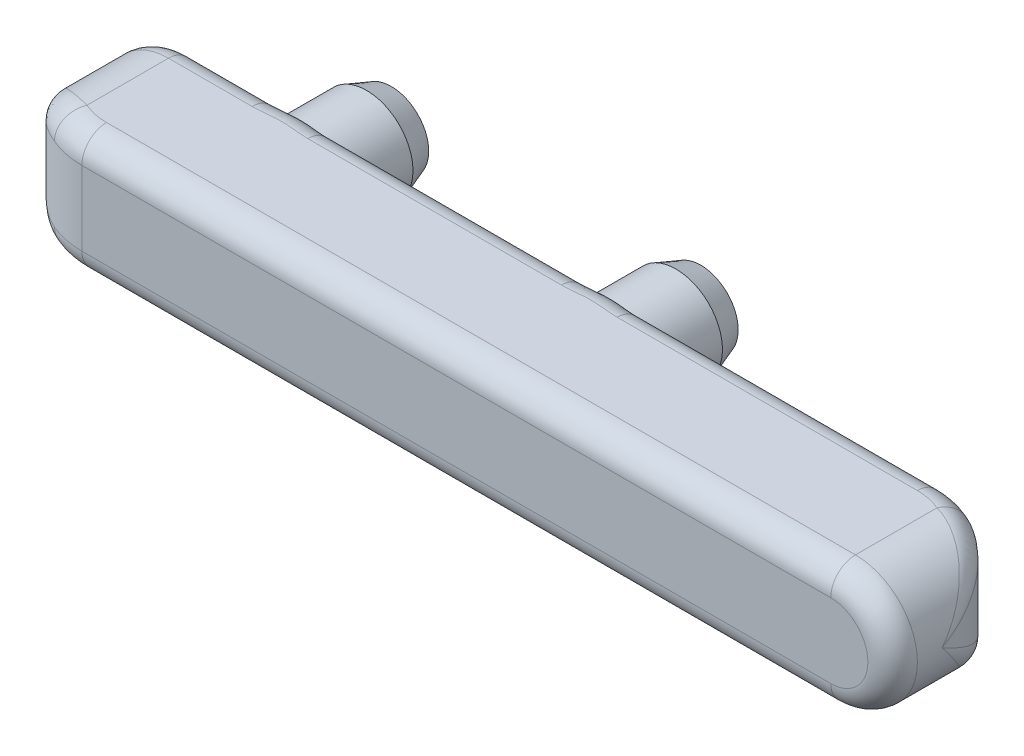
ISO-10303-21;
HEADER;
FILE_DESCRIPTION(('STEP AP214'),'2;1');
FILE_NAME('part.step','',(''),(''),'','','');
FILE_SCHEMA(('AUTOMOTIVE_DESIGN { 1 0 10303 214 1 1 1 1 }'));
ENDSEC;
DATA;
#1=APPLICATION_CONTEXT('core data for automotive mechanical design processes');
#2=APPLICATION_PROTOCOL_DEFINITION('international standard','automotive_design',2000,#1);
#3=PRODUCT_CONTEXT('',#1,'mechanical');
#4=PRODUCT('Part','Part','',(#3));
#5=PRODUCT_RELATED_PRODUCT_CATEGORY('part','',(#4));
#6=PRODUCT_DEFINITION_FORMATION('','',#4);
#7=PRODUCT_DEFINITION_CONTEXT('part definition',#1,'design');
#8=PRODUCT_DEFINITION('design','',#6,#7);
#9=PRODUCT_DEFINITION_SHAPE('','',#8);
#10=(LENGTH_UNIT() NAMED_UNIT(*) SI_UNIT(.MILLI.,.METRE.));
#11=(NAMED_UNIT(*) PLANE_ANGLE_UNIT() SI_UNIT($,.RADIAN.));
#12=(NAMED_UNIT(*) SI_UNIT($,.STERADIAN.) SOLID_ANGLE_UNIT());
#13=UNCERTAINTY_MEASURE_WITH_UNIT(LENGTH_MEASURE(1.E-05),#10,'distance_accuracy_value','');
#14=(GEOMETRIC_REPRESENTATION_CONTEXT(3) GLOBAL_UNCERTAINTY_ASSIGNED_CONTEXT((#13)) GLOBAL_UNIT_ASSIGNED_CONTEXT((#10,
#11,#12)) REPRESENTATION_CONTEXT('',''));
#15=CARTESIAN_POINT('',(0.,0.,0.));
#16=DIRECTION('',(0.,0.,1.));
#17=DIRECTION('',(1.,0.,0.));
#18=AXIS2_PLACEMENT_3D('',#15,#16,#17);
#19=CARTESIAN_POINT('',(0.,0.,0.));
#20=DIRECTION('',(0.,0.,1.));
#21=DIRECTION('',(1.,0.,0.));
#22=AXIS2_PLACEMENT_3D('',#19,#20,#21);
#23=PLANE('',#22);
#24=CARTESIAN_POINT('',(4.5,0.,0.));
#25=DIRECTION('',(0.,0.,1.));
#26=DIRECTION('',(1.,0.,0.));
#27=AXIS2_PLACEMENT_3D('',#24,#25,#26);
#28=CIRCLE('',#27,1.875);
#29=CARTESIAN_POINT('',(5.625,1.5,0.));
#30=VERTEX_POINT('',#29);
#31=CARTESIAN_POINT('',(5.625,-1.5,0.));
#32=VERTEX_POINT('',#31);
#33=EDGE_CURVE('E640',#30,#32,#28,.F.);
#34=ORIENTED_EDGE('',*,*,#33,.F.);
#35=DIRECTION('',(-1.,0.,0.));
#36=VECTOR('',#35,1.);
#37=CARTESIAN_POINT('',(0.,1.5,0.));
#38=LINE('',#37,#36);
#39=CARTESIAN_POINT('',(15.875,1.5,0.));
#40=VERTEX_POINT('',#39);
#41=EDGE_CURVE('E217',#30,#40,#38,.F.);
#42=ORIENTED_EDGE('',*,*,#41,.T.);
#43=CARTESIAN_POINT('',(17.,0.,0.));
#44=DIRECTION('',(0.,0.,1.));
#45=DIRECTION('',(1.,0.,0.));
#46=AXIS2_PLACEMENT_3D('',#43,#44,#45);
#47=CIRCLE('',#46,1.875);
#48=CARTESIAN_POINT('',(15.875,-1.5,0.));
#49=VERTEX_POINT('',#48);
#50=EDGE_CURVE('E636',#49,#40,#47,.F.);
#51=ORIENTED_EDGE('',*,*,#50,.F.);
#52=DIRECTION('',(1.,0.,0.));
#53=VECTOR('',#52,1.);
#54=CARTESIAN_POINT('',(0.,-1.5,0.));
#55=LINE('',#54,#53);
#56=EDGE_CURVE('E518',#49,#32,#55,.F.);
#57=ORIENTED_EDGE('',*,*,#56,.T.);
#58=EDGE_LOOP('',(#34,#42,#51,#57));
#59=FACE_BOUND('',#58,.T.);
#60=ADVANCED_FACE('F37',(#59),#23,.F.);
#61=CARTESIAN_POINT('',(18.125,1.5,0.));
#62=VERTEX_POINT('',#61);
#63=CARTESIAN_POINT('',(18.125,-1.5,0.));
#64=VERTEX_POINT('',#63);
#65=EDGE_CURVE('E530',#62,#64,#47,.F.);
#66=ORIENTED_EDGE('',*,*,#65,.F.);
#67=DIRECTION('',(-1.,0.,0.));
#68=VECTOR('',#67,1.);
#69=CARTESIAN_POINT('',(0.,1.5,0.));
#70=LINE('',#69,#68);
#71=CARTESIAN_POINT('',(30.25,1.5,0.));
#72=VERTEX_POINT('',#71);
#73=EDGE_CURVE('E219',#62,#72,#70,.F.);
#74=ORIENTED_EDGE('',*,*,#73,.T.);
#75=DIRECTION('',(0.,-1.,0.));
#76=VECTOR('',#75,1.);
#77=CARTESIAN_POINT('',(30.25,2.5,0.));
#78=LINE('',#77,#76);
#79=CARTESIAN_POINT('',(30.25,-1.5,0.));
#80=VERTEX_POINT('',#79);
#81=EDGE_CURVE('E527',#72,#80,#78,.T.);
#82=ORIENTED_EDGE('',*,*,#81,.T.);
#83=DIRECTION('',(1.,0.,0.));
#84=VECTOR('',#83,1.);
#85=CARTESIAN_POINT('',(0.,-1.5,0.));
#86=LINE('',#85,#84);
#87=EDGE_CURVE('E520',#80,#64,#86,.F.);
#88=ORIENTED_EDGE('',*,*,#87,.T.);
#89=EDGE_LOOP('',(#66,#74,#82,#88));
#90=FACE_BOUND('',#89,.T.);
#91=ADVANCED_FACE('F487',(#90),#23,.F.);
#92=CARTESIAN_POINT('',(0.,0.,0.));
#93=DIRECTION('',(0.,0.,1.));
#94=DIRECTION('',(1.,0.,0.));
#95=AXIS2_PLACEMENT_3D('',#92,#93,#94);
#96=CIRCLE('',#95,1.5);
#97=CARTESIAN_POINT('',(0.,-1.5,0.));
#98=VERTEX_POINT('',#97);
#99=CARTESIAN_POINT('',(0.,1.5,0.));
#100=VERTEX_POINT('',#99);
#101=EDGE_CURVE('E500',#98,#100,#96,.F.);
#102=ORIENTED_EDGE('',*,*,#101,.T.);
#103=DIRECTION('',(-1.,0.,0.));
#104=VECTOR('',#103,1.);
#105=CARTESIAN_POINT('',(0.,1.5,0.));
#106=LINE('',#105,#104);
#107=CARTESIAN_POINT('',(3.375,1.5,0.));
#108=VERTEX_POINT('',#107);
#109=EDGE_CURVE('E503',#100,#108,#106,.F.);
#110=ORIENTED_EDGE('',*,*,#109,.T.);
#111=CARTESIAN_POINT('',(3.375,-1.5,0.));
#112=VERTEX_POINT('',#111);
#113=EDGE_CURVE('E654',#112,#108,#28,.F.);
#114=ORIENTED_EDGE('',*,*,#113,.F.);
#115=DIRECTION('',(1.,0.,0.));
#116=VECTOR('',#115,1.);
#117=CARTESIAN_POINT('',(0.,-1.5,0.));
#118=LINE('',#117,#116);
#119=EDGE_CURVE('E506',#112,#98,#118,.F.);
#120=ORIENTED_EDGE('',*,*,#119,.T.);
#121=EDGE_LOOP('',(#102,#110,#114,#120));
#122=FACE_BOUND('',#121,.T.);
#123=ADVANCED_FACE('F240',(#122),#23,.F.);
#124=CARTESIAN_POINT('',(0.,0.,5.5));
#125=DIRECTION('',(0.,0.,-1.));
#126=DIRECTION('',(-1.,0.,0.));
#127=AXIS2_PLACEMENT_3D('',#124,#125,#126);
#128=CYLINDRICAL_SURFACE('',#127,2.5);
#129=DIRECTION('',(0.,0.,-1.));
#130=VECTOR('',#129,1.);
#131=CARTESIAN_POINT('',(0.,2.5,5.5));
#132=LINE('',#131,#130);
#133=CARTESIAN_POINT('',(0.,2.5,4.29128784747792));
#134=VERTEX_POINT('',#133);
#135=CARTESIAN_POINT('',(0.,2.5,1.));
#136=VERTEX_POINT('',#135);
#137=EDGE_CURVE('E540',#134,#136,#132,.T.);
#138=ORIENTED_EDGE('',*,*,#137,.T.);
#139=CARTESIAN_POINT('',(0.,0.,1.));
#140=DIRECTION('',(0.,0.,1.));
#141=DIRECTION('',(1.,0.,0.));
#142=AXIS2_PLACEMENT_3D('',#139,#140,#141);
#143=CIRCLE('',#142,2.5);
#144=CARTESIAN_POINT('',(0.,-2.5,1.));
#145=VERTEX_POINT('',#144);
#146=EDGE_CURVE('E212',#136,#145,#143,.T.);
#147=ORIENTED_EDGE('',*,*,#146,.T.);
#148=DIRECTION('',(0.,0.,-1.));
#149=VECTOR('',#148,1.);
#150=CARTESIAN_POINT('',(0.,-2.5,5.5));
#151=LINE('',#150,#149);
#152=CARTESIAN_POINT('',(0.,-2.5,4.29128784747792));
#153=VERTEX_POINT('',#152);
#154=EDGE_CURVE('E211',#153,#145,#151,.T.);
#155=ORIENTED_EDGE('',*,*,#154,.F.);
#156=CARTESIAN_POINT('',(0.198337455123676,-1.43782579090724,5.40695423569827));
#157=CARTESIAN_POINT('',(0.487161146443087,-2.46329923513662,5.4749149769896));
#158=CARTESIAN_POINT('',(0.712306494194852,-2.39637631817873,4.43353873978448));
#159=CARTESIAN_POINT('',(0.148285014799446,-1.44845679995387,5.39518374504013));
#160=CARTESIAN_POINT('',(0.410578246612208,-2.4799949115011,5.4613900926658));
#161=CARTESIAN_POINT('',(0.652720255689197,-2.41409466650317,4.42513124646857));
#162=CARTESIAN_POINT('',(0.0979679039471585,-1.45768402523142,5.38217220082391));
#163=CARTESIAN_POINT('',(0.33373791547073,-2.4931009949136,5.44545742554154));
#164=CARTESIAN_POINT('',(0.592818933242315,-2.42947337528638,4.41583728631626));
#165=CARTESIAN_POINT('',(-0.00277046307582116,-1.4733795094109,5.35368165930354));
#166=CARTESIAN_POINT('',(0.180763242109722,-2.51228032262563,5.40895707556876));
#167=CARTESIAN_POINT('',(0.472892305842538,-2.4556325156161,4.39548689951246));
#168=CARTESIAN_POINT('',(-0.0531916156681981,-1.4798497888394,5.33820448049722));
#169=CARTESIAN_POINT('',(0.10479227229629,-2.51836355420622,5.38844945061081));
#170=CARTESIAN_POINT('',(0.412867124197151,-2.46641631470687,4.384431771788));
#171=CARTESIAN_POINT('',(-0.203306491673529,-1.49513891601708,5.28832661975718));
#172=CARTESIAN_POINT('',(-0.11835453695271,-2.52641901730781,5.32096021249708));
#173=CARTESIAN_POINT('',(0.234158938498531,-2.49189819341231,4.34880472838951));
#174=CARTESIAN_POINT('',(-0.302638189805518,-1.49999853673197,5.25029700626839));
#175=CARTESIAN_POINT('',(-0.262415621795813,-2.5187068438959,5.26784557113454));
#176=CARTESIAN_POINT('',(0.115906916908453,-2.49999756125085,4.32164071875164));
#177=CARTESIAN_POINT('',(-0.523421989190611,-1.50000185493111,5.15393487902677));
#178=CARTESIAN_POINT('',(-0.570786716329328,-2.4767787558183,5.13327071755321));
#179=CARTESIAN_POINT('',(-0.146930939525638,-2.50000309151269,4.25281062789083));
#180=CARTESIAN_POINT('',(-0.643678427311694,-1.49219679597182,5.09289260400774));
#181=CARTESIAN_POINT('',(-0.730103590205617,-2.43683419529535,5.04872635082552));
#182=CARTESIAN_POINT('',(-0.290093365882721,-2.48699465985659,4.2092090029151));
#183=CARTESIAN_POINT('',(-0.874329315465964,-1.46364015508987,4.95885277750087));
#184=CARTESIAN_POINT('',(-1.01881899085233,-2.33520611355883,4.86896577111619));
#185=CARTESIAN_POINT('',(-0.56467775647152,-2.43940025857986,4.11346626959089));
#186=CARTESIAN_POINT('',(-0.98469080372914,-1.44284701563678,4.88581740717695));
#187=CARTESIAN_POINT('',(-1.14821340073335,-2.27438283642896,4.77453186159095));
#188=CARTESIAN_POINT('',(-0.696060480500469,-2.40474502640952,4.06129814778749));
#189=CARTESIAN_POINT('',(-1.22013984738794,-1.38443001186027,4.71065455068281));
#190=CARTESIAN_POINT('',(-1.40786160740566,-2.12519242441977,4.55846426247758));
#191=CARTESIAN_POINT('',(-0.976356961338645,-2.30738335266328,3.93618182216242));
#192=CARTESIAN_POINT('',(-1.34178695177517,-1.34386349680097,4.60586150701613));
#193=CARTESIAN_POINT('',(-1.53243698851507,-2.03382274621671,4.43542157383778));
#194=CARTESIAN_POINT('',(-1.12117494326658,-2.23977249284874,3.86132964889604));
#195=CARTESIAN_POINT('',(-1.56545932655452,-1.25121752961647,4.38602533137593));
#196=CARTESIAN_POINT('',(-1.74807263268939,-1.84487255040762,4.19018732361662));
#197=CARTESIAN_POINT('',(-1.38745157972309,-2.08536254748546,3.70430380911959));
#198=CARTESIAN_POINT('',(-1.66745867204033,-1.19912305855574,4.2709689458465));
#199=CARTESIAN_POINT('',(-1.84057349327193,-1.74733856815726,4.06772830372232));
#200=CARTESIAN_POINT('',(-1.50887937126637,-1.99853843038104,3.62212067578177));
#201=CARTESIAN_POINT('',(-1.88949132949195,-1.06433952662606,3.98625141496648));
#202=CARTESIAN_POINT('',(-2.03161690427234,-1.51301030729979,3.77881153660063));
#203=CARTESIAN_POINT('',(-1.77320396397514,-1.77389921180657,3.41875101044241));
#204=CARTESIAN_POINT('',(-2.00043325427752,-0.977745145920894,3.81314860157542));
#205=CARTESIAN_POINT('',(-2.12228021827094,-1.37302943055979,3.61020324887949));
#206=CARTESIAN_POINT('',(-1.90527768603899,-1.62957524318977,3.29510614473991));
#207=CARTESIAN_POINT('',(-2.18791832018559,-0.794932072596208,3.45859482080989));
#208=CARTESIAN_POINT('',(-2.26919320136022,-1.09442346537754,3.27830761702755));
#209=CARTESIAN_POINT('',(-2.12847419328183,-1.32488678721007,3.04185344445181));
#210=CARTESIAN_POINT('',(-2.26440964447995,-0.698699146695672,3.27713172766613));
#211=CARTESIAN_POINT('',(-2.32737815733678,-0.954245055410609,3.11304709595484));
#212=CARTESIAN_POINT('',(-2.2195352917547,-1.1644985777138,2.9122369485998));
#213=CARTESIAN_POINT('',(-2.38329332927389,-0.504020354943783,2.91560310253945));
#214=CARTESIAN_POINT('',(-2.41546619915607,-0.680357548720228,2.79186041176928));
#215=CARTESIAN_POINT('',(-2.36106348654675,-0.840033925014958,2.65400221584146));
#216=CARTESIAN_POINT('',(-2.42671666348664,-0.405749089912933,2.73568509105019));
#217=CARTESIAN_POINT('',(-2.44722647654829,-0.545192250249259,2.63413392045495));
#218=CARTESIAN_POINT('',(-2.41275793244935,-0.676248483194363,2.52548935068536));
#219=CARTESIAN_POINT('',(-2.48474406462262,-0.206994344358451,2.37413961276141));
#220=CARTESIAN_POINT('',(-2.4890287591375,-0.276759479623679,2.32157135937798));
#221=CARTESIAN_POINT('',(-2.48183817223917,-0.344990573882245,2.26724258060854));
#222=CARTESIAN_POINT('',(-2.49940911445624,-0.106516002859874,2.19251658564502));
#223=CARTESIAN_POINT('',(-2.49957703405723,-0.142036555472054,2.16503168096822));
#224=CARTESIAN_POINT('',(-2.49929656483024,-0.177526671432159,2.13751184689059));
#225=CARTESIAN_POINT('',(-2.49999415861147,-0.00408244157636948,2.0073785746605));
#226=CARTESIAN_POINT('',(-2.49999584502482,-0.00544326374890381,2.00632450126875));
#227=CARTESIAN_POINT('',(-2.499993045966,-0.00680406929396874,2.00527041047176));
#228=CARTESIAN_POINT('',(-2.49999999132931,-0.00204119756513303,2.00368924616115));
#229=CARTESIAN_POINT('',(-2.50000001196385,-0.00272159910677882,2.00316221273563));
#230=CARTESIAN_POINT('',(-2.49999998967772,-0.00340199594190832,2.00263517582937));
#231=CARTESIAN_POINT('',(-2.5,0.,2.));
#232=CARTESIAN_POINT('',(-2.5,0.,2.));
#233=CARTESIAN_POINT('',(-2.5,0.,2.));
#234=(BOUNDED_SURFACE() B_SPLINE_SURFACE(3,2,((#156,#157,#158),(#159,#160,#161),(#162,#163,
#164),(#165,#166,#167),(#168,#169,#170),(#171,#172,#173),(#174,#175,#176),(#177,#178,#179),
(#180,#181,#182),(#183,#184,#185),(#186,#187,#188),(#189,#190,#191),(#192,#193,#194),(#195,#196,
#197),(#198,#199,#200),(#201,#202,#203),(#204,#205,#206),(#207,#208,#209),(#210,#211,#212),
(#213,#214,#215),(#216,#217,#218),(#219,#220,#221),(#222,#223,#224),(#225,#226,#227),(#228,#229,
#230),(#231,#232,#233)),.UNSPECIFIED.,.F.,.F.,.F.) B_SPLINE_SURFACE_WITH_KNOTS((4,2,2,2,2,2,2,2,
2,2,2,2,4),(3,3),(0.,0.114633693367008,0.22918322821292,0.456508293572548,0.74467992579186,
1.03377836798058,1.39673130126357,1.76015991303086,2.26887462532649,2.77835195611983,
3.27120913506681,3.76302005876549,3.77302006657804),(0.,1.),
.UNSPECIFIED.) GEOMETRIC_REPRESENTATION_ITEM() RATIONAL_B_SPLINE_SURFACE(((1.,0.683644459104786,
1.),(1.,0.684146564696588,1.),(1.,0.6850336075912,1.),(1.,0.687555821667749,1.),(1.,
0.689190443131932,1.),(1.,0.695154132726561,1.),(1.,0.700551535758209,1.),(1.,0.715416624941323,
1.),(1.,0.7255870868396,1.),(1.,0.748127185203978,1.),(1.,0.760503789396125,1.),(1.,
0.789271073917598,1.),(1.,0.805879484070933,1.),(1.,0.838338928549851,1.),(1.,0.854188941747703,
1.),(1.,0.889981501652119,1.),(1.,0.909027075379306,1.),(1.,0.942030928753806,1.),(1.,
0.955981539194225,1.),(1.,0.977933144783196,1.),(1.,0.986113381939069,1.),(1.,0.99708473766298,
1.),(1.,0.999887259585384,1.),(1.,0.999998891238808,1.),(1.,1.00000000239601,1.),(1.,1.,1.))) REPRESENTATION_ITEM('') SURFACE());
#235=CARTESIAN_POINT('',(0.712306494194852,-2.39637631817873,4.43353873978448));
#236=CARTESIAN_POINT('',(0.652720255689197,-2.41409466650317,4.42513124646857));
#237=CARTESIAN_POINT('',(0.592818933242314,-2.42947337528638,4.41583728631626));
#238=CARTESIAN_POINT('',(0.472892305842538,-2.4556325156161,4.39548689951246));
#239=CARTESIAN_POINT('',(0.412867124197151,-2.46641631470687,4.384431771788));
#240=CARTESIAN_POINT('',(0.234158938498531,-2.49189819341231,4.34880472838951));
#241=CARTESIAN_POINT('',(0.115906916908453,-2.49999756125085,4.32164071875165));
#242=CARTESIAN_POINT('',(-0.146930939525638,-2.50000309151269,4.25281062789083));
#243=CARTESIAN_POINT('',(-0.290093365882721,-2.48699465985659,4.2092090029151));
#244=CARTESIAN_POINT('',(-0.564677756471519,-2.43940025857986,4.11346626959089));
#245=CARTESIAN_POINT('',(-0.696060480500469,-2.40474502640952,4.06129814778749));
#246=CARTESIAN_POINT('',(-0.976356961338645,-2.30738335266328,3.93618182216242));
#247=CARTESIAN_POINT('',(-1.12117494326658,-2.23977249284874,3.86132964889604));
#248=CARTESIAN_POINT('',(-1.38745157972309,-2.08536254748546,3.70430380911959));
#249=CARTESIAN_POINT('',(-1.50887937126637,-1.99853843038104,3.62212067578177));
#250=CARTESIAN_POINT('',(-1.77320396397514,-1.77389921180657,3.41875101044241));
#251=CARTESIAN_POINT('',(-1.90527768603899,-1.62957524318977,3.29510614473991));
#252=CARTESIAN_POINT('',(-2.12847419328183,-1.32488678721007,3.04185344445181));
#253=CARTESIAN_POINT('',(-2.2195352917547,-1.1644985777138,2.9122369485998));
#254=CARTESIAN_POINT('',(-2.36106348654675,-0.840033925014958,2.65400221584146));
#255=CARTESIAN_POINT('',(-2.41275793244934,-0.676248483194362,2.52548935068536));
#256=CARTESIAN_POINT('',(-2.48183817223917,-0.344990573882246,2.26724258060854));
#257=CARTESIAN_POINT('',(-2.49929656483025,-0.177526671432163,2.13751184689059));
#258=CARTESIAN_POINT('',(-2.499993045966,-0.00680406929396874,2.00527041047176));
#259=CARTESIAN_POINT('',(-2.49999998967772,-0.00340199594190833,2.00263517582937));
#260=CARTESIAN_POINT('',(-2.5,0.,2.));
#261=B_SPLINE_CURVE_WITH_KNOTS('',3,(#235,#236,#237,#238,#239,#240,#241,#242,#243,#244,#245,
#246,#247,#248,#249,#250,#251,#252,#253,#254,#255,#256,#257,#258,#259,#260),.UNSPECIFIED.,.F.,
.F.,(4,2,2,2,2,2,2,2,2,2,2,2,4),(0.,0.114633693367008,0.22918322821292,0.456508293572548,
0.74467992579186,1.03377836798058,1.39673130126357,1.76015991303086,2.26887462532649,
2.77835195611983,3.27120913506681,3.76302005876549,3.77302006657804),.UNSPECIFIED.);
#262=CARTESIAN_POINT('',(-2.5,0.,2.));
#263=VERTEX_POINT('',#262);
#264=EDGE_CURVE('E186',#153,#263,#261,.T.);
#265=ORIENTED_EDGE('',*,*,#264,.T.);
#266=CARTESIAN_POINT('',(0.712306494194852,2.39637631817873,4.43353873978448));
#267=CARTESIAN_POINT('',(0.487161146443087,2.46329923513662,5.4749149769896));
#268=CARTESIAN_POINT('',(0.198337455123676,1.43782579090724,5.40695423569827));
#269=CARTESIAN_POINT('',(0.652720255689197,2.41409466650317,4.42513124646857));
#270=CARTESIAN_POINT('',(0.410578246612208,2.4799949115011,5.4613900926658));
#271=CARTESIAN_POINT('',(0.148285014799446,1.44845679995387,5.39518374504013));
#272=CARTESIAN_POINT('',(0.592818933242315,2.42947337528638,4.41583728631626));
#273=CARTESIAN_POINT('',(0.33373791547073,2.4931009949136,5.44545742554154));
#274=CARTESIAN_POINT('',(0.0979679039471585,1.45768402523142,5.38217220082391));
#275=CARTESIAN_POINT('',(0.472892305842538,2.4556325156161,4.39548689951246));
#276=CARTESIAN_POINT('',(0.180763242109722,2.51228032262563,5.40895707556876));
#277=CARTESIAN_POINT('',(-0.00277046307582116,1.4733795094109,5.35368165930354));
#278=CARTESIAN_POINT('',(0.412867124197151,2.46641631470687,4.384431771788));
#279=CARTESIAN_POINT('',(0.10479227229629,2.51836355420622,5.38844945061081));
#280=CARTESIAN_POINT('',(-0.0531916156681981,1.4798497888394,5.33820448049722));
#281=CARTESIAN_POINT('',(0.234158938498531,2.49189819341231,4.34880472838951));
#282=CARTESIAN_POINT('',(-0.11835453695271,2.52641901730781,5.32096021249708));
#283=CARTESIAN_POINT('',(-0.203306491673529,1.49513891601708,5.28832661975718));
#284=CARTESIAN_POINT('',(0.115906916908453,2.49999756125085,4.32164071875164));
#285=CARTESIAN_POINT('',(-0.262415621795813,2.5187068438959,5.26784557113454));
#286=CARTESIAN_POINT('',(-0.302638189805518,1.49999853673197,5.25029700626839));
#287=CARTESIAN_POINT('',(-0.146930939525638,2.50000309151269,4.25281062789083));
#288=CARTESIAN_POINT('',(-0.570786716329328,2.4767787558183,5.13327071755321));
#289=CARTESIAN_POINT('',(-0.523421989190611,1.50000185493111,5.15393487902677));
#290=CARTESIAN_POINT('',(-0.290093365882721,2.48699465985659,4.2092090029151));
#291=CARTESIAN_POINT('',(-0.730103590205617,2.43683419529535,5.04872635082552));
#292=CARTESIAN_POINT('',(-0.643678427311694,1.49219679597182,5.09289260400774));
#293=CARTESIAN_POINT('',(-0.56467775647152,2.43940025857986,4.11346626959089));
#294=CARTESIAN_POINT('',(-1.01881899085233,2.33520611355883,4.86896577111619));
#295=CARTESIAN_POINT('',(-0.874329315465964,1.46364015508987,4.95885277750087));
#296=CARTESIAN_POINT('',(-0.696060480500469,2.40474502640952,4.06129814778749));
#297=CARTESIAN_POINT('',(-1.14821340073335,2.27438283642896,4.77453186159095));
#298=CARTESIAN_POINT('',(-0.98469080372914,1.44284701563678,4.88581740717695));
#299=CARTESIAN_POINT('',(-0.976356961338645,2.30738335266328,3.93618182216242));
#300=CARTESIAN_POINT('',(-1.40786160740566,2.12519242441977,4.55846426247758));
#301=CARTESIAN_POINT('',(-1.22013984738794,1.38443001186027,4.71065455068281));
#302=CARTESIAN_POINT('',(-1.12117494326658,2.23977249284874,3.86132964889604));
#303=CARTESIAN_POINT('',(-1.53243698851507,2.03382274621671,4.43542157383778));
#304=CARTESIAN_POINT('',(-1.34178695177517,1.34386349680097,4.60586150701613));
#305=CARTESIAN_POINT('',(-1.38745157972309,2.08536254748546,3.70430380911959));
#306=CARTESIAN_POINT('',(-1.74807263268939,1.84487255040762,4.19018732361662));
#307=CARTESIAN_POINT('',(-1.56545932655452,1.25121752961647,4.38602533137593));
#308=CARTESIAN_POINT('',(-1.50887937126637,1.99853843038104,3.62212067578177));
#309=CARTESIAN_POINT('',(-1.84057349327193,1.74733856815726,4.06772830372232));
#310=CARTESIAN_POINT('',(-1.66745867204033,1.19912305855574,4.2709689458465));
#311=CARTESIAN_POINT('',(-1.77320396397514,1.77389921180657,3.41875101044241));
#312=CARTESIAN_POINT('',(-2.03161690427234,1.51301030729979,3.77881153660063));
#313=CARTESIAN_POINT('',(-1.88949132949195,1.06433952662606,3.98625141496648));
#314=CARTESIAN_POINT('',(-1.90527768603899,1.62957524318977,3.29510614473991));
#315=CARTESIAN_POINT('',(-2.12228021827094,1.37302943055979,3.61020324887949));
#316=CARTESIAN_POINT('',(-2.00043325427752,0.977745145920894,3.81314860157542));
#317=CARTESIAN_POINT('',(-2.12847419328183,1.32488678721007,3.04185344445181));
#318=CARTESIAN_POINT('',(-2.26919320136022,1.09442346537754,3.27830761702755));
#319=CARTESIAN_POINT('',(-2.18791832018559,0.794932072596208,3.45859482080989));
#320=CARTESIAN_POINT('',(-2.2195352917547,1.1644985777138,2.9122369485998));
#321=CARTESIAN_POINT('',(-2.32737815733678,0.954245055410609,3.11304709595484));
#322=CARTESIAN_POINT('',(-2.26440964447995,0.698699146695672,3.27713172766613));
#323=CARTESIAN_POINT('',(-2.36106348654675,0.840033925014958,2.65400221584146));
#324=CARTESIAN_POINT('',(-2.41546619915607,0.680357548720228,2.79186041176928));
#325=CARTESIAN_POINT('',(-2.38329332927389,0.504020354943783,2.91560310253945));
#326=CARTESIAN_POINT('',(-2.41275793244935,0.676248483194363,2.52548935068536));
#327=CARTESIAN_POINT('',(-2.44722647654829,0.545192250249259,2.63413392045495));
#328=CARTESIAN_POINT('',(-2.42671666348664,0.405749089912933,2.73568509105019));
#329=CARTESIAN_POINT('',(-2.48183817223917,0.344990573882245,2.26724258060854));
#330=CARTESIAN_POINT('',(-2.4890287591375,0.276759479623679,2.32157135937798));
#331=CARTESIAN_POINT('',(-2.48474406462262,0.206994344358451,2.37413961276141));
#332=CARTESIAN_POINT('',(-2.49929656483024,0.177526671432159,2.13751184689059));
#333=CARTESIAN_POINT('',(-2.49957703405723,0.142036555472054,2.16503168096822));
#334=CARTESIAN_POINT('',(-2.49940911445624,0.106516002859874,2.19251658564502));
#335=CARTESIAN_POINT('',(-2.499993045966,0.00680406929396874,2.00527041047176));
#336=CARTESIAN_POINT('',(-2.49999584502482,0.00544326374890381,2.00632450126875));
#337=CARTESIAN_POINT('',(-2.49999415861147,0.00408244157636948,2.0073785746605));
#338=CARTESIAN_POINT('',(-2.49999998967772,0.00340199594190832,2.00263517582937));
#339=CARTESIAN_POINT('',(-2.50000001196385,0.00272159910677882,2.00316221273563));
#340=CARTESIAN_POINT('',(-2.49999999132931,0.00204119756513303,2.00368924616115));
#341=CARTESIAN_POINT('',(-2.5,0.,2.));
#342=CARTESIAN_POINT('',(-2.5,0.,2.));
#343=CARTESIAN_POINT('',(-2.5,0.,2.));
#344=(BOUNDED_SURFACE() B_SPLINE_SURFACE(3,2,((#266,#267,#268),(#269,#270,#271),(#272,#273,
#274),(#275,#276,#277),(#278,#279,#280),(#281,#282,#283),(#284,#285,#286),(#287,#288,#289),
(#290,#291,#292),(#293,#294,#295),(#296,#297,#298),(#299,#300,#301),(#302,#303,#304),(#305,#306,
#307),(#308,#309,#310),(#311,#312,#313),(#314,#315,#316),(#317,#318,#319),(#320,#321,#322),
(#323,#324,#325),(#326,#327,#328),(#329,#330,#331),(#332,#333,#334),(#335,#336,#337),(#338,#339,
#340),(#341,#342,#343)),.UNSPECIFIED.,.F.,.F.,.F.) B_SPLINE_SURFACE_WITH_KNOTS((4,2,2,2,2,2,2,2,
2,2,2,2,4),(3,3),(0.,0.114633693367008,0.22918322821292,0.456508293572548,0.74467992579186,
1.03377836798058,1.39673130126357,1.76015991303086,2.26887462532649,2.77835195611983,
3.27120913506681,3.76302005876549,3.77302006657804),(0.,1.),
.UNSPECIFIED.) GEOMETRIC_REPRESENTATION_ITEM() RATIONAL_B_SPLINE_SURFACE(((1.,0.683644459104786,
1.),(1.,0.684146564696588,1.),(1.,0.6850336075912,1.),(1.,0.687555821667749,1.),(1.,
0.689190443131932,1.),(1.,0.695154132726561,1.),(1.,0.700551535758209,1.),(1.,0.715416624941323,
1.),(1.,0.7255870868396,1.),(1.,0.748127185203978,1.),(1.,0.760503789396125,1.),(1.,
0.789271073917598,1.),(1.,0.805879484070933,1.),(1.,0.838338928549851,1.),(1.,0.854188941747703,
1.),(1.,0.889981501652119,1.),(1.,0.909027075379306,1.),(1.,0.942030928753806,1.),(1.,
0.955981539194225,1.),(1.,0.977933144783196,1.),(1.,0.986113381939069,1.),(1.,0.99708473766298,
1.),(1.,0.999887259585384,1.),(1.,0.999998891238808,1.),(1.,1.00000000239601,1.),(1.,1.,1.))) REPRESENTATION_ITEM('') SURFACE());
#345=CARTESIAN_POINT('',(0.712306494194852,2.39637631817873,4.43353873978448));
#346=CARTESIAN_POINT('',(0.652720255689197,2.41409466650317,4.42513124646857));
#347=CARTESIAN_POINT('',(0.592818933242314,2.42947337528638,4.41583728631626));
#348=CARTESIAN_POINT('',(0.472892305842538,2.4556325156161,4.39548689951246));
#349=CARTESIAN_POINT('',(0.412867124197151,2.46641631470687,4.384431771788));
#350=CARTESIAN_POINT('',(0.234158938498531,2.49189819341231,4.34880472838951));
#351=CARTESIAN_POINT('',(0.115906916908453,2.49999756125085,4.32164071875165));
#352=CARTESIAN_POINT('',(-0.146930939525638,2.50000309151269,4.25281062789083));
#353=CARTESIAN_POINT('',(-0.290093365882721,2.48699465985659,4.2092090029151));
#354=CARTESIAN_POINT('',(-0.564677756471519,2.43940025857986,4.11346626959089));
#355=CARTESIAN_POINT('',(-0.696060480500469,2.40474502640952,4.06129814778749));
#356=CARTESIAN_POINT('',(-0.976356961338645,2.30738335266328,3.93618182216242));
#357=CARTESIAN_POINT('',(-1.12117494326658,2.23977249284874,3.86132964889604));
#358=CARTESIAN_POINT('',(-1.38745157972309,2.08536254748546,3.70430380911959));
#359=CARTESIAN_POINT('',(-1.50887937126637,1.99853843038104,3.62212067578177));
#360=CARTESIAN_POINT('',(-1.77320396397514,1.77389921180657,3.41875101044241));
#361=CARTESIAN_POINT('',(-1.90527768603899,1.62957524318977,3.29510614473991));
#362=CARTESIAN_POINT('',(-2.12847419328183,1.32488678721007,3.04185344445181));
#363=CARTESIAN_POINT('',(-2.2195352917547,1.1644985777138,2.9122369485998));
#364=CARTESIAN_POINT('',(-2.36106348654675,0.840033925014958,2.65400221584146));
#365=CARTESIAN_POINT('',(-2.41275793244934,0.676248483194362,2.52548935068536));
#366=CARTESIAN_POINT('',(-2.48183817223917,0.344990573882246,2.26724258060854));
#367=CARTESIAN_POINT('',(-2.49929656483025,0.177526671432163,2.13751184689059));
#368=CARTESIAN_POINT('',(-2.499993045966,0.00680406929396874,2.00527041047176));
#369=CARTESIAN_POINT('',(-2.49999998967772,0.00340199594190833,2.00263517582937));
#370=CARTESIAN_POINT('',(-2.5,0.,2.));
#371=B_SPLINE_CURVE_WITH_KNOTS('',3,(#345,#346,#347,#348,#349,#350,#351,#352,#353,#354,#355,
#356,#357,#358,#359,#360,#361,#362,#363,#364,#365,#366,#367,#368,#369,#370),.UNSPECIFIED.,.F.,
.F.,(4,2,2,2,2,2,2,2,2,2,2,2,4),(0.,0.114633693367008,0.22918322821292,0.456508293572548,
0.74467992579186,1.03377836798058,1.39673130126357,1.76015991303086,2.26887462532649,
2.77835195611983,3.27120913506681,3.76302005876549,3.77302006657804),.UNSPECIFIED.);
#372=EDGE_CURVE('E208',#263,#134,#371,.F.);
#373=ORIENTED_EDGE('',*,*,#372,.T.);
#374=EDGE_LOOP('',(#138,#147,#155,#265,#373));
#375=FACE_BOUND('',#374,.T.);
#376=ADVANCED_FACE('F207',(#375),#128,.T.);
#377=CARTESIAN_POINT('',(0.,-2.5,5.5));
#378=DIRECTION('',(0.,1.,0.));
#379=DIRECTION('',(0.,0.,1.));
#380=AXIS2_PLACEMENT_3D('',#377,#378,#379);
#381=PLANE('',#380);
#382=DIRECTION('',(1.,0.,0.));
#383=VECTOR('',#382,1.);
#384=CARTESIAN_POINT('',(0.,-2.5,1.));
#385=LINE('',#384,#383);
#386=CARTESIAN_POINT('',(18.125,-2.5,1.));
#387=VERTEX_POINT('',#386);
#388=CARTESIAN_POINT('',(30.25,-2.5,1.));
#389=VERTEX_POINT('',#388);
#390=EDGE_CURVE('E684',#387,#389,#385,.T.);
#391=ORIENTED_EDGE('',*,*,#390,.T.);
#392=CARTESIAN_POINT('',(30.25,-2.5,3.5));
#393=DIRECTION('',(0.,1.,0.));
#394=DIRECTION('',(0.,0.,1.));
#395=AXIS2_PLACEMENT_3D('',#392,#393,#394);
#396=CIRCLE('',#395,2.5);
#397=CARTESIAN_POINT('',(31.25,-2.5,1.20871215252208));
#398=VERTEX_POINT('',#397);
#399=EDGE_CURVE('E620',#389,#398,#396,.F.);
#400=ORIENTED_EDGE('',*,*,#399,.T.);
#401=DIRECTION('',(0.,0.,-1.));
#402=VECTOR('',#401,1.);
#403=CARTESIAN_POINT('',(31.25,-2.5,5.5));
#404=LINE('',#403,#402);
#405=CARTESIAN_POINT('',(31.25,-2.5,4.5));
#406=VERTEX_POINT('',#405);
#407=EDGE_CURVE('E637',#406,#398,#404,.T.);
#408=ORIENTED_EDGE('',*,*,#407,.F.);
#409=DIRECTION('',(1.,0.,0.));
#410=VECTOR('',#409,1.);
#411=CARTESIAN_POINT('',(1.,-2.5,4.5));
#412=LINE('',#411,#410);
#413=CARTESIAN_POINT('',(1.,-2.5,4.5));
#414=VERTEX_POINT('',#413);
#415=EDGE_CURVE('E674',#406,#414,#412,.F.);
#416=ORIENTED_EDGE('',*,*,#415,.T.);
#417=CARTESIAN_POINT('',(1.,-2.5,2.));
#418=DIRECTION('',(0.,1.,0.));
#419=DIRECTION('',(0.,0.,1.));
#420=AXIS2_PLACEMENT_3D('',#417,#418,#419);
#421=CIRCLE('',#420,2.5);
#422=EDGE_CURVE('E682',#414,#153,#421,.F.);
#423=ORIENTED_EDGE('',*,*,#422,.T.);
#424=ORIENTED_EDGE('',*,*,#154,.T.);
#425=DIRECTION('',(1.,0.,0.));
#426=VECTOR('',#425,1.);
#427=CARTESIAN_POINT('',(0.,-2.5,1.));
#428=LINE('',#427,#426);
#429=CARTESIAN_POINT('',(3.375,-2.5,1.));
#430=VERTEX_POINT('',#429);
#431=EDGE_CURVE('E702',#145,#430,#428,.T.);
#432=ORIENTED_EDGE('',*,*,#431,.T.);
#433=CARTESIAN_POINT('',(3.08583201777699,-1.23115958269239,0.));
#434=CARTESIAN_POINT('',(3.19937586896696,-2.5,-0.335459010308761));
#435=CARTESIAN_POINT('',(2.777029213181,-2.5,0.912340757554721));
#436=CARTESIAN_POINT('',(3.10189113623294,-1.24958838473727,0.));
#437=CARTESIAN_POINT('',(3.19399036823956,-2.5,-0.309931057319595));
#438=CARTESIAN_POINT('',(2.82241931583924,-2.5,0.927710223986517));
#439=CARTESIAN_POINT('',(3.1192975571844,-1.26887052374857,0.));
#440=CARTESIAN_POINT('',(3.19350069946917,-2.5,-0.282701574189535));
#441=CARTESIAN_POINT('',(2.86854136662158,-2.5,0.940740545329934));
#442=CARTESIAN_POINT('',(3.15711562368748,-1.30883675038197,0.));
#443=CARTESIAN_POINT('',(3.20223048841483,-2.5,-0.227442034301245));
#444=CARTESIAN_POINT('',(2.96168040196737,-2.5,0.962567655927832));
#445=CARTESIAN_POINT('',(3.17752072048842,-1.32951773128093,0.));
#446=CARTESIAN_POINT('',(3.21118613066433,-2.5,-0.199459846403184));
#447=CARTESIAN_POINT('',(3.00869524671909,-2.5,0.971373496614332));
#448=CARTESIAN_POINT('',(3.22133809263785,-1.3716977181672,0.));
#449=CARTESIAN_POINT('',(3.23787324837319,-2.5,-0.144839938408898));
#450=CARTESIAN_POINT('',(3.10244841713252,-2.5,0.985140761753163));
#451=CARTESIAN_POINT('',(3.2446934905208,-1.39317689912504,0.));
#452=CARTESIAN_POINT('',(3.25523183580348,-2.5,-0.118189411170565));
#453=CARTESIAN_POINT('',(3.14917790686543,-2.5,0.990164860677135));
#454=CARTESIAN_POINT('',(3.29503011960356,-1.43693618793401,0.));
#455=CARTESIAN_POINT('',(3.29769364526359,-2.5,-0.0669013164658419));
#456=CARTESIAN_POINT('',(3.24285946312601,-2.5,0.997126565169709));
#457=CARTESIAN_POINT('',(3.3220116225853,-1.45921635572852,0.));
#458=CARTESIAN_POINT('',(3.32261639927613,-2.5,-0.0422170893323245));
#459=CARTESIAN_POINT('',(3.28981154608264,-2.5,0.999063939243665));
#460=CARTESIAN_POINT('',(3.38192335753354,-1.50567683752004,0.));
#461=CARTESIAN_POINT('',(3.38111072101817,-2.5,0.00592300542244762));
#462=CARTESIAN_POINT('',(3.38693772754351,-2.5,1.00044407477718));
#463=CARTESIAN_POINT('',(3.41513345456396,-1.52988328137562,0.));
#464=CARTESIAN_POINT('',(3.41503922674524,-2.5,0.0293052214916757));
#465=CARTESIAN_POINT('',(3.43711365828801,-2.5,0.999708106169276));
#466=CARTESIAN_POINT('',(3.48648879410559,-1.57805989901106,0.));
#467=CARTESIAN_POINT('',(3.48946453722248,-2.5,0.0724005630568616));
#468=CARTESIAN_POINT('',(3.53738816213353,-2.5,0.996046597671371));
#469=CARTESIAN_POINT('',(3.52463537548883,-1.60203000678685,0.));
#470=CARTESIAN_POINT('',(3.52985384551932,-2.5,0.0922165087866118));
#471=CARTESIAN_POINT('',(3.58748671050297,-2.5,0.993120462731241));
#472=CARTESIAN_POINT('',(3.6062202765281,-1.64893898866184,0.));
#473=CARTESIAN_POINT('',(3.61619014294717,-2.5,0.128049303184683));
#474=CARTESIAN_POINT('',(3.68766354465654,-2.5,0.98581704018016));
#475=CARTESIAN_POINT('',(3.64966822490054,-1.67187587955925,0.));
#476=CARTESIAN_POINT('',(3.66210498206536,-2.5,0.144166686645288));
#477=CARTESIAN_POINT('',(3.73774162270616,-2.5,0.981437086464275));
#478=CARTESIAN_POINT('',(3.74189237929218,-1.71566345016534,0.));
#479=CARTESIAN_POINT('',(3.75843989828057,-2.5,0.17265064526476));
#480=CARTESIAN_POINT('',(3.83782674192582,-2.5,0.97200971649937));
#481=CARTESIAN_POINT('',(3.79066810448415,-1.73651431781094,0.));
#482=CARTESIAN_POINT('',(3.80888495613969,-2.5,0.185116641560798));
#483=CARTESIAN_POINT('',(3.88783378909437,-2.5,0.966962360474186));
#484=CARTESIAN_POINT('',(3.89351597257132,-1.77505633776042,0.));
#485=CARTESIAN_POINT('',(3.91354056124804,-2.5,0.206597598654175));
#486=CARTESIAN_POINT('',(3.98804024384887,-2.5,0.956979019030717));
#487=CARTESIAN_POINT('',(3.94760642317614,-1.79273593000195,0.));
#488=CARTESIAN_POINT('',(3.96786420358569,-2.5,0.21568498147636));
#489=CARTESIAN_POINT('',(4.03823970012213,-2.5,0.952043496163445));
#490=CARTESIAN_POINT('',(4.0602553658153,-1.82363818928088,0.));
#491=CARTESIAN_POINT('',(4.07917731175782,-2.5,0.23068562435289));
#492=CARTESIAN_POINT('',(4.13872193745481,-2.5,0.943078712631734));
#493=CARTESIAN_POINT('',(4.11881367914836,-1.83686103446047,0.));
#494=CARTESIAN_POINT('',(4.13633449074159,-2.5,0.236662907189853));
#495=CARTESIAN_POINT('',(4.189004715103,-2.5,0.939049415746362));
#496=CARTESIAN_POINT('',(4.23904506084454,-1.85775053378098,0.));
#497=CARTESIAN_POINT('',(4.25219585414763,-2.5,0.245762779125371));
#498=CARTESIAN_POINT('',(4.28958085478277,-2.5,0.932564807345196));
#499=CARTESIAN_POINT('',(4.30071194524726,-1.86542778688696,0.));
#500=CARTESIAN_POINT('',(4.31112374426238,-2.5,0.248931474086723));
#501=CARTESIAN_POINT('',(4.33987401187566,-2.5,0.930106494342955));
#502=CARTESIAN_POINT('',(4.42551009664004,-1.87456494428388,0.));
#503=CARTESIAN_POINT('',(4.42953050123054,-2.5,0.252658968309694));
#504=CARTESIAN_POINT('',(4.44051757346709,-2.5,0.927170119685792));
#505=CARTESIAN_POINT('',(4.48864125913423,-1.87602529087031,0.));
#506=CARTESIAN_POINT('',(4.48927610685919,-2.5,0.253235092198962));
#507=CARTESIAN_POINT('',(4.49086797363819,-2.5,0.926691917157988));
#508=CARTESIAN_POINT('',(4.63428327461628,-1.8720106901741,0.));
#509=CARTESIAN_POINT('',(4.62707166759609,-2.5,0.25162377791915));
#510=CARTESIAN_POINT('',(4.60752192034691,-2.5,0.927993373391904));
#511=CARTESIAN_POINT('',(4.71658607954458,-1.86418768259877,0.));
#512=CARTESIAN_POINT('',(4.70543156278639,-2.5,0.248486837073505));
#513=CARTESIAN_POINT('',(4.67381721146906,-2.5,0.930537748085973));
#514=CARTESIAN_POINT('',(4.87598869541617,-1.83869702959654,0.));
#515=CARTESIAN_POINT('',(4.858614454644,-2.5,0.237504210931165));
#516=CARTESIAN_POINT('',(4.80627452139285,-2.5,0.938499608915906));
#517=CARTESIAN_POINT('',(4.95308385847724,-1.82102071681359,0.));
#518=CARTESIAN_POINT('',(4.93397292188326,-2.5,0.229568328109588));
#519=CARTESIAN_POINT('',(4.87243637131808,-2.5,0.943919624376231));
#520=CARTESIAN_POINT('',(5.09926912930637,-1.77829216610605,0.));
#521=CARTESIAN_POINT('',(5.07917270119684,-2.5,0.208339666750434));
#522=CARTESIAN_POINT('',(5.00469186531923,-2.5,0.956112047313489));
#523=CARTESIAN_POINT('',(5.16835096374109,-1.75323239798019,0.));
#524=CARTESIAN_POINT('',(5.14936243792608,-2.5,0.19488623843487));
#525=CARTESIAN_POINT('',(5.0707853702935,-2.5,0.962885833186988));
#526=CARTESIAN_POINT('',(5.29725963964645,-1.69850420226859,0.));
#527=CARTESIAN_POINT('',(5.28239204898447,-2.5,0.161983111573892));
#528=CARTESIAN_POINT('',(5.2030174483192,-2.5,0.975965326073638));
#529=CARTESIAN_POINT('',(5.35708718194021,-1.66883612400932,0.));
#530=CARTESIAN_POINT('',(5.34537254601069,-2.5,0.142320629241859));
#531=CARTESIAN_POINT('',(5.26915601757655,-2.5,0.982271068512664));
#532=CARTESIAN_POINT('',(5.46780400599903,-1.60717857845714,0.));
#533=CARTESIAN_POINT('',(5.46245876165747,-2.5,0.0965560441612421));
#534=CARTESIAN_POINT('',(5.40198220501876,-2.5,0.992615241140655));
#535=CARTESIAN_POINT('',(5.51864471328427,-1.57517774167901,0.));
#536=CARTESIAN_POINT('',(5.51643224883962,-2.5,0.0701744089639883));
#537=CARTESIAN_POINT('',(5.46867088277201,-2.5,0.996641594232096));
#538=CARTESIAN_POINT('',(5.61161257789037,-1.51100175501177,0.));
#539=CARTESIAN_POINT('',(5.6128507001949,-2.5,0.0114281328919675));
#540=CARTESIAN_POINT('',(5.60210040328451,-2.5,1.00061515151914));
#541=CARTESIAN_POINT('',(5.65375236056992,-1.47882692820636,0.));
#542=CARTESIAN_POINT('',(5.65503385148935,-2.5,-0.021169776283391));
#543=CARTESIAN_POINT('',(5.66884102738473,-2.5,1.00056830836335));
#544=CARTESIAN_POINT('',(5.7308126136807,-1.41536562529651,0.));
#545=CARTESIAN_POINT('',(5.72584768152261,-2.5,-0.0914628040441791));
#546=CARTESIAN_POINT('',(5.80290015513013,-2.5,0.994727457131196));
#547=CARTESIAN_POINT('',(5.76564558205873,-1.38409340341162,0.));
#548=CARTESIAN_POINT('',(5.75382419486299,-2.5,-0.129378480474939));
#549=CARTESIAN_POINT('',(5.87021660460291,-2.5,0.988868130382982));
#550=CARTESIAN_POINT('',(5.82870757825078,-1.32364202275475,0.));
#551=CARTESIAN_POINT('',(5.7933037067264,-2.5,-0.20719820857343));
#552=CARTESIAN_POINT('',(6.0041627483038,-2.5,0.969745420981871));
#553=CARTESIAN_POINT('',(5.85689660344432,-1.29447624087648,0.));
#554=CARTESIAN_POINT('',(5.80407227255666,-2.5,-0.247136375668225));
#555=CARTESIAN_POINT('',(6.07078608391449,-2.5,0.956438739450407));
#556=CARTESIAN_POINT('',(5.88218109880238,-1.26696503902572,0.));
#557=CARTESIAN_POINT('',(5.8049367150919,-2.5,-0.285199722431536));
#558=CARTESIAN_POINT('',(6.13640793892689,-2.5,0.938649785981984));
#559=(BOUNDED_SURFACE() B_SPLINE_SURFACE(3,2,((#433,#434,#435),(#436,#437,#438),(#439,#440,
#441),(#442,#443,#444),(#445,#446,#447),(#448,#449,#450),(#451,#452,#453),(#454,#455,#456),
(#457,#458,#459),(#460,#461,#462),(#463,#464,#465),(#466,#467,#468),(#469,#470,#471),(#472,#473,
#474),(#475,#476,#477),(#478,#479,#480),(#481,#482,#483),(#484,#485,#486),(#487,#488,#489),
(#490,#491,#492),(#493,#494,#495),(#496,#497,#498),(#499,#500,#501),(#502,#503,#504),(#505,#506,
#507),(#508,#509,#510),(#511,#512,#513),(#514,#515,#516),(#517,#518,#519),(#520,#521,#522),
(#523,#524,#525),(#526,#527,#528),(#529,#530,#531),(#532,#533,#534),(#535,#536,#537),(#538,#539,
#540),(#541,#542,#543),(#544,#545,#546),(#547,#548,#549),(#550,#551,#552),(#553,#554,#555),
(#556,#557,#558)),.UNSPECIFIED.,.F.,.F.,.F.) B_SPLINE_SURFACE_WITH_KNOTS((4,2,2,2,2,2,2,2,2,2,2,
2,2,2,2,2,2,2,2,2,4),(3,3),(0.,0.143620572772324,0.28693203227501,0.427812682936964,
0.568703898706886,0.719182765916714,0.869702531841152,1.02049986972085,1.17128360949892,
1.32260629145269,1.47392292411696,1.62494958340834,1.77596549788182,1.97490769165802,
2.17402515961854,2.37334640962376,2.57265255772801,2.77300505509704,2.97306475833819,
3.17539842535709,3.37892086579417),(0.,1.),
.UNSPECIFIED.) GEOMETRIC_REPRESENTATION_ITEM() RATIONAL_B_SPLINE_SURFACE(((1.,0.604631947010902,
1.),(1.,0.612255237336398,1.),(1.,0.620080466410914,1.),(1.,0.635987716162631,1.),(1.,
0.644069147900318,1.),(1.,0.660237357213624,1.),(1.,0.668321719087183,1.),(1.,0.684495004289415,
1.),(1.,0.692583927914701,1.),(1.,0.709162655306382,1.),(1.,0.717642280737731,1.),(1.,
0.734233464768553,1.),(1.,0.742344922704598,1.),(1.,0.757978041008,1.),(1.,0.76549858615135,1.),
(1.,0.779667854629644,1.),(1.,0.786316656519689,1.),(1.,0.798476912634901,1.),(1.,
0.803984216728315,1.),(1.,0.813536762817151,1.),(1.,0.817582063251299,1.),(1.,0.823945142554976,
1.),(1.,0.826266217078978,1.),(1.,0.829026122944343,1.),(1.,0.829465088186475,1.),(1.,
0.828255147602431,1.),(1.,0.825899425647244,1.),(1.,0.818145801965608,1.),(1.,0.812745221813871,
1.),(1.,0.799493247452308,1.),(1.,0.791639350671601,1.),(1.,0.774162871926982,1.),(1.,
0.764540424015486,1.),(1.,0.744106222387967,1.),(1.,0.733288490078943,1.),(1.,0.71107278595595,
1.),(1.,0.699675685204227,1.),(1.,0.676620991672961,1.),(1.,0.664961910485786,1.),(1.,
0.641841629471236,1.),(1.,0.630381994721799,1.),(1.,0.619259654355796,1.))) REPRESENTATION_ITEM('') SURFACE());
#560=CARTESIAN_POINT('',(2.777029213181,-2.5,0.912340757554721));
#561=CARTESIAN_POINT('',(2.82241931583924,-2.5,0.927710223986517));
#562=CARTESIAN_POINT('',(2.86854136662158,-2.5,0.940740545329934));
#563=CARTESIAN_POINT('',(2.96168040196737,-2.5,0.962567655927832));
#564=CARTESIAN_POINT('',(3.00869524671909,-2.5,0.971373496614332));
#565=CARTESIAN_POINT('',(3.10244841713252,-2.5,0.985140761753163));
#566=CARTESIAN_POINT('',(3.14917790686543,-2.5,0.990164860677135));
#567=CARTESIAN_POINT('',(3.24285946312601,-2.5,0.997126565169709));
#568=CARTESIAN_POINT('',(3.28981154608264,-2.5,0.999063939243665));
#569=CARTESIAN_POINT('',(3.38693772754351,-2.5,1.00044407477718));
#570=CARTESIAN_POINT('',(3.43711365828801,-2.5,0.999708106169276));
#571=CARTESIAN_POINT('',(3.53738816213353,-2.5,0.996046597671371));
#572=CARTESIAN_POINT('',(3.58748671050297,-2.5,0.993120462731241));
#573=CARTESIAN_POINT('',(3.68766354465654,-2.5,0.985817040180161));
#574=CARTESIAN_POINT('',(3.73774162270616,-2.5,0.981437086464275));
#575=CARTESIAN_POINT('',(3.83782674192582,-2.5,0.97200971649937));
#576=CARTESIAN_POINT('',(3.88783378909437,-2.5,0.966962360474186));
#577=CARTESIAN_POINT('',(3.98804024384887,-2.5,0.956979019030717));
#578=CARTESIAN_POINT('',(4.03823970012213,-2.5,0.952043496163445));
#579=CARTESIAN_POINT('',(4.13872193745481,-2.5,0.943078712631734));
#580=CARTESIAN_POINT('',(4.189004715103,-2.5,0.939049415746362));
#581=CARTESIAN_POINT('',(4.28958085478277,-2.5,0.932564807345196));
#582=CARTESIAN_POINT('',(4.33987401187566,-2.5,0.930106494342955));
#583=CARTESIAN_POINT('',(4.44051757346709,-2.5,0.927170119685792));
#584=CARTESIAN_POINT('',(4.49086797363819,-2.5,0.926691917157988));
#585=CARTESIAN_POINT('',(4.60752192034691,-2.5,0.927993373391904));
#586=CARTESIAN_POINT('',(4.67381721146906,-2.5,0.930537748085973));
#587=CARTESIAN_POINT('',(4.80627452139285,-2.5,0.938499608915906));
#588=CARTESIAN_POINT('',(4.87243637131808,-2.5,0.943919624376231));
#589=CARTESIAN_POINT('',(5.00469186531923,-2.5,0.956112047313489));
#590=CARTESIAN_POINT('',(5.0707853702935,-2.5,0.962885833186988));
#591=CARTESIAN_POINT('',(5.2030174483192,-2.5,0.975965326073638));
#592=CARTESIAN_POINT('',(5.26915601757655,-2.5,0.982271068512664));
#593=CARTESIAN_POINT('',(5.40198220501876,-2.5,0.992615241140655));
#594=CARTESIAN_POINT('',(5.46867088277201,-2.5,0.996641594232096));
#595=CARTESIAN_POINT('',(5.60210040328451,-2.5,1.00061515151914));
#596=CARTESIAN_POINT('',(5.66884102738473,-2.5,1.00056830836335));
#597=CARTESIAN_POINT('',(5.80290015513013,-2.5,0.994727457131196));
#598=CARTESIAN_POINT('',(5.87021660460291,-2.5,0.988868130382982));
#599=CARTESIAN_POINT('',(6.0041627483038,-2.5,0.969745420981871));
#600=CARTESIAN_POINT('',(6.07078608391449,-2.5,0.956438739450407));
#601=CARTESIAN_POINT('',(6.13640793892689,-2.5,0.938649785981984));
#602=B_SPLINE_CURVE_WITH_KNOTS('',3,(#560,#561,#562,#563,#564,#565,#566,#567,#568,#569,#570,
#571,#572,#573,#574,#575,#576,#577,#578,#579,#580,#581,#582,#583,#584,#585,#586,#587,#588,#589,
#590,#591,#592,#593,#594,#595,#596,#597,#598,#599,#600,#601),.UNSPECIFIED.,.F.,.F.,(4,2,2,2,2,2,
2,2,2,2,2,2,2,2,2,2,2,2,2,2,4),(0.,0.143620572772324,0.28693203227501,0.427812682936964,
0.568703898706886,0.719182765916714,0.869702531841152,1.02049986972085,1.17128360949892,
1.32260629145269,1.47392292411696,1.62494958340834,1.77596549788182,1.97490769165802,
2.17402515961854,2.37334640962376,2.57265255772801,2.77300505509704,2.97306475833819,
3.17539842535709,3.37892086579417),.UNSPECIFIED.);
#603=CARTESIAN_POINT('',(5.625,-2.5,1.));
#604=VERTEX_POINT('',#603);
#605=EDGE_CURVE('E697',#430,#604,#602,.T.);
#606=ORIENTED_EDGE('',*,*,#605,.T.);
#607=DIRECTION('',(1.,0.,0.));
#608=VECTOR('',#607,1.);
#609=CARTESIAN_POINT('',(0.,-2.5,1.));
#610=LINE('',#609,#608);
#611=CARTESIAN_POINT('',(15.875,-2.5,1.));
#612=VERTEX_POINT('',#611);
#613=EDGE_CURVE('E693',#604,#612,#610,.T.);
#614=ORIENTED_EDGE('',*,*,#613,.T.);
#615=CARTESIAN_POINT('',(15.5858320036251,-1.23115956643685,0.));
#616=CARTESIAN_POINT('',(15.6993758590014,-2.5,-0.335459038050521));
#617=CARTESIAN_POINT('',(15.277029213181,-2.5,0.912340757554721));
#618=CARTESIAN_POINT('',(15.6018911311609,-1.24958837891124,0.));
#619=CARTESIAN_POINT('',(15.693990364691,-2.5,-0.309931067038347));
#620=CARTESIAN_POINT('',(15.3224193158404,-2.5,0.927710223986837));
#621=CARTESIAN_POINT('',(15.6192975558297,-1.26887052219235,0.));
#622=CARTESIAN_POINT('',(15.6935006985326,-2.5,-0.282701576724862));
#623=CARTESIAN_POINT('',(15.3685413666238,-2.5,0.940740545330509));
#624=CARTESIAN_POINT('',(15.6571156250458,-1.30883675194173,0.));
#625=CARTESIAN_POINT('',(15.702230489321,-2.5,-0.227442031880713));
#626=CARTESIAN_POINT('',(15.4616804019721,-2.5,0.962567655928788));
#627=CARTESIAN_POINT('',(15.6775207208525,-1.32951773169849,0.));
#628=CARTESIAN_POINT('',(15.7111861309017,-2.5,-0.199459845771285));
#629=CARTESIAN_POINT('',(15.5086952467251,-2.5,0.971373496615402));
#630=CARTESIAN_POINT('',(15.7213380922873,-1.3716977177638,0.));
#631=CARTESIAN_POINT('',(15.7378732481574,-2.5,-0.144839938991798));
#632=CARTESIAN_POINT('',(15.6024484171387,-2.5,0.985140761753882));
#633=CARTESIAN_POINT('',(15.7446934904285,-1.39317689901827,0.));
#634=CARTESIAN_POINT('',(15.7552318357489,-2.5,-0.118189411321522));
#635=CARTESIAN_POINT('',(15.6491779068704,-2.5,0.990164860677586));
#636=CARTESIAN_POINT('',(15.7950301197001,-1.43693618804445,0.));
#637=CARTESIAN_POINT('',(15.7976936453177,-2.5,-0.0669013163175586));
#638=CARTESIAN_POINT('',(15.7428594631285,-2.5,0.997126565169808));
#639=CARTESIAN_POINT('',(15.8220116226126,-1.45921635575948,0.));
#640=CARTESIAN_POINT('',(15.8226163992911,-2.5,-0.0422170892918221));
#641=CARTESIAN_POINT('',(15.7898115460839,-2.5,0.999063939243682));
#642=CARTESIAN_POINT('',(15.881923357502,-1.50567683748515,0.));
#643=CARTESIAN_POINT('',(15.8811107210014,-2.5,0.00592300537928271));
#644=CARTESIAN_POINT('',(15.8869377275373,-2.5,1.0004440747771));
#645=CARTESIAN_POINT('',(15.9151334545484,-1.52988328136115,0.));
#646=CARTESIAN_POINT('',(15.9150392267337,-2.5,0.0293052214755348));
#647=CARTESIAN_POINT('',(15.9371136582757,-2.5,0.999708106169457));
#648=CARTESIAN_POINT('',(15.9864887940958,-1.57805989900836,0.));
#649=CARTESIAN_POINT('',(15.9894645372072,-2.5,0.0724005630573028));
#650=CARTESIAN_POINT('',(16.0373881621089,-2.5,0.996046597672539));
#651=CARTESIAN_POINT('',(16.0246353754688,-1.60203000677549,0.));
#652=CARTESIAN_POINT('',(16.0298538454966,-2.5,0.0922165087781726));
#653=CARTESIAN_POINT('',(16.0874867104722,-2.5,0.993120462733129));
#654=CARTESIAN_POINT('',(16.1062202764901,-1.64893898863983,0.));
#655=CARTESIAN_POINT('',(16.1161901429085,-2.5,0.128049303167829));
#656=CARTESIAN_POINT('',(16.1876635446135,-2.5,0.985817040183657));
#657=CARTESIAN_POINT('',(16.1496682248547,-1.67187587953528,0.));
#658=CARTESIAN_POINT('',(16.1621049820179,-2.5,0.144166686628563));
#659=CARTESIAN_POINT('',(16.237741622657,-2.5,0.981437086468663));
#660=CARTESIAN_POINT('',(16.2418923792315,-1.71566345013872,0.));
#661=CARTESIAN_POINT('',(16.2584398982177,-2.5,0.172650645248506));
#662=CARTESIAN_POINT('',(16.3378267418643,-2.5,0.97200971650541));
#663=CARTESIAN_POINT('',(16.2906681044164,-1.73651431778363,0.));
#664=CARTESIAN_POINT('',(16.3088849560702,-2.5,0.18511664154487));
#665=CARTESIAN_POINT('',(16.3878337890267,-2.5,0.966962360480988));
#666=CARTESIAN_POINT('',(16.393515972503,-1.77505633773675,0.));
#667=CARTESIAN_POINT('',(16.4135405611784,-2.5,0.206597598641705));
#668=CARTESIAN_POINT('',(16.4880402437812,-2.5,0.956979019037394));
#669=CARTESIAN_POINT('',(16.4476064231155,-1.7927359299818,0.));
#670=CARTESIAN_POINT('',(16.4678642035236,-2.5,0.215684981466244));
#671=CARTESIAN_POINT('',(16.5382397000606,-2.5,0.952043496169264));
#672=CARTESIAN_POINT('',(16.5602553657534,-1.82363818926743,0.));
#673=CARTESIAN_POINT('',(16.5791773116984,-2.5,0.230685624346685));
#674=CARTESIAN_POINT('',(16.6387219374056,-2.5,0.943078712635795));
#675=CARTESIAN_POINT('',(16.6188136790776,-1.83686103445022,0.));
#676=CARTESIAN_POINT('',(16.6363344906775,-2.5,0.236662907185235));
#677=CARTESIAN_POINT('',(16.6890047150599,-2.5,0.93904941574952));
#678=CARTESIAN_POINT('',(16.7390450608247,-1.85775053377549,0.));
#679=CARTESIAN_POINT('',(16.7521958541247,-2.5,0.245762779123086));
#680=CARTESIAN_POINT('',(16.789580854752,-2.5,0.932564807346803));
#681=CARTESIAN_POINT('',(16.8007119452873,-1.86542778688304,0.));
#682=CARTESIAN_POINT('',(16.811123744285,-2.5,0.248931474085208));
#683=CARTESIAN_POINT('',(16.839874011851,-2.5,0.930106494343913));
#684=CARTESIAN_POINT('',(16.9255100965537,-1.8745649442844,0.));
#685=CARTESIAN_POINT('',(16.9295305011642,-2.5,0.252658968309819));
#686=CARTESIAN_POINT('',(16.9405175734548,-2.5,0.927170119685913));
#687=CARTESIAN_POINT('',(16.9886412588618,-1.87602529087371,0.));
#688=CARTESIAN_POINT('',(16.9892761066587,-2.5,0.253235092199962));
#689=CARTESIAN_POINT('',(16.990867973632,-2.5,0.92669191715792));
#690=CARTESIAN_POINT('',(17.1342832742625,-1.8720106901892,0.));
#691=CARTESIAN_POINT('',(17.1270716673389,-2.5,0.251623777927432));
#692=CARTESIAN_POINT('',(17.1075219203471,-2.5,0.927993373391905));
#693=CARTESIAN_POINT('',(17.2165860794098,-1.86418768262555,0.));
#694=CARTESIAN_POINT('',(17.2054315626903,-2.5,0.248486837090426));
#695=CARTESIAN_POINT('',(17.1738172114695,-2.5,0.930537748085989));
#696=CARTESIAN_POINT('',(17.3759886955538,-1.83869702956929,0.));
#697=CARTESIAN_POINT('',(17.3586144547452,-2.5,0.237504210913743));
#698=CARTESIAN_POINT('',(17.3062745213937,-2.5,0.938499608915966));
#699=CARTESIAN_POINT('',(17.4530838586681,-1.82102071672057,0.));
#700=CARTESIAN_POINT('',(17.4339729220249,-2.5,0.22956832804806));
#701=CARTESIAN_POINT('',(17.3724363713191,-2.5,0.943919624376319));
#702=CARTESIAN_POINT('',(17.5992691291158,-1.77829216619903,0.));
#703=CARTESIAN_POINT('',(17.579172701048,-2.5,0.208339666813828));
#704=CARTESIAN_POINT('',(17.5046918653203,-2.5,0.956112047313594));
#705=CARTESIAN_POINT('',(17.6683509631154,-1.75323239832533,0.));
#706=CARTESIAN_POINT('',(17.6493624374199,-2.5,0.19488623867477));
#707=CARTESIAN_POINT('',(17.5707853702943,-2.5,0.962885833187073));
#708=CARTESIAN_POINT('',(17.7972596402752,-1.69850420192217,0.));
#709=CARTESIAN_POINT('',(17.7823920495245,-2.5,0.161983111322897));
#710=CARTESIAN_POINT('',(17.7030174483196,-2.5,0.975965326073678));
#711=CARTESIAN_POINT('',(17.8570871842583,-1.6688361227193,0.));
#712=CARTESIAN_POINT('',(17.8453725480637,-2.5,0.142320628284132));
#713=CARTESIAN_POINT('',(17.7691560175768,-2.5,0.98227106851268));
#714=CARTESIAN_POINT('',(17.9678040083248,-1.60717857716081,0.));
#715=CARTESIAN_POINT('',(17.9624587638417,-2.5,0.0965560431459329));
#716=CARTESIAN_POINT('',(17.9019822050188,-2.5,0.992615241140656));
#717=CARTESIAN_POINT('',(18.0186447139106,-1.57517774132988,0.));
#718=CARTESIAN_POINT('',(18.016432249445,-2.5,0.0701744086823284));
#719=CARTESIAN_POINT('',(17.968670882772,-2.5,0.996641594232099));
#720=CARTESIAN_POINT('',(18.1116125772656,-1.51100175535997,0.));
#721=CARTESIAN_POINT('',(18.1128506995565,-2.5,0.0114281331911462));
#722=CARTESIAN_POINT('',(18.1021004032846,-2.5,1.00061515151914));
#723=CARTESIAN_POINT('',(18.1537523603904,-1.47882692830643,0.));
#724=CARTESIAN_POINT('',(18.1550338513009,-2.5,-0.0211697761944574));
#725=CARTESIAN_POINT('',(18.1688410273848,-2.5,1.00056830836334));
#726=CARTESIAN_POINT('',(18.2308126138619,-1.41536562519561,0.));
#727=CARTESIAN_POINT('',(18.2258476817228,-2.5,-0.0914628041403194));
#728=CARTESIAN_POINT('',(18.3029001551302,-2.5,0.994727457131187));
#729=CARTESIAN_POINT('',(18.2656455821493,-1.38409340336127,0.));
#730=CARTESIAN_POINT('',(18.2538241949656,-2.5,-0.129378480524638));
#731=CARTESIAN_POINT('',(18.370216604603,-2.5,0.988868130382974));
#732=CARTESIAN_POINT('',(18.3287075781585,-1.32364202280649,0.));
#733=CARTESIAN_POINT('',(18.2933037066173,-2.5,-0.207198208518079));
#734=CARTESIAN_POINT('',(18.5041627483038,-2.5,0.969745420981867));
#735=CARTESIAN_POINT('',(18.3568966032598,-1.29447624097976,0.));
#736=CARTESIAN_POINT('',(18.3040722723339,-2.5,-0.247136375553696));
#737=CARTESIAN_POINT('',(18.5707860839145,-2.5,0.956438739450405));
#738=CARTESIAN_POINT('',(18.3821810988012,-1.26696503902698,0.));
#739=CARTESIAN_POINT('',(18.3049367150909,-2.5,-0.285199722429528));
#740=CARTESIAN_POINT('',(18.6364079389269,-2.5,0.938649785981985));
#741=(BOUNDED_SURFACE() B_SPLINE_SURFACE(3,2,((#615,#616,#617),(#618,#619,#620),(#621,#622,
#623),(#624,#625,#626),(#627,#628,#629),(#630,#631,#632),(#633,#634,#635),(#636,#637,#638),
(#639,#640,#641),(#642,#643,#644),(#645,#646,#647),(#648,#649,#650),(#651,#652,#653),(#654,#655,
#656),(#657,#658,#659),(#660,#661,#662),(#663,#664,#665),(#666,#667,#668),(#669,#670,#671),
(#672,#673,#674),(#675,#676,#677),(#678,#679,#680),(#681,#682,#683),(#684,#685,#686),(#687,#688,
#689),(#690,#691,#692),(#693,#694,#695),(#696,#697,#698),(#699,#700,#701),(#702,#703,#704),
(#705,#706,#707),(#708,#709,#710),(#711,#712,#713),(#714,#715,#716),(#717,#718,#719),(#720,#721,
#722),(#723,#724,#725),(#726,#727,#728),(#729,#730,#731),(#732,#733,#734),(#735,#736,#737),
(#738,#739,#740)),.UNSPECIFIED.,.F.,.F.,.F.) B_SPLINE_SURFACE_WITH_KNOTS((4,2,2,2,2,2,2,2,2,2,2,
2,2,2,2,2,2,2,2,2,4),(3,3),(0.,0.14362057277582,0.286932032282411,0.427812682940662,
0.568703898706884,0.719182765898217,0.869702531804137,1.02049986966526,1.17128360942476,
1.32260629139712,1.47392292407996,1.62494958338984,1.77596549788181,1.97490769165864,
2.17402515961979,2.37334640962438,2.57265255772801,2.77300505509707,2.97306475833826,
3.17539842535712,3.37892086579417),(0.,1.),
.UNSPECIFIED.) GEOMETRIC_REPRESENTATION_ITEM() RATIONAL_B_SPLINE_SURFACE(((1.,0.604631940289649,
1.),(1.,0.61225523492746,1.),(1.,0.620080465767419,1.),(1.,0.635987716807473,1.),(1.,
0.644069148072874,1.),(1.,0.660237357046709,1.),(1.,0.668321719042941,1.),(1.,0.684495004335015,
1.),(1.,0.692583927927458,1.),(1.,0.709162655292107,1.),(1.,0.717642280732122,1.),(1.,
0.734233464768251,1.),(1.,0.742344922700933,1.),(1.,0.757978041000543,1.),(1.,0.765498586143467,
1.),(1.,0.779667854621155,1.),(1.,0.786316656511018,1.),(1.,0.798476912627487,1.),(1.,
0.803984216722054,1.),(1.,0.813536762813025,1.),(1.,0.817582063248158,1.),(1.,0.823945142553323,
1.),(1.,0.826266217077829,1.),(1.,0.829026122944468,1.),(1.,0.829465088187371,1.),(1.,
0.828255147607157,1.),(1.,0.825899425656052,1.),(1.,0.818145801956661,1.),(1.,0.812745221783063,
1.),(1.,0.799493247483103,1.),(1.,0.791639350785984,1.),(1.,0.774162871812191,1.),(1.,
0.764540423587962,1.),(1.,0.744106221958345,1.),(1.,0.733288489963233,1.),(1.,0.711072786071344,
1.),(1.,0.699675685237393,1.),(1.,0.676620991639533,1.),(1.,0.664961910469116,1.),(1.,
0.641841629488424,1.),(1.,0.63038199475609,1.),(1.,0.619259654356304,1.))) REPRESENTATION_ITEM('') SURFACE());
#742=CARTESIAN_POINT('',(15.277029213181,-2.5,0.912340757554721));
#743=CARTESIAN_POINT('',(15.3224193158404,-2.5,0.927710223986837));
#744=CARTESIAN_POINT('',(15.3685413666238,-2.5,0.940740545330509));
#745=CARTESIAN_POINT('',(15.4616804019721,-2.5,0.962567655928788));
#746=CARTESIAN_POINT('',(15.5086952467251,-2.5,0.971373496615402));
#747=CARTESIAN_POINT('',(15.6024484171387,-2.5,0.985140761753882));
#748=CARTESIAN_POINT('',(15.6491779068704,-2.5,0.990164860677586));
#749=CARTESIAN_POINT('',(15.7428594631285,-2.5,0.997126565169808));
#750=CARTESIAN_POINT('',(15.7898115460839,-2.5,0.999063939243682));
#751=CARTESIAN_POINT('',(15.8869377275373,-2.5,1.0004440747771));
#752=CARTESIAN_POINT('',(15.9371136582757,-2.5,0.999708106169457));
#753=CARTESIAN_POINT('',(16.0373881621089,-2.5,0.996046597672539));
#754=CARTESIAN_POINT('',(16.0874867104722,-2.5,0.993120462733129));
#755=CARTESIAN_POINT('',(16.1876635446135,-2.5,0.985817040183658));
#756=CARTESIAN_POINT('',(16.237741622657,-2.5,0.981437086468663));
#757=CARTESIAN_POINT('',(16.3378267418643,-2.5,0.97200971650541));
#758=CARTESIAN_POINT('',(16.3878337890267,-2.5,0.966962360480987));
#759=CARTESIAN_POINT('',(16.4880402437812,-2.5,0.956979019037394));
#760=CARTESIAN_POINT('',(16.5382397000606,-2.5,0.952043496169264));
#761=CARTESIAN_POINT('',(16.6387219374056,-2.5,0.943078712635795));
#762=CARTESIAN_POINT('',(16.6890047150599,-2.5,0.93904941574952));
#763=CARTESIAN_POINT('',(16.789580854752,-2.5,0.932564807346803));
#764=CARTESIAN_POINT('',(16.839874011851,-2.5,0.930106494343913));
#765=CARTESIAN_POINT('',(16.9405175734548,-2.5,0.927170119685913));
#766=CARTESIAN_POINT('',(16.990867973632,-2.5,0.92669191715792));
#767=CARTESIAN_POINT('',(17.1075219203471,-2.5,0.927993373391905));
#768=CARTESIAN_POINT('',(17.1738172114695,-2.5,0.930537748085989));
#769=CARTESIAN_POINT('',(17.3062745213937,-2.5,0.938499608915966));
#770=CARTESIAN_POINT('',(17.3724363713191,-2.5,0.943919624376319));
#771=CARTESIAN_POINT('',(17.5046918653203,-2.5,0.956112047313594));
#772=CARTESIAN_POINT('',(17.5707853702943,-2.5,0.962885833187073));
#773=CARTESIAN_POINT('',(17.7030174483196,-2.5,0.975965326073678));
#774=CARTESIAN_POINT('',(17.7691560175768,-2.5,0.98227106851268));
#775=CARTESIAN_POINT('',(17.9019822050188,-2.5,0.992615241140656));
#776=CARTESIAN_POINT('',(17.968670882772,-2.5,0.996641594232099));
#777=CARTESIAN_POINT('',(18.1021004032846,-2.5,1.00061515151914));
#778=CARTESIAN_POINT('',(18.1688410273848,-2.5,1.00056830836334));
#779=CARTESIAN_POINT('',(18.3029001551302,-2.5,0.994727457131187));
#780=CARTESIAN_POINT('',(18.370216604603,-2.5,0.988868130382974));
#781=CARTESIAN_POINT('',(18.5041627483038,-2.5,0.969745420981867));
#782=CARTESIAN_POINT('',(18.5707860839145,-2.5,0.956438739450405));
#783=CARTESIAN_POINT('',(18.6364079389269,-2.5,0.938649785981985));
#784=B_SPLINE_CURVE_WITH_KNOTS('',3,(#742,#743,#744,#745,#746,#747,#748,#749,#750,#751,#752,
#753,#754,#755,#756,#757,#758,#759,#760,#761,#762,#763,#764,#765,#766,#767,#768,#769,#770,#771,
#772,#773,#774,#775,#776,#777,#778,#779,#780,#781,#782,#783),.UNSPECIFIED.,.F.,.F.,(4,2,2,2,2,2,
2,2,2,2,2,2,2,2,2,2,2,2,2,2,4),(0.,0.14362057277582,0.286932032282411,0.427812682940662,
0.568703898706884,0.719182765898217,0.869702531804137,1.02049986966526,1.17128360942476,
1.32260629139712,1.47392292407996,1.62494958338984,1.77596549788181,1.97490769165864,
2.17402515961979,2.37334640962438,2.57265255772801,2.77300505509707,2.97306475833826,
3.17539842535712,3.37892086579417),.UNSPECIFIED.);
#785=EDGE_CURVE('E688',#612,#387,#784,.T.);
#786=ORIENTED_EDGE('',*,*,#785,.T.);
#787=EDGE_LOOP('',(#391,#400,#408,#416,#423,#424,#432,#606,#614,#786));
#788=FACE_BOUND('',#787,.T.);
#789=ADVANCED_FACE('F239',(#788),#381,.F.);
#790=CARTESIAN_POINT('',(31.25,0.,5.5));
#791=DIRECTION('',(0.,0.,-1.));
#792=DIRECTION('',(-1.,0.,0.));
#793=AXIS2_PLACEMENT_3D('',#790,#791,#792);
#794=CYLINDRICAL_SURFACE('',#793,2.5);
#795=CARTESIAN_POINT('',(31.0516625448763,-1.43782579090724,0.0930457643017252));
#796=CARTESIAN_POINT('',(30.7628388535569,-2.46329923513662,0.0250850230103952));
#797=CARTESIAN_POINT('',(30.5376935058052,-2.39637631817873,1.06646126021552));
#798=CARTESIAN_POINT('',(31.1017149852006,-1.44845679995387,0.104816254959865));
#799=CARTESIAN_POINT('',(30.8394217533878,-2.4799949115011,0.0386099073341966));
#800=CARTESIAN_POINT('',(30.5972797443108,-2.41409466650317,1.07486875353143));
#801=CARTESIAN_POINT('',(31.1520320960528,-1.45768402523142,0.117827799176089));
#802=CARTESIAN_POINT('',(30.9162620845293,-2.4931009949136,0.0545425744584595));
#803=CARTESIAN_POINT('',(30.6571810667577,-2.42947337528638,1.08416271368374));
#804=CARTESIAN_POINT('',(31.2527704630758,-1.4733795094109,0.146318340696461));
#805=CARTESIAN_POINT('',(31.0692367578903,-2.51228032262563,0.0910429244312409));
#806=CARTESIAN_POINT('',(30.7771076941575,-2.4556325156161,1.10451310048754));
#807=CARTESIAN_POINT('',(31.3031916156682,-1.4798497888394,0.16179551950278));
#808=CARTESIAN_POINT('',(31.1452077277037,-2.51836355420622,0.111550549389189));
#809=CARTESIAN_POINT('',(30.8371328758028,-2.46641631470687,1.115568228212));
#810=CARTESIAN_POINT('',(31.4533064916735,-1.49513891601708,0.211673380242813));
#811=CARTESIAN_POINT('',(31.3683545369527,-2.52641901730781,0.179039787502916));
#812=CARTESIAN_POINT('',(31.0158410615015,-2.49189819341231,1.15119527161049));
#813=CARTESIAN_POINT('',(31.5526381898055,-1.49999853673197,0.24970299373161));
#814=CARTESIAN_POINT('',(31.5124156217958,-2.5187068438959,0.23215442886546));
#815=CARTESIAN_POINT('',(31.1340930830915,-2.49999756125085,1.17835928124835));
#816=CARTESIAN_POINT('',(31.7734219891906,-1.50000185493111,0.346065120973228));
#817=CARTESIAN_POINT('',(31.8207867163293,-2.4767787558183,0.366729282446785));
#818=CARTESIAN_POINT('',(31.3969309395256,-2.50000309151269,1.24718937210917));
#819=CARTESIAN_POINT('',(31.8936784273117,-1.49219679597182,0.407107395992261));
#820=CARTESIAN_POINT('',(31.9801035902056,-2.43683419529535,0.451273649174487));
#821=CARTESIAN_POINT('',(31.5400933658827,-2.48699465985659,1.29079099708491));
#822=CARTESIAN_POINT('',(32.124329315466,-1.46364015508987,0.54114722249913));
#823=CARTESIAN_POINT('',(32.2688189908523,-2.33520611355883,0.631034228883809));
#824=CARTESIAN_POINT('',(31.8146777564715,-2.43940025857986,1.38653373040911));
#825=CARTESIAN_POINT('',(32.2346908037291,-1.44284701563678,0.614182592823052));
#826=CARTESIAN_POINT('',(32.3982134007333,-2.27438283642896,0.725468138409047));
#827=CARTESIAN_POINT('',(31.9460604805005,-2.40474502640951,1.43870185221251));
#828=CARTESIAN_POINT('',(32.4701398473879,-1.38443001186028,0.789345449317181));
#829=CARTESIAN_POINT('',(32.6578616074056,-2.12519242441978,0.941535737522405));
#830=CARTESIAN_POINT('',(32.2263569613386,-2.30738335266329,1.56381817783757));
#831=CARTESIAN_POINT('',(32.5917869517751,-1.34386349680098,0.894138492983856));
#832=CARTESIAN_POINT('',(32.7824369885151,-2.03382274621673,1.0645784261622));
#833=CARTESIAN_POINT('',(32.3711749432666,-2.23977249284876,1.63867035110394));
#834=CARTESIAN_POINT('',(32.8154593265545,-1.25121752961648,1.11397466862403));
#835=CARTESIAN_POINT('',(32.9980726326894,-1.84487255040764,1.30981267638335));
#836=CARTESIAN_POINT('',(32.6374515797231,-2.08536254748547,1.79569619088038));
#837=CARTESIAN_POINT('',(32.9174586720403,-1.19912305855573,1.22903105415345));
#838=CARTESIAN_POINT('',(33.0905734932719,-1.74733856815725,1.43227169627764));
#839=CARTESIAN_POINT('',(32.7588793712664,-1.99853843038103,1.8778793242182));
#840=CARTESIAN_POINT('',(33.139491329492,-1.06433952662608,1.51374858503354));
#841=CARTESIAN_POINT('',(33.2816169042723,-1.51301030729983,1.7211884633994));
#842=CARTESIAN_POINT('',(33.0232039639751,-1.77389921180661,2.08124898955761));
#843=CARTESIAN_POINT('',(33.2504332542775,-0.977745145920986,1.6868513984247));
#844=CARTESIAN_POINT('',(33.3722802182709,-1.37302943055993,1.88979675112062));
#845=CARTESIAN_POINT('',(33.155277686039,-1.62957524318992,2.20489385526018));
#846=CARTESIAN_POINT('',(33.4379183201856,-0.794932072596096,2.04140517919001));
#847=CARTESIAN_POINT('',(33.5191932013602,-1.09442346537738,2.22169238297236));
#848=CARTESIAN_POINT('',(33.3784741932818,-1.32488678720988,2.45814655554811));
#849=CARTESIAN_POINT('',(33.5144096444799,-0.698699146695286,2.22286827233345));
#850=CARTESIAN_POINT('',(33.5773781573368,-0.95424505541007,2.38695290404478));
#851=CARTESIAN_POINT('',(33.4695352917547,-1.16449857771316,2.5877630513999));
#852=CARTESIAN_POINT('',(33.6332933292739,-0.504020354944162,2.58439689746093));
#853=CARTESIAN_POINT('',(33.6654661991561,-0.680357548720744,2.70813958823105));
#854=CARTESIAN_POINT('',(33.6110634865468,-0.840033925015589,2.84599778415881));
#855=CARTESIAN_POINT('',(33.6767166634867,-0.405749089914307,2.76431490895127));
#856=CARTESIAN_POINT('',(33.6972264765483,-0.545192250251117,2.86586607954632));
#857=CARTESIAN_POINT('',(33.6627579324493,-0.676248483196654,2.97451064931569));
#858=CARTESIAN_POINT('',(33.7347440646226,-0.206994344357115,3.12586038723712));
#859=CARTESIAN_POINT('',(33.7390287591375,-0.276759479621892,3.17842864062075));
#860=CARTESIAN_POINT('',(33.7318381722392,-0.344990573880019,3.23275741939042));
#861=CARTESIAN_POINT('',(33.7494091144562,-0.106516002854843,3.30748341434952));
#862=CARTESIAN_POINT('',(33.7495770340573,-0.142036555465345,3.33496831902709));
#863=CARTESIAN_POINT('',(33.7492965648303,-0.177526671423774,3.36248815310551));
#864=CARTESIAN_POINT('',(33.7499941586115,-0.00408244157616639,3.49262142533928));
#865=CARTESIAN_POINT('',(33.7499958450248,-0.00544326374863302,3.49367549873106));
#866=CARTESIAN_POINT('',(33.749993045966,-0.00680406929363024,3.49472958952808));
#867=CARTESIAN_POINT('',(33.7499999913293,-0.0020411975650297,3.49631075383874));
#868=CARTESIAN_POINT('',(33.7500000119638,-0.00272159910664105,3.49683778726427));
#869=CARTESIAN_POINT('',(33.7499999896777,-0.00340199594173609,3.49736482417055));
#870=CARTESIAN_POINT('',(33.75,0.,3.5));
#871=CARTESIAN_POINT('',(33.75,0.,3.5));
#872=CARTESIAN_POINT('',(33.75,0.,3.5));
#873=(BOUNDED_SURFACE() B_SPLINE_SURFACE(3,2,((#795,#796,#797),(#798,#799,#800),(#801,#802,
#803),(#804,#805,#806),(#807,#808,#809),(#810,#811,#812),(#813,#814,#815),(#816,#817,#818),
(#819,#820,#821),(#822,#823,#824),(#825,#826,#827),(#828,#829,#830),(#831,#832,#833),(#834,#835,
#836),(#837,#838,#839),(#840,#841,#842),(#843,#844,#845),(#846,#847,#848),(#849,#850,#851),
(#852,#853,#854),(#855,#856,#857),(#858,#859,#860),(#861,#862,#863),(#864,#865,#866),(#867,#868,
#869),(#870,#871,#872)),.UNSPECIFIED.,.F.,.F.,.F.) B_SPLINE_SURFACE_WITH_KNOTS((4,2,2,2,2,2,2,2,
2,2,2,2,4),(3,3),(0.,0.114633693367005,0.229183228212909,0.456508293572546,0.744679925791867,
1.03377836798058,1.39673130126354,1.76015991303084,2.26887462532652,2.77835195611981,
3.2712091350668,3.76302005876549,3.77302006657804),(0.,1.),
.UNSPECIFIED.) GEOMETRIC_REPRESENTATION_ITEM() RATIONAL_B_SPLINE_SURFACE(((1.,0.683644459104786,
1.),(1.,0.684146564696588,1.),(1.,0.6850336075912,1.),(1.,0.687555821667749,1.),(1.,
0.689190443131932,1.),(1.,0.695154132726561,1.),(1.,0.700551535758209,1.),(1.,0.715416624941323,
1.),(1.,0.725587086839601,1.),(1.,0.748127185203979,1.),(1.,0.760503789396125,1.),(1.,
0.789271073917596,1.),(1.,0.80587948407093,1.),(1.,0.838338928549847,1.),(1.,0.8541889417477,
1.),(1.,0.889981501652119,1.),(1.,0.909027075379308,1.),(1.,0.942030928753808,1.),(1.,
0.955981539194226,1.),(1.,0.977933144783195,1.),(1.,0.986113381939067,1.),(1.,0.997084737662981,
1.),(1.,0.999887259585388,1.),(1.,0.999998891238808,1.),(1.,1.00000000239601,1.),(1.,1.,1.))) REPRESENTATION_ITEM('') SURFACE());
#874=CARTESIAN_POINT('',(30.5376935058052,-2.39637631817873,1.06646126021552));
#875=CARTESIAN_POINT('',(30.5972797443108,-2.41409466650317,1.07486875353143));
#876=CARTESIAN_POINT('',(30.6571810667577,-2.42947337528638,1.08416271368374));
#877=CARTESIAN_POINT('',(30.7771076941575,-2.4556325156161,1.10451310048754));
#878=CARTESIAN_POINT('',(30.8371328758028,-2.46641631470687,1.115568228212));
#879=CARTESIAN_POINT('',(31.0158410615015,-2.49189819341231,1.15119527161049));
#880=CARTESIAN_POINT('',(31.1340930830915,-2.49999756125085,1.17835928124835));
#881=CARTESIAN_POINT('',(31.3969309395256,-2.50000309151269,1.24718937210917));
#882=CARTESIAN_POINT('',(31.5400933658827,-2.48699465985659,1.29079099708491));
#883=CARTESIAN_POINT('',(31.8146777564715,-2.43940025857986,1.38653373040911));
#884=CARTESIAN_POINT('',(31.9460604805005,-2.40474502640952,1.43870185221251));
#885=CARTESIAN_POINT('',(32.2263569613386,-2.30738335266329,1.56381817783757));
#886=CARTESIAN_POINT('',(32.3711749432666,-2.23977249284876,1.63867035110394));
#887=CARTESIAN_POINT('',(32.6374515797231,-2.08536254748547,1.79569619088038));
#888=CARTESIAN_POINT('',(32.7588793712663,-1.99853843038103,1.8778793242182));
#889=CARTESIAN_POINT('',(33.0232039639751,-1.77389921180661,2.08124898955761));
#890=CARTESIAN_POINT('',(33.155277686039,-1.62957524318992,2.20489385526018));
#891=CARTESIAN_POINT('',(33.3784741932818,-1.32488678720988,2.45814655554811));
#892=CARTESIAN_POINT('',(33.4695352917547,-1.16449857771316,2.5877630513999));
#893=CARTESIAN_POINT('',(33.6110634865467,-0.840033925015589,2.84599778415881));
#894=CARTESIAN_POINT('',(33.6627579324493,-0.676248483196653,2.97451064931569));
#895=CARTESIAN_POINT('',(33.7318381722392,-0.34499057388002,3.23275741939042));
#896=CARTESIAN_POINT('',(33.7492965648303,-0.177526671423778,3.36248815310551));
#897=CARTESIAN_POINT('',(33.749993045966,-0.00680406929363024,3.49472958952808));
#898=CARTESIAN_POINT('',(33.7499999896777,-0.0034019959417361,3.49736482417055));
#899=CARTESIAN_POINT('',(33.75,0.,3.5));
#900=B_SPLINE_CURVE_WITH_KNOTS('',3,(#874,#875,#876,#877,#878,#879,#880,#881,#882,#883,#884,
#885,#886,#887,#888,#889,#890,#891,#892,#893,#894,#895,#896,#897,#898,#899),.UNSPECIFIED.,.F.,
.F.,(4,2,2,2,2,2,2,2,2,2,2,2,4),(0.,0.114633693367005,0.229183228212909,0.456508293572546,
0.744679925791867,1.03377836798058,1.39673130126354,1.76015991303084,2.26887462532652,
2.77835195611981,3.2712091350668,3.76302005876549,3.77302006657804),.UNSPECIFIED.);
#901=CARTESIAN_POINT('',(33.75,0.,3.5));
#902=VERTEX_POINT('',#901);
#903=EDGE_CURVE('E596',#398,#902,#900,.T.);
#904=ORIENTED_EDGE('',*,*,#903,.T.);
#905=CARTESIAN_POINT('',(30.5376935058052,2.39637631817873,1.06646126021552));
#906=CARTESIAN_POINT('',(30.7628388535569,2.46329923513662,0.0250850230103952));
#907=CARTESIAN_POINT('',(31.0516625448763,1.43782579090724,0.0930457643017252));
#908=CARTESIAN_POINT('',(30.5972797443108,2.41409466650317,1.07486875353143));
#909=CARTESIAN_POINT('',(30.8394217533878,2.4799949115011,0.0386099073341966));
#910=CARTESIAN_POINT('',(31.1017149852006,1.44845679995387,0.104816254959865));
#911=CARTESIAN_POINT('',(30.6571810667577,2.42947337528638,1.08416271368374));
#912=CARTESIAN_POINT('',(30.9162620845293,2.4931009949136,0.0545425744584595));
#913=CARTESIAN_POINT('',(31.1520320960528,1.45768402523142,0.117827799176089));
#914=CARTESIAN_POINT('',(30.7771076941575,2.4556325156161,1.10451310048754));
#915=CARTESIAN_POINT('',(31.0692367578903,2.51228032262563,0.0910429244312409));
#916=CARTESIAN_POINT('',(31.2527704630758,1.4733795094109,0.146318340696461));
#917=CARTESIAN_POINT('',(30.8371328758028,2.46641631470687,1.115568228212));
#918=CARTESIAN_POINT('',(31.1452077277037,2.51836355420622,0.111550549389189));
#919=CARTESIAN_POINT('',(31.3031916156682,1.4798497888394,0.16179551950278));
#920=CARTESIAN_POINT('',(31.0158410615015,2.49189819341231,1.15119527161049));
#921=CARTESIAN_POINT('',(31.3683545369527,2.52641901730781,0.179039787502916));
#922=CARTESIAN_POINT('',(31.4533064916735,1.49513891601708,0.211673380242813));
#923=CARTESIAN_POINT('',(31.1340930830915,2.49999756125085,1.17835928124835));
#924=CARTESIAN_POINT('',(31.5124156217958,2.5187068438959,0.23215442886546));
#925=CARTESIAN_POINT('',(31.5526381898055,1.49999853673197,0.24970299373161));
#926=CARTESIAN_POINT('',(31.3969309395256,2.50000309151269,1.24718937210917));
#927=CARTESIAN_POINT('',(31.8207867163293,2.4767787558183,0.366729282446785));
#928=CARTESIAN_POINT('',(31.7734219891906,1.50000185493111,0.346065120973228));
#929=CARTESIAN_POINT('',(31.5400933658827,2.48699465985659,1.29079099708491));
#930=CARTESIAN_POINT('',(31.9801035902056,2.43683419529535,0.451273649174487));
#931=CARTESIAN_POINT('',(31.8936784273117,1.49219679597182,0.407107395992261));
#932=CARTESIAN_POINT('',(31.8146777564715,2.43940025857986,1.38653373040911));
#933=CARTESIAN_POINT('',(32.2688189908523,2.33520611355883,0.631034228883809));
#934=CARTESIAN_POINT('',(32.124329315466,1.46364015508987,0.54114722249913));
#935=CARTESIAN_POINT('',(31.9460604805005,2.40474502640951,1.43870185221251));
#936=CARTESIAN_POINT('',(32.3982134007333,2.27438283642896,0.725468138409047));
#937=CARTESIAN_POINT('',(32.2346908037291,1.44284701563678,0.614182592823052));
#938=CARTESIAN_POINT('',(32.2263569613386,2.30738335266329,1.56381817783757));
#939=CARTESIAN_POINT('',(32.6578616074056,2.12519242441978,0.941535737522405));
#940=CARTESIAN_POINT('',(32.4701398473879,1.38443001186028,0.789345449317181));
#941=CARTESIAN_POINT('',(32.3711749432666,2.23977249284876,1.63867035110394));
#942=CARTESIAN_POINT('',(32.7824369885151,2.03382274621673,1.0645784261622));
#943=CARTESIAN_POINT('',(32.5917869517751,1.34386349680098,0.894138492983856));
#944=CARTESIAN_POINT('',(32.6374515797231,2.08536254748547,1.79569619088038));
#945=CARTESIAN_POINT('',(32.9980726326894,1.84487255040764,1.30981267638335));
#946=CARTESIAN_POINT('',(32.8154593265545,1.25121752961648,1.11397466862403));
#947=CARTESIAN_POINT('',(32.7588793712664,1.99853843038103,1.8778793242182));
#948=CARTESIAN_POINT('',(33.0905734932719,1.74733856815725,1.43227169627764));
#949=CARTESIAN_POINT('',(32.9174586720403,1.19912305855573,1.22903105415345));
#950=CARTESIAN_POINT('',(33.0232039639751,1.77389921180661,2.08124898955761));
#951=CARTESIAN_POINT('',(33.2816169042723,1.51301030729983,1.7211884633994));
#952=CARTESIAN_POINT('',(33.139491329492,1.06433952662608,1.51374858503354));
#953=CARTESIAN_POINT('',(33.155277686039,1.62957524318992,2.20489385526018));
#954=CARTESIAN_POINT('',(33.3722802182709,1.37302943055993,1.88979675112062));
#955=CARTESIAN_POINT('',(33.2504332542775,0.977745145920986,1.6868513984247));
#956=CARTESIAN_POINT('',(33.3784741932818,1.32488678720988,2.45814655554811));
#957=CARTESIAN_POINT('',(33.5191932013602,1.09442346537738,2.22169238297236));
#958=CARTESIAN_POINT('',(33.4379183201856,0.794932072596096,2.04140517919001));
#959=CARTESIAN_POINT('',(33.4695352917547,1.16449857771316,2.5877630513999));
#960=CARTESIAN_POINT('',(33.5773781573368,0.95424505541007,2.38695290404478));
#961=CARTESIAN_POINT('',(33.5144096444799,0.698699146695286,2.22286827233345));
#962=CARTESIAN_POINT('',(33.6110634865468,0.840033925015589,2.84599778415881));
#963=CARTESIAN_POINT('',(33.6654661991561,0.680357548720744,2.70813958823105));
#964=CARTESIAN_POINT('',(33.6332933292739,0.504020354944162,2.58439689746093));
#965=CARTESIAN_POINT('',(33.6627579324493,0.676248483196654,2.97451064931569));
#966=CARTESIAN_POINT('',(33.6972264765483,0.545192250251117,2.86586607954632));
#967=CARTESIAN_POINT('',(33.6767166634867,0.405749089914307,2.76431490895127));
#968=CARTESIAN_POINT('',(33.7318381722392,0.344990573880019,3.23275741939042));
#969=CARTESIAN_POINT('',(33.7390287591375,0.276759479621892,3.17842864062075));
#970=CARTESIAN_POINT('',(33.7347440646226,0.206994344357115,3.12586038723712));
#971=CARTESIAN_POINT('',(33.7492965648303,0.177526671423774,3.36248815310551));
#972=CARTESIAN_POINT('',(33.7495770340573,0.142036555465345,3.33496831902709));
#973=CARTESIAN_POINT('',(33.7494091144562,0.106516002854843,3.30748341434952));
#974=CARTESIAN_POINT('',(33.749993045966,0.00680406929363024,3.49472958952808));
#975=CARTESIAN_POINT('',(33.7499958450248,0.00544326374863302,3.49367549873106));
#976=CARTESIAN_POINT('',(33.7499941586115,0.00408244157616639,3.49262142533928));
#977=CARTESIAN_POINT('',(33.7499999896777,0.00340199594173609,3.49736482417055));
#978=CARTESIAN_POINT('',(33.7500000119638,0.00272159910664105,3.49683778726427));
#979=CARTESIAN_POINT('',(33.7499999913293,0.0020411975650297,3.49631075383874));
#980=CARTESIAN_POINT('',(33.75,0.,3.5));
#981=CARTESIAN_POINT('',(33.75,0.,3.5));
#982=CARTESIAN_POINT('',(33.75,0.,3.5));
#983=(BOUNDED_SURFACE() B_SPLINE_SURFACE(3,2,((#905,#906,#907),(#908,#909,#910),(#911,#912,
#913),(#914,#915,#916),(#917,#918,#919),(#920,#921,#922),(#923,#924,#925),(#926,#927,#928),
(#929,#930,#931),(#932,#933,#934),(#935,#936,#937),(#938,#939,#940),(#941,#942,#943),(#944,#945,
#946),(#947,#948,#949),(#950,#951,#952),(#953,#954,#955),(#956,#957,#958),(#959,#960,#961),
(#962,#963,#964),(#965,#966,#967),(#968,#969,#970),(#971,#972,#973),(#974,#975,#976),(#977,#978,
#979),(#980,#981,#982)),.UNSPECIFIED.,.F.,.F.,.F.) B_SPLINE_SURFACE_WITH_KNOTS((4,2,2,2,2,2,2,2,
2,2,2,2,4),(3,3),(0.,0.114633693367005,0.229183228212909,0.456508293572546,0.744679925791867,
1.03377836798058,1.39673130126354,1.76015991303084,2.26887462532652,2.77835195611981,
3.2712091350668,3.76302005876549,3.77302006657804),(0.,1.),
.UNSPECIFIED.) GEOMETRIC_REPRESENTATION_ITEM() RATIONAL_B_SPLINE_SURFACE(((1.,0.683644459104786,
1.),(1.,0.684146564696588,1.),(1.,0.6850336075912,1.),(1.,0.687555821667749,1.),(1.,
0.689190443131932,1.),(1.,0.695154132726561,1.),(1.,0.700551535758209,1.),(1.,0.715416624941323,
1.),(1.,0.725587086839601,1.),(1.,0.748127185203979,1.),(1.,0.760503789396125,1.),(1.,
0.789271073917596,1.),(1.,0.80587948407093,1.),(1.,0.838338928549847,1.),(1.,0.8541889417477,
1.),(1.,0.889981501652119,1.),(1.,0.909027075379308,1.),(1.,0.942030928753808,1.),(1.,
0.955981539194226,1.),(1.,0.977933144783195,1.),(1.,0.986113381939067,1.),(1.,0.997084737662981,
1.),(1.,0.999887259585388,1.),(1.,0.999998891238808,1.),(1.,1.00000000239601,1.),(1.,1.,1.))) REPRESENTATION_ITEM('') SURFACE());
#984=CARTESIAN_POINT('',(30.5376935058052,2.39637631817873,1.06646126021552));
#985=CARTESIAN_POINT('',(30.5972797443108,2.41409466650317,1.07486875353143));
#986=CARTESIAN_POINT('',(30.6571810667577,2.42947337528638,1.08416271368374));
#987=CARTESIAN_POINT('',(30.7771076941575,2.4556325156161,1.10451310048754));
#988=CARTESIAN_POINT('',(30.8371328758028,2.46641631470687,1.115568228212));
#989=CARTESIAN_POINT('',(31.0158410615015,2.49189819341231,1.15119527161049));
#990=CARTESIAN_POINT('',(31.1340930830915,2.49999756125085,1.17835928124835));
#991=CARTESIAN_POINT('',(31.3969309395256,2.50000309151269,1.24718937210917));
#992=CARTESIAN_POINT('',(31.5400933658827,2.48699465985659,1.29079099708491));
#993=CARTESIAN_POINT('',(31.8146777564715,2.43940025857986,1.38653373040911));
#994=CARTESIAN_POINT('',(31.9460604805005,2.40474502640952,1.43870185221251));
#995=CARTESIAN_POINT('',(32.2263569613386,2.30738335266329,1.56381817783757));
#996=CARTESIAN_POINT('',(32.3711749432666,2.23977249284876,1.63867035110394));
#997=CARTESIAN_POINT('',(32.6374515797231,2.08536254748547,1.79569619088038));
#998=CARTESIAN_POINT('',(32.7588793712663,1.99853843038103,1.8778793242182));
#999=CARTESIAN_POINT('',(33.0232039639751,1.77389921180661,2.08124898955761));
#1000=CARTESIAN_POINT('',(33.155277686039,1.62957524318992,2.20489385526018));
#1001=CARTESIAN_POINT('',(33.3784741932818,1.32488678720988,2.45814655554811));
#1002=CARTESIAN_POINT('',(33.4695352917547,1.16449857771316,2.5877630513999));
#1003=CARTESIAN_POINT('',(33.6110634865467,0.840033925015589,2.84599778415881));
#1004=CARTESIAN_POINT('',(33.6627579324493,0.676248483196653,2.97451064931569));
#1005=CARTESIAN_POINT('',(33.7318381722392,0.34499057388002,3.23275741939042));
#1006=CARTESIAN_POINT('',(33.7492965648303,0.177526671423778,3.36248815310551));
#1007=CARTESIAN_POINT('',(33.749993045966,0.00680406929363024,3.49472958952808));
#1008=CARTESIAN_POINT('',(33.7499999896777,0.0034019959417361,3.49736482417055));
#1009=CARTESIAN_POINT('',(33.75,0.,3.5));
#1010=B_SPLINE_CURVE_WITH_KNOTS('',3,(#984,#985,#986,#987,#988,#989,#990,#991,#992,#993,#994,
#995,#996,#997,#998,#999,#1000,#1001,#1002,#1003,#1004,#1005,#1006,#1007,#1008,#1009),
.UNSPECIFIED.,.F.,.F.,(4,2,2,2,2,2,2,2,2,2,2,2,4),(0.,0.114633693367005,0.229183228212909,
0.456508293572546,0.744679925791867,1.03377836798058,1.39673130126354,1.76015991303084,
2.26887462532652,2.77835195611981,3.2712091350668,3.76302005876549,3.77302006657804),.UNSPECIFIED.);
#1011=CARTESIAN_POINT('',(31.25,2.5,1.20871215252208));
#1012=VERTEX_POINT('',#1011);
#1013=EDGE_CURVE('E592',#902,#1012,#1010,.F.);
#1014=ORIENTED_EDGE('',*,*,#1013,.T.);
#1015=DIRECTION('',(0.,0.,-1.));
#1016=VECTOR('',#1015,1.);
#1017=CARTESIAN_POINT('',(31.25,2.5,5.5));
#1018=LINE('',#1017,#1016);
#1019=CARTESIAN_POINT('',(31.25,2.5,4.5));
#1020=VERTEX_POINT('',#1019);
#1021=EDGE_CURVE('E587',#1020,#1012,#1018,.T.);
#1022=ORIENTED_EDGE('',*,*,#1021,.F.);
#1023=CARTESIAN_POINT('',(31.25,0.,4.5));
#1024=DIRECTION('',(0.,0.,1.));
#1025=DIRECTION('',(1.,0.,0.));
#1026=AXIS2_PLACEMENT_3D('',#1023,#1024,#1025);
#1027=CIRCLE('',#1026,2.5);
#1028=EDGE_CURVE('E600',#1020,#406,#1027,.F.);
#1029=ORIENTED_EDGE('',*,*,#1028,.T.);
#1030=ORIENTED_EDGE('',*,*,#407,.T.);
#1031=EDGE_LOOP('',(#904,#1014,#1022,#1029,#1030));
#1032=FACE_BOUND('',#1031,.T.);
#1033=ADVANCED_FACE('F299',(#1032),#794,.T.);
#1034=CARTESIAN_POINT('',(0.,2.5,5.5));
#1035=DIRECTION('',(0.,-1.,0.));
#1036=DIRECTION('',(0.,0.,-1.));
#1037=AXIS2_PLACEMENT_3D('',#1034,#1035,#1036);
#1038=PLANE('',#1037);
#1039=ORIENTED_EDGE('',*,*,#1021,.T.);
#1040=CARTESIAN_POINT('',(30.25,2.5,3.5));
#1041=DIRECTION('',(0.,-1.,0.));
#1042=DIRECTION('',(0.,0.,-1.));
#1043=AXIS2_PLACEMENT_3D('',#1040,#1041,#1042);
#1044=CIRCLE('',#1043,2.5);
#1045=CARTESIAN_POINT('',(30.25,2.5,1.));
#1046=VERTEX_POINT('',#1045);
#1047=EDGE_CURVE('E582',#1012,#1046,#1044,.F.);
#1048=ORIENTED_EDGE('',*,*,#1047,.T.);
#1049=DIRECTION('',(-1.,0.,0.));
#1050=VECTOR('',#1049,1.);
#1051=CARTESIAN_POINT('',(0.,2.5,1.));
#1052=LINE('',#1051,#1050);
#1053=CARTESIAN_POINT('',(18.125,2.5,1.));
#1054=VERTEX_POINT('',#1053);
#1055=EDGE_CURVE('E545',#1046,#1054,#1052,.T.);
#1056=ORIENTED_EDGE('',*,*,#1055,.T.);
#1057=CARTESIAN_POINT('',(18.4141679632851,1.23115960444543,0.));
#1058=CARTESIAN_POINT('',(18.3006241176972,2.5,-0.335458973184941));
#1059=CARTESIAN_POINT('',(18.722970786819,2.5,0.912340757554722));
#1060=CARTESIAN_POINT('',(18.398108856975,1.24958839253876,0.));
#1061=CARTESIAN_POINT('',(18.3060096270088,2.5,-0.30993104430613));
#1062=CARTESIAN_POINT('',(18.6775806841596,2.5,0.927710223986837));
#1063=CARTESIAN_POINT('',(18.3807024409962,1.26887052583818,0.));
#1064=CARTESIAN_POINT('',(18.3064992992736,2.5,-0.282701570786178));
#1065=CARTESIAN_POINT('',(18.6314586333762,2.5,0.94074054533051));
#1066=CARTESIAN_POINT('',(18.3428843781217,1.3088367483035,0.));
#1067=CARTESIAN_POINT('',(18.2977695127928,2.5,-0.227442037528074));
#1068=CARTESIAN_POINT('',(18.5383195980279,2.5,0.962567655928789));
#1069=CARTESIAN_POINT('',(18.3224792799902,1.32951773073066,0.));
#1070=CARTESIAN_POINT('',(18.2888138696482,2.5,-0.199459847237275));
#1071=CARTESIAN_POINT('',(18.4913047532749,2.5,0.971373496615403));
#1072=CARTESIAN_POINT('',(18.2786619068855,1.37169771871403,0.));
#1073=CARTESIAN_POINT('',(18.2621267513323,2.5,-0.144839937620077));
#1074=CARTESIAN_POINT('',(18.3975515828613,2.5,0.985140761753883));
#1075=CARTESIAN_POINT('',(18.2553065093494,1.39317689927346,0.));
#1076=CARTESIAN_POINT('',(18.2447681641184,2.5,-0.118189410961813));
#1077=CARTESIAN_POINT('',(18.3508220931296,2.5,0.990164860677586));
#1078=CARTESIAN_POINT('',(18.2049698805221,1.43693618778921,0.));
#1079=CARTESIAN_POINT('',(18.2023063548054,2.5,-0.066901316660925));
#1080=CARTESIAN_POINT('',(18.2571405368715,2.5,0.997126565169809));
#1081=CARTESIAN_POINT('',(18.1779883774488,1.45921635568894,0.));
#1082=CARTESIAN_POINT('',(18.1773836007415,2.5,-0.0422170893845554));
#1083=CARTESIAN_POINT('',(18.2101884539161,2.5,0.999063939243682));
#1084=CARTESIAN_POINT('',(18.1180766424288,1.50567683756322,0.));
#1085=CARTESIAN_POINT('',(18.1188892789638,2.5,0.00592300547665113));
#1086=CARTESIAN_POINT('',(18.1130622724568,2.5,1.00044407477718));
#1087=CARTESIAN_POINT('',(18.0848665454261,1.52988328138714,0.));
#1088=CARTESIAN_POINT('',(18.0849607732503,2.5,0.0293052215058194));
#1089=CARTESIAN_POINT('',(18.0628863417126,2.5,0.999708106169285));
#1090=CARTESIAN_POINT('',(18.0135112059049,1.57805989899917,0.));
#1091=CARTESIAN_POINT('',(18.010535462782,2.5,0.0724005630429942));
#1092=CARTESIAN_POINT('',(17.9626118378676,2.5,0.996046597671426));
#1093=CARTESIAN_POINT('',(17.9753646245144,1.60203000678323,0.));
#1094=CARTESIAN_POINT('',(17.9701461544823,2.5,0.0922165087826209));
#1095=CARTESIAN_POINT('',(17.9125132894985,2.5,0.99312046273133));
#1096=CARTESIAN_POINT('',(17.8937797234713,1.64893898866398,0.));
#1097=CARTESIAN_POINT('',(17.8838098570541,2.5,0.12804930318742));
#1098=CARTESIAN_POINT('',(17.8123364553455,2.5,0.985817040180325));
#1099=CARTESIAN_POINT('',(17.8503317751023,1.67187587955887,0.));
#1100=CARTESIAN_POINT('',(17.8378950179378,2.5,0.144166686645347));
#1101=CARTESIAN_POINT('',(17.7622583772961,2.5,0.981437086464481));
#1102=CARTESIAN_POINT('',(17.7581076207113,1.71566345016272,0.));
#1103=CARTESIAN_POINT('',(17.7415601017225,2.5,0.17265064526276));
#1104=CARTESIAN_POINT('',(17.6621732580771,2.5,0.972009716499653));
#1105=CARTESIAN_POINT('',(17.7093318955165,1.7365143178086,0.));
#1106=CARTESIAN_POINT('',(17.6911150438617,2.5,0.185116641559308));
#1107=CARTESIAN_POINT('',(17.6121662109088,2.5,0.966962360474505));
#1108=CARTESIAN_POINT('',(17.606484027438,1.77505633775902,0.));
#1109=CARTESIAN_POINT('',(17.5864594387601,2.5,0.206597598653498));
#1110=CARTESIAN_POINT('',(17.5119597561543,2.5,0.95697901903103));
#1111=CARTESIAN_POINT('',(17.5523935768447,1.79273593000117,0.));
#1112=CARTESIAN_POINT('',(17.5321357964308,2.5,0.215684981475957));
#1113=CARTESIAN_POINT('',(17.4617602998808,2.5,0.952043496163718));
#1114=CARTESIAN_POINT('',(17.4397446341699,1.82363818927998,0.));
#1115=CARTESIAN_POINT('',(17.4208226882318,2.5,0.230685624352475));
#1116=CARTESIAN_POINT('',(17.3612780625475,2.5,0.943078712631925));
#1117=CARTESIAN_POINT('',(17.3811863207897,1.83686103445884,0.));
#1118=CARTESIAN_POINT('',(17.3636655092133,2.5,0.236662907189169));
#1119=CARTESIAN_POINT('',(17.310995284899,2.5,0.93904941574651));
#1120=CARTESIAN_POINT('',(17.2609549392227,1.85775053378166,0.));
#1121=CARTESIAN_POINT('',(17.2478041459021,2.5,0.245762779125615));
#1122=CARTESIAN_POINT('',(17.2104191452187,2.5,0.932564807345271));
#1123=CARTESIAN_POINT('',(17.1992880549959,1.86542778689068,0.));
#1124=CARTESIAN_POINT('',(17.1888762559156,2.5,0.248931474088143));
#1125=CARTESIAN_POINT('',(17.1601259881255,2.5,0.930106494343));
#1126=CARTESIAN_POINT('',(17.074489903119,1.87456494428,0.));
#1127=CARTESIAN_POINT('',(17.0704694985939,2.5,0.252658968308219));
#1128=CARTESIAN_POINT('',(17.0594824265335,2.5,0.927170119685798));
#1129=CARTESIAN_POINT('',(17.0113587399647,1.87602529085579,0.));
#1130=CARTESIAN_POINT('',(17.0107238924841,2.5,0.253235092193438));
#1131=CARTESIAN_POINT('',(17.0091320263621,2.5,0.926691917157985));
#1132=CARTESIAN_POINT('',(16.8657167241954,1.87201069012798,0.));
#1133=CARTESIAN_POINT('',(16.8729283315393,2.5,0.251623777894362));
#1134=CARTESIAN_POINT('',(16.8924780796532,2.5,0.927993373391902));
#1135=CARTESIAN_POINT('',(16.783413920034,1.86418768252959,0.));
#1136=CARTESIAN_POINT('',(16.7945684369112,2.5,0.248486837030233));
#1137=CARTESIAN_POINT('',(16.8261827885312,2.5,0.930537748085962));
#1138=CARTESIAN_POINT('',(16.624011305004,1.83869702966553,0.));
#1139=CARTESIAN_POINT('',(16.6413855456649,2.5,0.237504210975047));
#1140=CARTESIAN_POINT('',(16.6937254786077,2.5,0.938499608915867));
#1141=CARTESIAN_POINT('',(16.5469161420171,1.82102071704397,0.));
#1142=CARTESIAN_POINT('',(16.5660270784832,2.5,0.229568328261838));
#1143=CARTESIAN_POINT('',(16.6275636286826,2.5,0.943919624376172));
#1144=CARTESIAN_POINT('',(16.4007308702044,1.77829216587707,0.));
#1145=CARTESIAN_POINT('',(16.4208272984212,2.5,0.208339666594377));
#1146=CARTESIAN_POINT('',(16.4953081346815,2.5,0.956112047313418));
#1147=CARTESIAN_POINT('',(16.3316490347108,1.75323239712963,0.));
#1148=CARTESIAN_POINT('',(16.3506375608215,2.5,0.194886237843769));
#1149=CARTESIAN_POINT('',(16.4292146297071,2.5,0.962885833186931));
#1150=CARTESIAN_POINT('',(16.2027403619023,1.6985042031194,0.));
#1151=CARTESIAN_POINT('',(16.2176079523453,2.5,0.161983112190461));
#1152=CARTESIAN_POINT('',(16.2969825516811,2.5,0.975965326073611));
#1153=CARTESIAN_POINT('',(16.1429128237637,1.66883612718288,0.));
#1154=CARTESIAN_POINT('',(16.1546274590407,2.5,0.14232063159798));
#1155=CARTESIAN_POINT('',(16.2308439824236,2.5,0.982271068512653));
#1156=CARTESIAN_POINT('',(16.0321959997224,1.60717858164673,0.));
#1157=CARTESIAN_POINT('',(16.0375412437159,2.5,0.0965560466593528));
#1158=CARTESIAN_POINT('',(16.0980177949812,2.5,0.992615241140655));
#1159=CARTESIAN_POINT('',(15.9813552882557,1.57517774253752,0.));
#1160=CARTESIAN_POINT('',(15.983567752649,2.5,0.0701744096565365));
#1161=CARTESIAN_POINT('',(16.031329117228,2.5,0.996641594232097));
#1162=CARTESIAN_POINT('',(15.888387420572,1.51100175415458,0.));
#1163=CARTESIAN_POINT('',(15.8871492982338,2.5,0.0114281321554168));
#1164=CARTESIAN_POINT('',(15.8978995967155,2.5,1.00061515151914));
#1165=CARTESIAN_POINT('',(15.8462476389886,1.47882692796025,0.));
#1166=CARTESIAN_POINT('',(15.8449661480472,2.5,-0.0211697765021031));
#1167=CARTESIAN_POINT('',(15.8311589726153,2.5,1.00056830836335));
#1168=CARTESIAN_POINT('',(15.7691873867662,1.41536562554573,0.));
#1169=CARTESIAN_POINT('',(15.7741523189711,2.5,-0.0914628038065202));
#1170=CARTESIAN_POINT('',(15.6970998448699,2.5,0.994727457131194));
#1171=CARTESIAN_POINT('',(15.7343544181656,1.38409340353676,0.));
#1172=CARTESIAN_POINT('',(15.7461758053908,2.5,-0.129378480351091));
#1173=CARTESIAN_POINT('',(15.6297833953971,2.5,0.98886813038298));
#1174=CARTESIAN_POINT('',(15.6712924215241,1.32364202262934,0.));
#1175=CARTESIAN_POINT('',(15.706696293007,2.5,-0.207198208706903));
#1176=CARTESIAN_POINT('',(15.4958372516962,2.5,0.96974542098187));
#1177=CARTESIAN_POINT('',(15.6431033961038,1.29447624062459,0.));
#1178=CARTESIAN_POINT('',(15.6959277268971,2.5,-0.247136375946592));
#1179=CARTESIAN_POINT('',(15.4292139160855,2.5,0.956438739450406));
#1180=CARTESIAN_POINT('',(15.6178189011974,1.26696503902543,0.));
#1181=CARTESIAN_POINT('',(15.6950632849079,2.5,-0.285199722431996));
#1182=CARTESIAN_POINT('',(15.3635920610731,2.5,0.938649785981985));
#1183=(BOUNDED_SURFACE() B_SPLINE_SURFACE(3,2,((#1057,#1058,#1059),(#1060,#1061,#1062),(#1063,
#1064,#1065),(#1066,#1067,#1068),(#1069,#1070,#1071),(#1072,#1073,#1074),(#1075,#1076,#1077),
(#1078,#1079,#1080),(#1081,#1082,#1083),(#1084,#1085,#1086),(#1087,#1088,#1089),(#1090,#1091,
#1092),(#1093,#1094,#1095),(#1096,#1097,#1098),(#1099,#1100,#1101),(#1102,#1103,#1104),(#1105,
#1106,#1107),(#1108,#1109,#1110),(#1111,#1112,#1113),(#1114,#1115,#1116),(#1117,#1118,#1119),
(#1120,#1121,#1122),(#1123,#1124,#1125),(#1126,#1127,#1128),(#1129,#1130,#1131),(#1132,#1133,
#1134),(#1135,#1136,#1137),(#1138,#1139,#1140),(#1141,#1142,#1143),(#1144,#1145,#1146),(#1147,
#1148,#1149),(#1150,#1151,#1152),(#1153,#1154,#1155),(#1156,#1157,#1158),(#1159,#1160,#1161),
(#1162,#1163,#1164),(#1165,#1166,#1167),(#1168,#1169,#1170),(#1171,#1172,#1173),(#1174,#1175,
#1176),(#1177,#1178,#1179),(#1180,#1181,#1182)),.UNSPECIFIED.,.F.,.F.,
.F.) B_SPLINE_SURFACE_WITH_KNOTS((4,2,2,2,2,2,2,2,2,2,2,2,2,2,2,2,2,2,2,2,4),(3,3),(0.,
0.143620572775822,0.286932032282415,0.427812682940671,0.568703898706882,0.71918276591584,
0.869702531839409,1.02049986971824,1.17128360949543,1.32260629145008,1.47392292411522,
1.62494958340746,1.77596549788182,1.97490769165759,2.17402515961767,2.37334640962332,
2.57265255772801,2.77300505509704,2.9730647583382,3.17539842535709,3.37892086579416),(0.,1.),
.UNSPECIFIED.) GEOMETRIC_REPRESENTATION_ITEM() RATIONAL_B_SPLINE_SURFACE(((1.,0.604631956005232,
1.),(1.,0.612255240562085,1.),(1.,0.620080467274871,1.),(1.,0.635987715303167,1.),(1.,
0.644069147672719,1.),(1.,0.660237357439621,1.),(1.,0.668321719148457,1.),(1.,0.684495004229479,
1.),(1.,0.692583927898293,1.),(1.,0.709162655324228,1.),(1.,0.717642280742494,1.),(1.,
0.734233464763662,1.),(1.,0.74234492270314,1.),(1.,0.757978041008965,1.),(1.,0.765498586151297,
1.),(1.,0.779667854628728,1.),(1.,0.786316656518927,1.),(1.,0.798476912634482,1.),(1.,
0.80398421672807,1.),(1.,0.813536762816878,1.),(1.,0.817582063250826,1.),(1.,0.823945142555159,
1.),(1.,0.826266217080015,1.),(1.,0.829026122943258,1.),(1.,0.829465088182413,1.),(1.,
0.828255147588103,1.),(1.,0.825899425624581,1.),(1.,0.818145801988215,1.),(1.,0.812745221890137,
1.),(1.,0.79949324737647,1.),(1.,0.791639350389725,1.),(1.,0.774162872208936,1.),(1.,
0.764540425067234,1.),(1.,0.744106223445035,1.),(1.,0.733288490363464,1.),(1.,0.711072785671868,
1.),(1.,0.699675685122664,1.),(1.,0.676620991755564,1.),(1.,0.664961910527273,1.),(1.,
0.641841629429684,1.),(1.,0.630381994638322,1.),(1.,0.61925965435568,1.))) REPRESENTATION_ITEM('') SURFACE());
#1184=CARTESIAN_POINT('',(18.722970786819,2.5,0.912340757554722));
#1185=CARTESIAN_POINT('',(18.6775806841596,2.5,0.927710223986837));
#1186=CARTESIAN_POINT('',(18.6314586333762,2.5,0.94074054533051));
#1187=CARTESIAN_POINT('',(18.5383195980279,2.5,0.962567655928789));
#1188=CARTESIAN_POINT('',(18.4913047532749,2.5,0.971373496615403));
#1189=CARTESIAN_POINT('',(18.3975515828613,2.5,0.985140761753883));
#1190=CARTESIAN_POINT('',(18.3508220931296,2.5,0.990164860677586));
#1191=CARTESIAN_POINT('',(18.2571405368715,2.5,0.997126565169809));
#1192=CARTESIAN_POINT('',(18.2101884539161,2.5,0.999063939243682));
#1193=CARTESIAN_POINT('',(18.1130622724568,2.5,1.00044407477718));
#1194=CARTESIAN_POINT('',(18.0628863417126,2.5,0.999708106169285));
#1195=CARTESIAN_POINT('',(17.9626118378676,2.5,0.996046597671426));
#1196=CARTESIAN_POINT('',(17.9125132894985,2.5,0.99312046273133));
#1197=CARTESIAN_POINT('',(17.8123364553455,2.5,0.985817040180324));
#1198=CARTESIAN_POINT('',(17.7622583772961,2.5,0.981437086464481));
#1199=CARTESIAN_POINT('',(17.6621732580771,2.5,0.972009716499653));
#1200=CARTESIAN_POINT('',(17.6121662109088,2.5,0.966962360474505));
#1201=CARTESIAN_POINT('',(17.5119597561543,2.5,0.95697901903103));
#1202=CARTESIAN_POINT('',(17.4617602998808,2.5,0.952043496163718));
#1203=CARTESIAN_POINT('',(17.3612780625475,2.5,0.943078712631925));
#1204=CARTESIAN_POINT('',(17.310995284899,2.5,0.93904941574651));
#1205=CARTESIAN_POINT('',(17.2104191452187,2.5,0.932564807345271));
#1206=CARTESIAN_POINT('',(17.1601259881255,2.5,0.930106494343));
#1207=CARTESIAN_POINT('',(17.0594824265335,2.5,0.927170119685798));
#1208=CARTESIAN_POINT('',(17.0091320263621,2.5,0.926691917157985));
#1209=CARTESIAN_POINT('',(16.8924780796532,2.5,0.927993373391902));
#1210=CARTESIAN_POINT('',(16.8261827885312,2.5,0.930537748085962));
#1211=CARTESIAN_POINT('',(16.6937254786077,2.5,0.938499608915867));
#1212=CARTESIAN_POINT('',(16.6275636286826,2.5,0.943919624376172));
#1213=CARTESIAN_POINT('',(16.4953081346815,2.5,0.956112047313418));
#1214=CARTESIAN_POINT('',(16.4292146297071,2.5,0.962885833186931));
#1215=CARTESIAN_POINT('',(16.2969825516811,2.5,0.975965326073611));
#1216=CARTESIAN_POINT('',(16.2308439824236,2.5,0.982271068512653));
#1217=CARTESIAN_POINT('',(16.0980177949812,2.5,0.992615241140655));
#1218=CARTESIAN_POINT('',(16.031329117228,2.5,0.996641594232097));
#1219=CARTESIAN_POINT('',(15.8978995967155,2.5,1.00061515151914));
#1220=CARTESIAN_POINT('',(15.8311589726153,2.5,1.00056830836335));
#1221=CARTESIAN_POINT('',(15.6970998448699,2.5,0.994727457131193));
#1222=CARTESIAN_POINT('',(15.6297833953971,2.5,0.98886813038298));
#1223=CARTESIAN_POINT('',(15.4958372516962,2.5,0.96974542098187));
#1224=CARTESIAN_POINT('',(15.4292139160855,2.5,0.956438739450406));
#1225=CARTESIAN_POINT('',(15.3635920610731,2.5,0.938649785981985));
#1226=B_SPLINE_CURVE_WITH_KNOTS('',3,(#1184,#1185,#1186,#1187,#1188,#1189,#1190,#1191,#1192,
#1193,#1194,#1195,#1196,#1197,#1198,#1199,#1200,#1201,#1202,#1203,#1204,#1205,#1206,#1207,#1208,
#1209,#1210,#1211,#1212,#1213,#1214,#1215,#1216,#1217,#1218,#1219,#1220,#1221,#1222,#1223,#1224,
#1225),.UNSPECIFIED.,.F.,.F.,(4,2,2,2,2,2,2,2,2,2,2,2,2,2,2,2,2,2,2,2,4),(0.,0.143620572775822,
0.286932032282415,0.427812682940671,0.568703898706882,0.71918276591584,0.869702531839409,
1.02049986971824,1.17128360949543,1.32260629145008,1.47392292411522,1.62494958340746,
1.77596549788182,1.97490769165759,2.17402515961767,2.37334640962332,2.57265255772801,
2.77300505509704,2.9730647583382,3.17539842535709,3.37892086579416),.UNSPECIFIED.);
#1227=CARTESIAN_POINT('',(15.875,2.5,1.));
#1228=VERTEX_POINT('',#1227);
#1229=EDGE_CURVE('E576',#1054,#1228,#1226,.T.);
#1230=ORIENTED_EDGE('',*,*,#1229,.T.);
#1231=DIRECTION('',(-1.,0.,0.));
#1232=VECTOR('',#1231,1.);
#1233=CARTESIAN_POINT('',(0.,2.5,1.));
#1234=LINE('',#1233,#1232);
#1235=CARTESIAN_POINT('',(5.625,2.5,1.));
#1236=VERTEX_POINT('',#1235);
#1237=EDGE_CURVE('E570',#1228,#1236,#1234,.T.);
#1238=ORIENTED_EDGE('',*,*,#1237,.T.);
#1239=CARTESIAN_POINT('',(5.91416797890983,1.23115958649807,0.));
#1240=CARTESIAN_POINT('',(5.80062412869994,2.5,-0.335459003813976));
#1241=CARTESIAN_POINT('',(6.222970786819,2.5,0.912340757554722));
#1242=CARTESIAN_POINT('',(5.89810886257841,1.2495883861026,0.));
#1243=CARTESIAN_POINT('',(5.80600963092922,2.5,-0.309931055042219));
#1244=CARTESIAN_POINT('',(6.17758068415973,2.5,0.927710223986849));
#1245=CARTESIAN_POINT('',(5.8807024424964,1.26887052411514,0.));
#1246=CARTESIAN_POINT('',(5.80649930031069,2.5,-0.282701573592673));
#1247=CARTESIAN_POINT('',(6.13145863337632,2.5,0.940740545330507));
#1248=CARTESIAN_POINT('',(5.8428843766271,1.30883675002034,0.));
#1249=CARTESIAN_POINT('',(5.79776951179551,2.5,-0.227442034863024));
#1250=CARTESIAN_POINT('',(6.03831959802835,2.5,0.962567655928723));
#1251=CARTESIAN_POINT('',(5.82247927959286,1.32951773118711,0.));
#1252=CARTESIAN_POINT('',(5.78881386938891,2.5,-0.199459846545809));
#1253=CARTESIAN_POINT('',(5.99130475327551,2.5,0.971373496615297));
#1254=CARTESIAN_POINT('',(5.77866190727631,1.37169771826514,0.));
#1255=CARTESIAN_POINT('',(5.76212675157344,2.5,-0.14483993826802));
#1256=CARTESIAN_POINT('',(5.89755158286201,2.5,0.985140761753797));
#1257=CARTESIAN_POINT('',(5.7553065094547,1.3931768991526,0.));
#1258=CARTESIAN_POINT('',(5.74476816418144,2.5,-0.118189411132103));
#1259=CARTESIAN_POINT('',(5.85082209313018,2.5,0.990164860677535));
#1260=CARTESIAN_POINT('',(5.7049698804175,1.43693618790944,0.));
#1261=CARTESIAN_POINT('',(5.7023063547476,2.5,-0.0669013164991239));
#1262=CARTESIAN_POINT('',(5.75714053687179,2.5,0.997126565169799));
#1263=CARTESIAN_POINT('',(5.67798837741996,1.45921635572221,0.));
#1264=CARTESIAN_POINT('',(5.67738360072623,2.5,-0.042217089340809));
#1265=CARTESIAN_POINT('',(5.71018845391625,2.5,0.999063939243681));
#1266=CARTESIAN_POINT('',(5.61807664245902,1.50567683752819,0.));
#1267=CARTESIAN_POINT('',(5.61888927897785,2.5,0.00592300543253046));
#1268=CARTESIAN_POINT('',(5.61306227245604,2.5,1.00044407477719));
#1269=CARTESIAN_POINT('',(5.58486654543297,1.52988328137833,0.));
#1270=CARTESIAN_POINT('',(5.58496077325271,2.5,0.0293052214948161));
#1271=CARTESIAN_POINT('',(5.56288634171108,2.5,0.999708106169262));
#1272=CARTESIAN_POINT('',(5.5135112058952,1.57805989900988,0.));
#1273=CARTESIAN_POINT('',(5.51053546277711,2.5,0.0724005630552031));
#1274=CARTESIAN_POINT('',(5.46261183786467,2.5,0.996046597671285));
#1275=CARTESIAN_POINT('',(5.47536462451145,1.60203000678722,0.));
#1276=CARTESIAN_POINT('',(5.4701461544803,2.5,0.0922165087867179));
#1277=CARTESIAN_POINT('',(5.41251328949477,2.5,0.993120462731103));
#1278=CARTESIAN_POINT('',(5.39377972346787,1.64893898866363,0.));
#1279=CARTESIAN_POINT('',(5.38380985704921,2.5,0.128049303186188));
#1280=CARTESIAN_POINT('',(5.3123364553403,2.5,0.985817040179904));
#1281=CARTESIAN_POINT('',(5.35033177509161,1.67187587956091,0.));
#1282=CARTESIAN_POINT('',(5.33789501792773,2.5,0.144166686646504));
#1283=CARTESIAN_POINT('',(5.26225837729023,2.5,0.981437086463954));
#1284=CARTESIAN_POINT('',(5.25810762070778,1.71566345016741,0.));
#1285=CARTESIAN_POINT('',(5.24156010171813,2.5,0.172650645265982));
#1286=CARTESIAN_POINT('',(5.16217325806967,2.5,0.972009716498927));
#1287=CARTESIAN_POINT('',(5.20933189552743,1.73651431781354,0.));
#1288=CARTESIAN_POINT('',(5.19111504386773,2.5,0.185116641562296));
#1289=CARTESIAN_POINT('',(5.11216621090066,2.5,0.966962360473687));
#1290=CARTESIAN_POINT('',(5.10648402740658,1.77505633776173,0.));
#1291=CARTESIAN_POINT('',(5.08645943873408,2.5,0.206597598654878));
#1292=CARTESIAN_POINT('',(5.01195975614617,2.5,0.956979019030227));
#1293=CARTESIAN_POINT('',(5.05239357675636,1.79273593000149,0.));
#1294=CARTESIAN_POINT('',(5.03213579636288,2.5,0.215684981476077));
#1295=CARTESIAN_POINT('',(4.96176029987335,2.5,0.952043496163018));
#1296=CARTESIAN_POINT('',(4.93974463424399,1.82363818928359,0.));
#1297=CARTESIAN_POINT('',(4.92082268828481,2.5,0.23068562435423));
#1298=CARTESIAN_POINT('',(4.86127806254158,2.5,0.943078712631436));
#1299=CARTESIAN_POINT('',(4.88118632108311,1.83686103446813,0.));
#1300=CARTESIAN_POINT('',(4.86366550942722,2.5,0.236662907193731));
#1301=CARTESIAN_POINT('',(4.81099528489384,2.5,0.93904941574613));
#1302=CARTESIAN_POINT('',(4.76095493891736,1.85775053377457,0.));
#1303=CARTESIAN_POINT('',(4.74780414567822,2.5,0.245762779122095));
#1304=CARTESIAN_POINT('',(4.71041914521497,2.5,0.932564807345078));
#1305=CARTESIAN_POINT('',(4.69928805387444,1.86542778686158,0.));
#1306=CARTESIAN_POINT('',(4.68887625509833,2.5,0.248931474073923));
#1307=CARTESIAN_POINT('',(4.66012598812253,2.5,0.930106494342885));
#1308=CARTESIAN_POINT('',(4.57448990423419,1.87456494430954,0.));
#1309=CARTESIAN_POINT('',(4.57046949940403,2.5,0.252658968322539));
#1310=CARTESIAN_POINT('',(4.559482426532,2.5,0.927170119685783));
#1311=CARTESIAN_POINT('',(4.51135874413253,1.87602529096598,0.));
#1312=CARTESIAN_POINT('',(4.51072389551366,2.5,0.253235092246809));
#1313=CARTESIAN_POINT('',(4.50913202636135,2.5,0.926691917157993));
#1314=CARTESIAN_POINT('',(4.36571672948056,1.87201069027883,0.));
#1315=CARTESIAN_POINT('',(4.37292833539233,2.5,0.251623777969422));
#1316=CARTESIAN_POINT('',(4.3924780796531,2.5,0.927993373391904));
#1317=CARTESIAN_POINT('',(4.28341392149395,1.86418768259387,0.));
#1318=CARTESIAN_POINT('',(4.29456843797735,2.5,0.24848683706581));
#1319=CARTESIAN_POINT('',(4.32618278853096,2.5,0.930537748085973));
#1320=CARTESIAN_POINT('',(4.12401130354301,1.83869702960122,0.));
#1321=CARTESIAN_POINT('',(4.14138554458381,2.5,0.237504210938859));
#1322=CARTESIAN_POINT('',(4.19372547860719,2.5,0.938499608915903));
#1323=CARTESIAN_POINT('',(4.04691614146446,1.8210207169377,0.));
#1324=CARTESIAN_POINT('',(4.06602707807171,2.5,0.229568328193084));
#1325=CARTESIAN_POINT('',(4.12756362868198,2.5,0.943919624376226));
#1326=CARTESIAN_POINT('',(3.90073087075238,1.77829216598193,0.));
#1327=CARTESIAN_POINT('',(3.9208272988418,2.5,0.208339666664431));
#1328=CARTESIAN_POINT('',(3.99530813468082,2.5,0.956112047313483));
#1329=CARTESIAN_POINT('',(3.8316490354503,1.75323239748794,0.));
#1330=CARTESIAN_POINT('',(3.85063756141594,2.5,0.194886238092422));
#1331=CARTESIAN_POINT('',(3.92921462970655,2.5,0.962885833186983));
#1332=CARTESIAN_POINT('',(3.70274036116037,1.69850420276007,0.));
#1333=CARTESIAN_POINT('',(3.71760795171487,2.5,0.161983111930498));
#1334=CARTESIAN_POINT('',(3.79698255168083,2.5,0.975965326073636));
#1335=CARTESIAN_POINT('',(3.64291282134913,1.66883612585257,0.));
#1336=CARTESIAN_POINT('',(3.65462745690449,2.5,0.142320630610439));
#1337=CARTESIAN_POINT('',(3.73084398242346,2.5,0.982271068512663));
#1338=CARTESIAN_POINT('',(3.53219599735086,1.60717858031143,0.));
#1339=CARTESIAN_POINT('',(3.53754124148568,2.5,0.0965560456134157));
#1340=CARTESIAN_POINT('',(3.59801779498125,2.5,0.992615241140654));
#1341=CARTESIAN_POINT('',(3.48135528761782,1.5751777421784,0.));
#1342=CARTESIAN_POINT('',(3.48356775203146,2.5,0.0701744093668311));
#1343=CARTESIAN_POINT('',(3.531329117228,2.5,0.996641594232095));
#1344=CARTESIAN_POINT('',(3.38838742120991,1.51100175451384,0.));
#1345=CARTESIAN_POINT('',(3.38714929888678,2.5,0.0114281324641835));
#1346=CARTESIAN_POINT('',(3.39789959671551,2.5,1.00061515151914));
#1347=CARTESIAN_POINT('',(3.34624763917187,1.4788269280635,0.));
#1348=CARTESIAN_POINT('',(3.34496614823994,2.5,-0.0211697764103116));
#1349=CARTESIAN_POINT('',(3.33115897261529,2.5,1.00056830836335));
#1350=CARTESIAN_POINT('',(3.26918738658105,1.41536562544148,0.));
#1351=CARTESIAN_POINT('',(3.27415231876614,2.5,-0.091462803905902));
#1352=CARTESIAN_POINT('',(3.19709984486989,2.5,0.994727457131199));
#1353=CARTESIAN_POINT('',(3.23435441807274,1.38409340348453,0.));
#1354=CARTESIAN_POINT('',(3.24617580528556,2.5,-0.129378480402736));
#1355=CARTESIAN_POINT('',(3.12978339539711,2.5,0.988868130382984));
#1356=CARTESIAN_POINT('',(3.17129242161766,1.32364202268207,0.));
#1357=CARTESIAN_POINT('',(3.20669629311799,2.5,-0.207198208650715));
#1358=CARTESIAN_POINT('',(2.99583725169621,2.5,0.969745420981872));
#1359=CARTESIAN_POINT('',(3.14310339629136,1.29447624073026,0.));
#1360=CARTESIAN_POINT('',(3.19592772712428,2.5,-0.247136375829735));
#1361=CARTESIAN_POINT('',(2.92921391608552,2.5,0.956438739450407));
#1362=CARTESIAN_POINT('',(3.11781890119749,1.26696503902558,0.));
#1363=CARTESIAN_POINT('',(3.195063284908,2.5,-0.28519972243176));
#1364=CARTESIAN_POINT('',(2.86359206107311,2.5,0.938649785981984));
#1365=(BOUNDED_SURFACE() B_SPLINE_SURFACE(3,2,((#1239,#1240,#1241),(#1242,#1243,#1244),(#1245,
#1246,#1247),(#1248,#1249,#1250),(#1251,#1252,#1253),(#1254,#1255,#1256),(#1257,#1258,#1259),
(#1260,#1261,#1262),(#1263,#1264,#1265),(#1266,#1267,#1268),(#1269,#1270,#1271),(#1272,#1273,
#1274),(#1275,#1276,#1277),(#1278,#1279,#1280),(#1281,#1282,#1283),(#1284,#1285,#1286),(#1287,
#1288,#1289),(#1290,#1291,#1292),(#1293,#1294,#1295),(#1296,#1297,#1298),(#1299,#1300,#1301),
(#1302,#1303,#1304),(#1305,#1306,#1307),(#1308,#1309,#1310),(#1311,#1312,#1313),(#1314,#1315,
#1316),(#1317,#1318,#1319),(#1320,#1321,#1322),(#1323,#1324,#1325),(#1326,#1327,#1328),(#1329,
#1330,#1331),(#1332,#1333,#1334),(#1335,#1336,#1337),(#1338,#1339,#1340),(#1341,#1342,#1343),
(#1344,#1345,#1346),(#1347,#1348,#1349),(#1350,#1351,#1352),(#1353,#1354,#1355),(#1356,#1357,
#1358),(#1359,#1360,#1361),(#1362,#1363,#1364)),.UNSPECIFIED.,.F.,.F.,
.F.) B_SPLINE_SURFACE_WITH_KNOTS((4,2,2,2,2,2,2,2,2,2,2,2,2,2,2,2,2,2,2,2,4),(3,3),(0.,
0.14362057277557,0.286932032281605,0.427812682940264,0.568703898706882,0.719182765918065,
0.86970253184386,1.02049986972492,1.17128360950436,1.32260629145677,1.47392292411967,
1.62494958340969,1.77596549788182,1.97490769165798,2.17402515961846,2.37334640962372,
2.57265255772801,2.77300505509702,2.97306475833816,3.17539842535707,3.37892086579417),(0.,1.),
.UNSPECIFIED.) GEOMETRIC_REPRESENTATION_ITEM() RATIONAL_B_SPLINE_SURFACE(((1.,0.604631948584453,
1.),(1.,0.612255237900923,1.),(1.,0.620080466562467,1.),(1.,0.635987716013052,1.),(1.,
0.644069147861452,1.),(1.,0.660237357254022,1.),(1.,0.668321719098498,1.),(1.,0.684495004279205,
1.),(1.,0.69258392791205,1.),(1.,0.709162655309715,1.),(1.,0.717642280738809,1.),(1.,
0.734233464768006,1.),(1.,0.742344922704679,1.),(1.,0.757978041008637,1.),(1.,0.76549858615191,
1.),(1.,0.779667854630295,1.),(1.,0.786316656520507,1.),(1.,0.79847691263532,1.),(1.,
0.803984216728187,1.),(1.,0.813536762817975,1.),(1.,0.817582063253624,1.),(1.,0.82394514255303,
1.),(1.,0.826266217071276,1.),(1.,0.829026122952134,1.),(1.,0.829465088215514,1.),(1.,
0.828255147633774,1.),(1.,0.825899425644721,1.),(1.,0.818145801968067,1.),(1.,0.812745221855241,
1.),(1.,0.799493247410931,1.),(1.,0.7916393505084,1.),(1.,0.774162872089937,1.),(1.,
0.764540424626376,1.),(1.,0.74410622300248,1.),(1.,0.733288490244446,1.),(1.,0.711072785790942,
1.),(1.,0.699675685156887,1.),(1.,0.676620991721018,1.),(1.,0.664961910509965,1.),(1.,
0.641841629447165,1.),(1.,0.630381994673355,1.),(1.,0.619259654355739,1.))) REPRESENTATION_ITEM('') SURFACE());
#1366=CARTESIAN_POINT('',(6.222970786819,2.5,0.912340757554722));
#1367=CARTESIAN_POINT('',(6.17758068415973,2.5,0.927710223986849));
#1368=CARTESIAN_POINT('',(6.13145863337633,2.5,0.940740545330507));
#1369=CARTESIAN_POINT('',(6.03831959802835,2.5,0.962567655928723));
#1370=CARTESIAN_POINT('',(5.99130475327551,2.5,0.971373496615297));
#1371=CARTESIAN_POINT('',(5.89755158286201,2.5,0.985140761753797));
#1372=CARTESIAN_POINT('',(5.85082209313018,2.5,0.990164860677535));
#1373=CARTESIAN_POINT('',(5.75714053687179,2.5,0.997126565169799));
#1374=CARTESIAN_POINT('',(5.71018845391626,2.5,0.999063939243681));
#1375=CARTESIAN_POINT('',(5.61306227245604,2.5,1.00044407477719));
#1376=CARTESIAN_POINT('',(5.56288634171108,2.5,0.999708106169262));
#1377=CARTESIAN_POINT('',(5.46261183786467,2.5,0.996046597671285));
#1378=CARTESIAN_POINT('',(5.41251328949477,2.5,0.993120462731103));
#1379=CARTESIAN_POINT('',(5.3123364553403,2.5,0.985817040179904));
#1380=CARTESIAN_POINT('',(5.26225837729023,2.5,0.981437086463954));
#1381=CARTESIAN_POINT('',(5.16217325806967,2.5,0.972009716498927));
#1382=CARTESIAN_POINT('',(5.11216621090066,2.5,0.966962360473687));
#1383=CARTESIAN_POINT('',(5.01195975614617,2.5,0.956979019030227));
#1384=CARTESIAN_POINT('',(4.96176029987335,2.5,0.952043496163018));
#1385=CARTESIAN_POINT('',(4.86127806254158,2.5,0.943078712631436));
#1386=CARTESIAN_POINT('',(4.81099528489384,2.5,0.93904941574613));
#1387=CARTESIAN_POINT('',(4.71041914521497,2.5,0.932564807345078));
#1388=CARTESIAN_POINT('',(4.66012598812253,2.5,0.930106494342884));
#1389=CARTESIAN_POINT('',(4.559482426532,2.5,0.927170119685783));
#1390=CARTESIAN_POINT('',(4.50913202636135,2.5,0.926691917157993));
#1391=CARTESIAN_POINT('',(4.3924780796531,2.5,0.927993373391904));
#1392=CARTESIAN_POINT('',(4.32618278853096,2.5,0.930537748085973));
#1393=CARTESIAN_POINT('',(4.19372547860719,2.5,0.938499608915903));
#1394=CARTESIAN_POINT('',(4.12756362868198,2.5,0.943919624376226));
#1395=CARTESIAN_POINT('',(3.99530813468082,2.5,0.956112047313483));
#1396=CARTESIAN_POINT('',(3.92921462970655,2.5,0.962885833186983));
#1397=CARTESIAN_POINT('',(3.79698255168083,2.5,0.975965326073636));
#1398=CARTESIAN_POINT('',(3.73084398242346,2.5,0.982271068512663));
#1399=CARTESIAN_POINT('',(3.59801779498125,2.5,0.992615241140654));
#1400=CARTESIAN_POINT('',(3.531329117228,2.5,0.996641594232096));
#1401=CARTESIAN_POINT('',(3.39789959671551,2.5,1.00061515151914));
#1402=CARTESIAN_POINT('',(3.33115897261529,2.5,1.00056830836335));
#1403=CARTESIAN_POINT('',(3.19709984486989,2.5,0.994727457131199));
#1404=CARTESIAN_POINT('',(3.12978339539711,2.5,0.988868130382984));
#1405=CARTESIAN_POINT('',(2.99583725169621,2.5,0.969745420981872));
#1406=CARTESIAN_POINT('',(2.92921391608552,2.5,0.956438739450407));
#1407=CARTESIAN_POINT('',(2.86359206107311,2.5,0.938649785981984));
#1408=B_SPLINE_CURVE_WITH_KNOTS('',3,(#1366,#1367,#1368,#1369,#1370,#1371,#1372,#1373,#1374,
#1375,#1376,#1377,#1378,#1379,#1380,#1381,#1382,#1383,#1384,#1385,#1386,#1387,#1388,#1389,#1390,
#1391,#1392,#1393,#1394,#1395,#1396,#1397,#1398,#1399,#1400,#1401,#1402,#1403,#1404,#1405,#1406,
#1407),.UNSPECIFIED.,.F.,.F.,(4,2,2,2,2,2,2,2,2,2,2,2,2,2,2,2,2,2,2,2,4),(0.,0.14362057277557,
0.286932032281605,0.427812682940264,0.568703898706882,0.719182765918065,0.86970253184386,
1.02049986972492,1.17128360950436,1.32260629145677,1.47392292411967,1.62494958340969,
1.77596549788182,1.97490769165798,2.17402515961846,2.37334640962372,2.57265255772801,
2.77300505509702,2.97306475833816,3.17539842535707,3.37892086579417),.UNSPECIFIED.);
#1409=CARTESIAN_POINT('',(3.375,2.5,1.));
#1410=VERTEX_POINT('',#1409);
#1411=EDGE_CURVE('E565',#1236,#1410,#1408,.T.);
#1412=ORIENTED_EDGE('',*,*,#1411,.T.);
#1413=DIRECTION('',(-1.,0.,0.));
#1414=VECTOR('',#1413,1.);
#1415=CARTESIAN_POINT('',(0.,2.5,1.));
#1416=LINE('',#1415,#1414);
#1417=EDGE_CURVE('E563',#1410,#136,#1416,.T.);
#1418=ORIENTED_EDGE('',*,*,#1417,.T.);
#1419=ORIENTED_EDGE('',*,*,#137,.F.);
#1420=CARTESIAN_POINT('',(1.,2.5,2.));
#1421=DIRECTION('',(0.,-1.,0.));
#1422=DIRECTION('',(0.,0.,-1.));
#1423=AXIS2_PLACEMENT_3D('',#1420,#1421,#1422);
#1424=CIRCLE('',#1423,2.5);
#1425=CARTESIAN_POINT('',(1.,2.5,4.5));
#1426=VERTEX_POINT('',#1425);
#1427=EDGE_CURVE('E552',#134,#1426,#1424,.F.);
#1428=ORIENTED_EDGE('',*,*,#1427,.T.);
#1429=DIRECTION('',(-1.,0.,0.));
#1430=VECTOR('',#1429,1.);
#1431=CARTESIAN_POINT('',(31.25,2.5,4.5));
#1432=LINE('',#1431,#1430);
#1433=EDGE_CURVE('E549',#1426,#1020,#1432,.F.);
#1434=ORIENTED_EDGE('',*,*,#1433,.T.);
#1435=EDGE_LOOP('',(#1039,#1048,#1056,#1230,#1238,#1412,#1418,#1419,#1428,#1434));
#1436=FACE_BOUND('',#1435,.T.);
#1437=ADVANCED_FACE('F332',(#1436),#1038,.F.);
#1438=CARTESIAN_POINT('',(0.,0.,5.5));
#1439=DIRECTION('',(0.,0.,1.));
#1440=DIRECTION('',(1.,0.,0.));
#1441=AXIS2_PLACEMENT_3D('',#1438,#1439,#1440);
#1442=PLANE('',#1441);
#1443=CARTESIAN_POINT('',(31.25,0.,5.5));
#1444=DIRECTION('',(0.,0.,1.));
#1445=DIRECTION('',(1.,0.,0.));
#1446=AXIS2_PLACEMENT_3D('',#1443,#1444,#1445);
#1447=CIRCLE('',#1446,1.5);
#1448=CARTESIAN_POINT('',(31.25,-1.5,5.5));
#1449=VERTEX_POINT('',#1448);
#1450=CARTESIAN_POINT('',(31.25,1.5,5.5));
#1451=VERTEX_POINT('',#1450);
#1452=EDGE_CURVE('E49',#1449,#1451,#1447,.T.);
#1453=ORIENTED_EDGE('',*,*,#1452,.T.);
#1454=DIRECTION('',(-1.,0.,0.));
#1455=VECTOR('',#1454,1.);
#1456=CARTESIAN_POINT('',(1.,1.5,5.5));
#1457=LINE('',#1456,#1455);
#1458=CARTESIAN_POINT('',(1.,1.5,5.5));
#1459=VERTEX_POINT('',#1458);
#1460=EDGE_CURVE('E11',#1451,#1459,#1457,.T.);
#1461=ORIENTED_EDGE('',*,*,#1460,.T.);
#1462=DIRECTION('',(0.,-1.,0.));
#1463=VECTOR('',#1462,1.);
#1464=CARTESIAN_POINT('',(1.,2.5,5.5));
#1465=LINE('',#1464,#1463);
#1466=CARTESIAN_POINT('',(1.,-1.5,5.5));
#1467=VERTEX_POINT('',#1466);
#1468=EDGE_CURVE('E541',#1459,#1467,#1465,.T.);
#1469=ORIENTED_EDGE('',*,*,#1468,.T.);
#1470=DIRECTION('',(1.,0.,0.));
#1471=VECTOR('',#1470,1.);
#1472=CARTESIAN_POINT('',(31.25,-1.5,5.5));
#1473=LINE('',#1472,#1471);
#1474=EDGE_CURVE('E60',#1467,#1449,#1473,.T.);
#1475=ORIENTED_EDGE('',*,*,#1474,.T.);
#1476=EDGE_LOOP('',(#1453,#1461,#1469,#1475));
#1477=FACE_BOUND('',#1476,.T.);
#1478=ADVANCED_FACE('F733',(#1477),#1442,.T.);
#1479=CARTESIAN_POINT('',(17.,0.,-3.5));
#1480=DIRECTION('',(0.,0.,1.));
#1481=DIRECTION('',(1.,0.,0.));
#1482=AXIS2_PLACEMENT_3D('',#1479,#1480,#1481);
#1483=CYLINDRICAL_SURFACE('',#1482,1.875);
#1484=CARTESIAN_POINT('',(17.,0.,-2.49999999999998));
#1485=DIRECTION('',(0.,0.,-1.));
#1486=DIRECTION('',(-1.,0.,0.));
#1487=AXIS2_PLACEMENT_3D('',#1484,#1485,#1486);
#1488=CIRCLE('',#1487,1.875);
#1489=CARTESIAN_POINT('',(15.125,0.,-2.49999999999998));
#1490=VERTEX_POINT('',#1489);
#1491=EDGE_CURVE('E660',#1490,#1490,#1488,.F.);
#1492=ORIENTED_EDGE('',*,*,#1491,.T.);
#1493=EDGE_LOOP('',(#1492));
#1494=FACE_BOUND('',#1493,.T.);
#1495=EDGE_CURVE('E630',#64,#49,#47,.F.);
#1496=ORIENTED_EDGE('',*,*,#1495,.T.);
#1497=ORIENTED_EDGE('',*,*,#50,.T.);
#1498=EDGE_CURVE('E633',#40,#62,#47,.F.);
#1499=ORIENTED_EDGE('',*,*,#1498,.T.);
#1500=ORIENTED_EDGE('',*,*,#65,.T.);
#1501=EDGE_LOOP('',(#1496,#1497,#1499,#1500));
#1502=FACE_BOUND('',#1501,.T.);
#1503=ADVANCED_FACE('F628',(#1494,#1502),#1483,.T.);
#1504=CARTESIAN_POINT('',(17.,0.,-3.5));
#1505=DIRECTION('',(0.,0.,-1.));
#1506=DIRECTION('',(-1.,0.,0.));
#1507=AXIS2_PLACEMENT_3D('',#1504,#1505,#1506);
#1508=PLANE('',#1507);
#1509=CARTESIAN_POINT('',(17.,0.,-3.5));
#1510=DIRECTION('',(0.,0.,-1.));
#1511=DIRECTION('',(-1.,0.,0.));
#1512=AXIS2_PLACEMENT_3D('',#1509,#1510,#1511);
#1513=CIRCLE('',#1512,1.5110297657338);
#1514=CARTESIAN_POINT('',(15.4889702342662,0.,-3.5));
#1515=VERTEX_POINT('',#1514);
#1516=EDGE_CURVE('E657',#1515,#1515,#1513,.T.);
#1517=ORIENTED_EDGE('',*,*,#1516,.T.);
#1518=EDGE_LOOP('',(#1517));
#1519=FACE_BOUND('',#1518,.T.);
#1520=ADVANCED_FACE('F720',(#1519),#1508,.T.);
#1521=CARTESIAN_POINT('',(4.5,0.,-3.5));
#1522=DIRECTION('',(0.,0.,1.));
#1523=DIRECTION('',(1.,0.,0.));
#1524=AXIS2_PLACEMENT_3D('',#1521,#1522,#1523);
#1525=CYLINDRICAL_SURFACE('',#1524,1.875);
#1526=CARTESIAN_POINT('',(4.5,0.,-2.49999999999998));
#1527=DIRECTION('',(0.,0.,-1.));
#1528=DIRECTION('',(-1.,0.,0.));
#1529=AXIS2_PLACEMENT_3D('',#1526,#1527,#1528);
#1530=CIRCLE('',#1529,1.875);
#1531=CARTESIAN_POINT('',(2.625,0.,-2.49999999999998));
#1532=VERTEX_POINT('',#1531);
#1533=EDGE_CURVE('E666',#1532,#1532,#1530,.F.);
#1534=ORIENTED_EDGE('',*,*,#1533,.T.);
#1535=EDGE_LOOP('',(#1534));
#1536=FACE_BOUND('',#1535,.T.);
#1537=EDGE_CURVE('E643',#32,#112,#28,.F.);
#1538=ORIENTED_EDGE('',*,*,#1537,.T.);
#1539=ORIENTED_EDGE('',*,*,#113,.T.);
#1540=EDGE_CURVE('E642',#108,#30,#28,.F.);
#1541=ORIENTED_EDGE('',*,*,#1540,.T.);
#1542=ORIENTED_EDGE('',*,*,#33,.T.);
#1543=EDGE_LOOP('',(#1538,#1539,#1541,#1542));
#1544=FACE_BOUND('',#1543,.T.);
#1545=ADVANCED_FACE('F717',(#1536,#1544),#1525,.T.);
#1546=CARTESIAN_POINT('',(4.5,0.,-3.5));
#1547=DIRECTION('',(0.,0.,-1.));
#1548=DIRECTION('',(-1.,0.,0.));
#1549=AXIS2_PLACEMENT_3D('',#1546,#1547,#1548);
#1550=PLANE('',#1549);
#1551=CARTESIAN_POINT('',(4.5,0.,-3.5));
#1552=DIRECTION('',(0.,0.,-1.));
#1553=DIRECTION('',(-1.,0.,0.));
#1554=AXIS2_PLACEMENT_3D('',#1551,#1552,#1553);
#1555=CIRCLE('',#1554,1.51102976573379);
#1556=CARTESIAN_POINT('',(2.98897023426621,0.,-3.5));
#1557=VERTEX_POINT('',#1556);
#1558=EDGE_CURVE('E663',#1557,#1557,#1555,.T.);
#1559=ORIENTED_EDGE('',*,*,#1558,.T.);
#1560=EDGE_LOOP('',(#1559));
#1561=FACE_BOUND('',#1560,.T.);
#1562=ADVANCED_FACE('F719',(#1561),#1550,.T.);
#1563=CARTESIAN_POINT('',(30.25,2.5,3.5));
#1564=DIRECTION('',(0.,-1.,0.));
#1565=DIRECTION('',(0.,0.,-1.));
#1566=AXIS2_PLACEMENT_3D('',#1563,#1564,#1565);
#1567=CYLINDRICAL_SURFACE('',#1566,3.5);
#1568=ORIENTED_EDGE('',*,*,#81,.F.);
#1569=CARTESIAN_POINT('',(30.25,1.5,3.5));
#1570=DIRECTION('',(0.,-1.,0.));
#1571=DIRECTION('',(0.,0.,-1.));
#1572=AXIS2_PLACEMENT_3D('',#1569,#1570,#1571);
#1573=CIRCLE('',#1572,3.5);
#1574=CARTESIAN_POINT('',(31.65,1.5,0.292197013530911));
#1575=VERTEX_POINT('',#1574);
#1576=EDGE_CURVE('E536',#72,#1575,#1573,.T.);
#1577=ORIENTED_EDGE('',*,*,#1576,.T.);
#1578=CARTESIAN_POINT('',(31.0516625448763,1.43782579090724,0.0930457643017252));
#1579=CARTESIAN_POINT('',(31.1017149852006,1.44845679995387,0.104816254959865));
#1580=CARTESIAN_POINT('',(31.1520320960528,1.45768402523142,0.117827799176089));
#1581=CARTESIAN_POINT('',(31.2527704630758,1.4733795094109,0.146318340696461));
#1582=CARTESIAN_POINT('',(31.3031916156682,1.4798497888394,0.16179551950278));
#1583=CARTESIAN_POINT('',(31.4533064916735,1.49513891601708,0.211673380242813));
#1584=CARTESIAN_POINT('',(31.5526381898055,1.49999853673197,0.24970299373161));
#1585=CARTESIAN_POINT('',(31.7734219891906,1.50000185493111,0.346065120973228));
#1586=CARTESIAN_POINT('',(31.8936784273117,1.49219679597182,0.407107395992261));
#1587=CARTESIAN_POINT('',(32.124329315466,1.46364015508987,0.54114722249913));
#1588=CARTESIAN_POINT('',(32.2346908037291,1.44284701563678,0.614182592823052));
#1589=CARTESIAN_POINT('',(32.4701398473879,1.38443001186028,0.789345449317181));
#1590=CARTESIAN_POINT('',(32.5917869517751,1.34386349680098,0.894138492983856));
#1591=CARTESIAN_POINT('',(32.8154593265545,1.25121752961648,1.11397466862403));
#1592=CARTESIAN_POINT('',(32.9174586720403,1.19912305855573,1.22903105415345));
#1593=CARTESIAN_POINT('',(33.139491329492,1.06433952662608,1.51374858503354));
#1594=CARTESIAN_POINT('',(33.2504332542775,0.977745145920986,1.6868513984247));
#1595=CARTESIAN_POINT('',(33.4379183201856,0.794932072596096,2.04140517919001));
#1596=CARTESIAN_POINT('',(33.5144096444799,0.698699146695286,2.22286827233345));
#1597=CARTESIAN_POINT('',(33.6332933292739,0.504020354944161,2.58439689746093));
#1598=CARTESIAN_POINT('',(33.6767166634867,0.405749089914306,2.76431490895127));
#1599=CARTESIAN_POINT('',(33.7347440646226,0.206994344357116,3.12586038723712));
#1600=CARTESIAN_POINT('',(33.7494091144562,0.106516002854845,3.30748341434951));
#1601=CARTESIAN_POINT('',(33.7499941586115,0.0040824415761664,3.49262142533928));
#1602=CARTESIAN_POINT('',(33.7499999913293,0.0020411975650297,3.49631075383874));
#1603=CARTESIAN_POINT('',(33.75,0.,3.5));
#1604=B_SPLINE_CURVE_WITH_KNOTS('',3,(#1578,#1579,#1580,#1581,#1582,#1583,#1584,#1585,#1586,
#1587,#1588,#1589,#1590,#1591,#1592,#1593,#1594,#1595,#1596,#1597,#1598,#1599,#1600,#1601,#1602,
#1603),.UNSPECIFIED.,.F.,.F.,(4,2,2,2,2,2,2,2,2,2,2,2,4),(0.,0.114633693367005,
0.229183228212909,0.456508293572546,0.744679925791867,1.03377836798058,1.39673130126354,
1.76015991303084,2.26887462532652,2.77835195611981,3.2712091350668,3.76302005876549,
3.77302006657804),.UNSPECIFIED.);
#1605=EDGE_CURVE('E550',#1575,#902,#1604,.T.);
#1606=ORIENTED_EDGE('',*,*,#1605,.T.);
#1607=CARTESIAN_POINT('',(31.0516625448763,-1.43782579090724,0.0930457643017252));
#1608=CARTESIAN_POINT('',(31.1017149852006,-1.44845679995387,0.104816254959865));
#1609=CARTESIAN_POINT('',(31.1520320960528,-1.45768402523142,0.117827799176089));
#1610=CARTESIAN_POINT('',(31.2527704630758,-1.4733795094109,0.146318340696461));
#1611=CARTESIAN_POINT('',(31.3031916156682,-1.4798497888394,0.16179551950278));
#1612=CARTESIAN_POINT('',(31.4533064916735,-1.49513891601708,0.211673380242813));
#1613=CARTESIAN_POINT('',(31.5526381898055,-1.49999853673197,0.24970299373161));
#1614=CARTESIAN_POINT('',(31.7734219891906,-1.50000185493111,0.346065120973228));
#1615=CARTESIAN_POINT('',(31.8936784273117,-1.49219679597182,0.407107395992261));
#1616=CARTESIAN_POINT('',(32.124329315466,-1.46364015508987,0.54114722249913));
#1617=CARTESIAN_POINT('',(32.2346908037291,-1.44284701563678,0.614182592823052));
#1618=CARTESIAN_POINT('',(32.4701398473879,-1.38443001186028,0.789345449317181));
#1619=CARTESIAN_POINT('',(32.5917869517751,-1.34386349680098,0.894138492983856));
#1620=CARTESIAN_POINT('',(32.8154593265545,-1.25121752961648,1.11397466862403));
#1621=CARTESIAN_POINT('',(32.9174586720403,-1.19912305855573,1.22903105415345));
#1622=CARTESIAN_POINT('',(33.139491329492,-1.06433952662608,1.51374858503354));
#1623=CARTESIAN_POINT('',(33.2504332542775,-0.977745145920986,1.6868513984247));
#1624=CARTESIAN_POINT('',(33.4379183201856,-0.794932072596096,2.04140517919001));
#1625=CARTESIAN_POINT('',(33.5144096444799,-0.698699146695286,2.22286827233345));
#1626=CARTESIAN_POINT('',(33.6332933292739,-0.504020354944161,2.58439689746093));
#1627=CARTESIAN_POINT('',(33.6767166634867,-0.405749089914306,2.76431490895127));
#1628=CARTESIAN_POINT('',(33.7347440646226,-0.206994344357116,3.12586038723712));
#1629=CARTESIAN_POINT('',(33.7494091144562,-0.106516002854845,3.30748341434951));
#1630=CARTESIAN_POINT('',(33.7499941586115,-0.0040824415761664,3.49262142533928));
#1631=CARTESIAN_POINT('',(33.7499999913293,-0.0020411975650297,3.49631075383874));
#1632=CARTESIAN_POINT('',(33.75,0.,3.5));
#1633=B_SPLINE_CURVE_WITH_KNOTS('',3,(#1607,#1608,#1609,#1610,#1611,#1612,#1613,#1614,#1615,
#1616,#1617,#1618,#1619,#1620,#1621,#1622,#1623,#1624,#1625,#1626,#1627,#1628,#1629,#1630,#1631,
#1632),.UNSPECIFIED.,.F.,.F.,(4,2,2,2,2,2,2,2,2,2,2,2,4),(0.,0.114633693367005,
0.229183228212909,0.456508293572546,0.744679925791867,1.03377836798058,1.39673130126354,
1.76015991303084,2.26887462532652,2.77835195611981,3.2712091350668,3.76302005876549,
3.77302006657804),.UNSPECIFIED.);
#1634=CARTESIAN_POINT('',(31.65,-1.5,0.292197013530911));
#1635=VERTEX_POINT('',#1634);
#1636=EDGE_CURVE('E554',#902,#1635,#1633,.F.);
#1637=ORIENTED_EDGE('',*,*,#1636,.T.);
#1638=CARTESIAN_POINT('',(30.25,-1.5,3.5));
#1639=DIRECTION('',(0.,1.,0.));
#1640=DIRECTION('',(0.,0.,1.));
#1641=AXIS2_PLACEMENT_3D('',#1638,#1639,#1640);
#1642=CIRCLE('',#1641,3.5);
#1643=EDGE_CURVE('E539',#1635,#80,#1642,.T.);
#1644=ORIENTED_EDGE('',*,*,#1643,.T.);
#1645=EDGE_LOOP('',(#1568,#1577,#1606,#1637,#1644));
#1646=FACE_BOUND('',#1645,.T.);
#1647=ADVANCED_FACE('F265',(#1646),#1567,.T.);
#1648=CARTESIAN_POINT('',(1.,2.5,2.));
#1649=DIRECTION('',(0.,-1.,0.));
#1650=DIRECTION('',(0.,0.,-1.));
#1651=AXIS2_PLACEMENT_3D('',#1648,#1649,#1650);
#1652=CYLINDRICAL_SURFACE('',#1651,3.5);
#1653=CARTESIAN_POINT('',(0.198337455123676,-1.43782579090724,5.40695423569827));
#1654=CARTESIAN_POINT('',(0.148285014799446,-1.44845679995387,5.39518374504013));
#1655=CARTESIAN_POINT('',(0.0979679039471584,-1.45768402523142,5.38217220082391));
#1656=CARTESIAN_POINT('',(-0.00277046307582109,-1.4733795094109,5.35368165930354));
#1657=CARTESIAN_POINT('',(-0.053191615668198,-1.4798497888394,5.33820448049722));
#1658=CARTESIAN_POINT('',(-0.203306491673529,-1.49513891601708,5.28832661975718));
#1659=CARTESIAN_POINT('',(-0.302638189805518,-1.49999853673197,5.25029700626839));
#1660=CARTESIAN_POINT('',(-0.523421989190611,-1.50000185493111,5.15393487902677));
#1661=CARTESIAN_POINT('',(-0.643678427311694,-1.49219679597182,5.09289260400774));
#1662=CARTESIAN_POINT('',(-0.874329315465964,-1.46364015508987,4.95885277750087));
#1663=CARTESIAN_POINT('',(-0.98469080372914,-1.44284701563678,4.88581740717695));
#1664=CARTESIAN_POINT('',(-1.22013984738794,-1.38443001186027,4.71065455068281));
#1665=CARTESIAN_POINT('',(-1.34178695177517,-1.34386349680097,4.60586150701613));
#1666=CARTESIAN_POINT('',(-1.56545932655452,-1.25121752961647,4.38602533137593));
#1667=CARTESIAN_POINT('',(-1.66745867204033,-1.19912305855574,4.2709689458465));
#1668=CARTESIAN_POINT('',(-1.88949132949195,-1.06433952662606,3.98625141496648));
#1669=CARTESIAN_POINT('',(-2.00043325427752,-0.977745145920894,3.81314860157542));
#1670=CARTESIAN_POINT('',(-2.18791832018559,-0.794932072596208,3.45859482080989));
#1671=CARTESIAN_POINT('',(-2.26440964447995,-0.698699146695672,3.27713172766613));
#1672=CARTESIAN_POINT('',(-2.38329332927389,-0.504020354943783,2.91560310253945));
#1673=CARTESIAN_POINT('',(-2.42671666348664,-0.405749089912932,2.73568509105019));
#1674=CARTESIAN_POINT('',(-2.48474406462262,-0.206994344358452,2.37413961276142));
#1675=CARTESIAN_POINT('',(-2.49940911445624,-0.106516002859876,2.19251658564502));
#1676=CARTESIAN_POINT('',(-2.49999415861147,-0.00408244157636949,2.0073785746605));
#1677=CARTESIAN_POINT('',(-2.49999999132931,-0.00204119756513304,2.00368924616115));
#1678=CARTESIAN_POINT('',(-2.5,0.,2.));
#1679=B_SPLINE_CURVE_WITH_KNOTS('',3,(#1653,#1654,#1655,#1656,#1657,#1658,#1659,#1660,#1661,
#1662,#1663,#1664,#1665,#1666,#1667,#1668,#1669,#1670,#1671,#1672,#1673,#1674,#1675,#1676,#1677,
#1678),.UNSPECIFIED.,.F.,.F.,(4,2,2,2,2,2,2,2,2,2,2,2,4),(0.,0.114633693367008,0.22918322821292,
0.456508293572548,0.74467992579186,1.03377836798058,1.39673130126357,1.76015991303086,
2.26887462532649,2.77835195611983,3.27120913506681,3.76302005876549,3.77302006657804),.UNSPECIFIED.);
#1680=CARTESIAN_POINT('',(-0.4,-1.5,5.20780298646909));
#1681=VERTEX_POINT('',#1680);
#1682=EDGE_CURVE('E182',#263,#1681,#1679,.F.);
#1683=ORIENTED_EDGE('',*,*,#1682,.T.);
#1684=CARTESIAN_POINT('',(1.,-1.5,2.));
#1685=DIRECTION('',(0.,1.,0.));
#1686=DIRECTION('',(0.,0.,1.));
#1687=AXIS2_PLACEMENT_3D('',#1684,#1685,#1686);
#1688=CIRCLE('',#1687,3.5);
#1689=EDGE_CURVE('E191',#1681,#1467,#1688,.T.);
#1690=ORIENTED_EDGE('',*,*,#1689,.T.);
#1691=ORIENTED_EDGE('',*,*,#1468,.F.);
#1692=CARTESIAN_POINT('',(1.,1.5,2.));
#1693=DIRECTION('',(0.,-1.,0.));
#1694=DIRECTION('',(0.,0.,-1.));
#1695=AXIS2_PLACEMENT_3D('',#1692,#1693,#1694);
#1696=CIRCLE('',#1695,3.5);
#1697=CARTESIAN_POINT('',(-0.4,1.5,5.20780298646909));
#1698=VERTEX_POINT('',#1697);
#1699=EDGE_CURVE('E198',#1459,#1698,#1696,.T.);
#1700=ORIENTED_EDGE('',*,*,#1699,.T.);
#1701=CARTESIAN_POINT('',(0.198337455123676,1.43782579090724,5.40695423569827));
#1702=CARTESIAN_POINT('',(0.148285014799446,1.44845679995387,5.39518374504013));
#1703=CARTESIAN_POINT('',(0.0979679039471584,1.45768402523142,5.38217220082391));
#1704=CARTESIAN_POINT('',(-0.00277046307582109,1.4733795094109,5.35368165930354));
#1705=CARTESIAN_POINT('',(-0.053191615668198,1.4798497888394,5.33820448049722));
#1706=CARTESIAN_POINT('',(-0.203306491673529,1.49513891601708,5.28832661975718));
#1707=CARTESIAN_POINT('',(-0.302638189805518,1.49999853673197,5.25029700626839));
#1708=CARTESIAN_POINT('',(-0.523421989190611,1.50000185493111,5.15393487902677));
#1709=CARTESIAN_POINT('',(-0.643678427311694,1.49219679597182,5.09289260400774));
#1710=CARTESIAN_POINT('',(-0.874329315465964,1.46364015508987,4.95885277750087));
#1711=CARTESIAN_POINT('',(-0.98469080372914,1.44284701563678,4.88581740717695));
#1712=CARTESIAN_POINT('',(-1.22013984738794,1.38443001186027,4.71065455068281));
#1713=CARTESIAN_POINT('',(-1.34178695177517,1.34386349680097,4.60586150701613));
#1714=CARTESIAN_POINT('',(-1.56545932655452,1.25121752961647,4.38602533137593));
#1715=CARTESIAN_POINT('',(-1.66745867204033,1.19912305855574,4.2709689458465));
#1716=CARTESIAN_POINT('',(-1.88949132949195,1.06433952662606,3.98625141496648));
#1717=CARTESIAN_POINT('',(-2.00043325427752,0.977745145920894,3.81314860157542));
#1718=CARTESIAN_POINT('',(-2.18791832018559,0.794932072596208,3.45859482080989));
#1719=CARTESIAN_POINT('',(-2.26440964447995,0.698699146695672,3.27713172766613));
#1720=CARTESIAN_POINT('',(-2.38329332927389,0.504020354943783,2.91560310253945));
#1721=CARTESIAN_POINT('',(-2.42671666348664,0.405749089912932,2.73568509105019));
#1722=CARTESIAN_POINT('',(-2.48474406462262,0.206994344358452,2.37413961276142));
#1723=CARTESIAN_POINT('',(-2.49940911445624,0.106516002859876,2.19251658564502));
#1724=CARTESIAN_POINT('',(-2.49999415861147,0.00408244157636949,2.0073785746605));
#1725=CARTESIAN_POINT('',(-2.49999999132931,0.00204119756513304,2.00368924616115));
#1726=CARTESIAN_POINT('',(-2.5,0.,2.));
#1727=B_SPLINE_CURVE_WITH_KNOTS('',3,(#1701,#1702,#1703,#1704,#1705,#1706,#1707,#1708,#1709,
#1710,#1711,#1712,#1713,#1714,#1715,#1716,#1717,#1718,#1719,#1720,#1721,#1722,#1723,#1724,#1725,
#1726),.UNSPECIFIED.,.F.,.F.,(4,2,2,2,2,2,2,2,2,2,2,2,4),(0.,0.114633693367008,0.22918322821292,
0.456508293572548,0.74467992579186,1.03377836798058,1.39673130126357,1.76015991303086,
2.26887462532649,2.77835195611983,3.27120913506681,3.76302005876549,3.77302006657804),.UNSPECIFIED.);
#1728=EDGE_CURVE('E192',#1698,#263,#1727,.T.);
#1729=ORIENTED_EDGE('',*,*,#1728,.T.);
#1730=EDGE_LOOP('',(#1683,#1690,#1691,#1700,#1729));
#1731=FACE_BOUND('',#1730,.T.);
#1732=ADVANCED_FACE('F195',(#1731),#1652,.T.);
#1733=CARTESIAN_POINT('',(17.,0.,-3.5));
#1734=DIRECTION('',(0.,0.,1.));
#1735=DIRECTION('',(1.,0.,0.));
#1736=AXIS2_PLACEMENT_3D('',#1733,#1734,#1735);
#1737=CONICAL_SURFACE('',#1736,1.5110297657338,0.349065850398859);
#1738=ORIENTED_EDGE('',*,*,#1491,.F.);
#1739=EDGE_LOOP('',(#1738));
#1740=FACE_BOUND('',#1739,.T.);
#1741=ORIENTED_EDGE('',*,*,#1516,.F.);
#1742=EDGE_LOOP('',(#1741));
#1743=FACE_BOUND('',#1742,.T.);
#1744=ADVANCED_FACE('F243',(#1740,#1743),#1737,.T.);
#1745=CARTESIAN_POINT('',(4.5,0.,-3.5));
#1746=DIRECTION('',(0.,0.,1.));
#1747=DIRECTION('',(1.,0.,0.));
#1748=AXIS2_PLACEMENT_3D('',#1745,#1746,#1747);
#1749=CONICAL_SURFACE('',#1748,1.51102976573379,0.349065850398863);
#1750=ORIENTED_EDGE('',*,*,#1533,.F.);
#1751=EDGE_LOOP('',(#1750));
#1752=FACE_BOUND('',#1751,.T.);
#1753=ORIENTED_EDGE('',*,*,#1558,.F.);
#1754=EDGE_LOOP('',(#1753));
#1755=FACE_BOUND('',#1754,.T.);
#1756=ADVANCED_FACE('F444',(#1752,#1755),#1749,.T.);
#1757=ORIENTED_EDGE('',*,*,#1636,.F.);
#1758=ORIENTED_EDGE('',*,*,#903,.F.);
#1759=CARTESIAN_POINT('',(31.25,-1.5,1.20871215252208));
#1760=DIRECTION('',(-0.916515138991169,0.,-0.399999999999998));
#1761=DIRECTION('',(-0.399999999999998,0.,0.916515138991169));
#1762=AXIS2_PLACEMENT_3D('',#1759,#1760,#1761);
#1763=CIRCLE('',#1762,1.);
#1764=EDGE_CURVE('E454',#1635,#398,#1763,.T.);
#1765=ORIENTED_EDGE('',*,*,#1764,.F.);
#1766=EDGE_LOOP('',(#1757,#1758,#1765));
#1767=FACE_BOUND('',#1766,.T.);
#1768=ADVANCED_FACE('F438',(#1767),#873,.T.);
#1769=CARTESIAN_POINT('',(30.25,-1.5,3.5));
#1770=DIRECTION('',(0.,1.,0.));
#1771=DIRECTION('',(0.,0.,1.));
#1772=AXIS2_PLACEMENT_3D('',#1769,#1770,#1771);
#1773=TOROIDAL_SURFACE('',#1772,2.5,1.);
#1774=ORIENTED_EDGE('',*,*,#1764,.T.);
#1775=ORIENTED_EDGE('',*,*,#399,.F.);
#1776=CARTESIAN_POINT('',(30.25,-1.5,1.));
#1777=DIRECTION('',(-1.,0.,0.));
#1778=DIRECTION('',(0.,0.,1.));
#1779=AXIS2_PLACEMENT_3D('',#1776,#1777,#1778);
#1780=CIRCLE('',#1779,1.);
#1781=EDGE_CURVE('E427',#80,#389,#1780,.T.);
#1782=ORIENTED_EDGE('',*,*,#1781,.F.);
#1783=ORIENTED_EDGE('',*,*,#1643,.F.);
#1784=EDGE_LOOP('',(#1774,#1775,#1782,#1783));
#1785=FACE_BOUND('',#1784,.T.);
#1786=ADVANCED_FACE('F434',(#1785),#1773,.T.);
#1787=CARTESIAN_POINT('',(0.,-1.5,1.));
#1788=DIRECTION('',(1.,0.,0.));
#1789=DIRECTION('',(0.,0.,-1.));
#1790=AXIS2_PLACEMENT_3D('',#1787,#1788,#1789);
#1791=CYLINDRICAL_SURFACE('',#1790,1.);
#1792=ORIENTED_EDGE('',*,*,#1781,.T.);
#1793=ORIENTED_EDGE('',*,*,#390,.F.);
#1794=CARTESIAN_POINT('',(18.125,-1.5,1.));
#1795=DIRECTION('',(-1.,0.,0.));
#1796=DIRECTION('',(0.,0.,1.));
#1797=AXIS2_PLACEMENT_3D('',#1794,#1795,#1796);
#1798=CIRCLE('',#1797,1.);
#1799=EDGE_CURVE('E622',#64,#387,#1798,.T.);
#1800=ORIENTED_EDGE('',*,*,#1799,.F.);
#1801=ORIENTED_EDGE('',*,*,#87,.F.);
#1802=EDGE_LOOP('',(#1792,#1793,#1800,#1801));
#1803=FACE_BOUND('',#1802,.T.);
#1804=ADVANCED_FACE('F415',(#1803),#1791,.T.);
#1805=ORIENTED_EDGE('',*,*,#1799,.T.);
#1806=ORIENTED_EDGE('',*,*,#785,.F.);
#1807=CARTESIAN_POINT('',(15.875,-1.5,1.));
#1808=DIRECTION('',(-1.,0.,0.));
#1809=DIRECTION('',(0.,0.,1.));
#1810=AXIS2_PLACEMENT_3D('',#1807,#1808,#1809);
#1811=CIRCLE('',#1810,1.);
#1812=EDGE_CURVE('E402',#49,#612,#1811,.T.);
#1813=ORIENTED_EDGE('',*,*,#1812,.F.);
#1814=ORIENTED_EDGE('',*,*,#1495,.F.);
#1815=EDGE_LOOP('',(#1805,#1806,#1813,#1814));
#1816=FACE_BOUND('',#1815,.T.);
#1817=ADVANCED_FACE('F409',(#1816),#741,.T.);
#1818=CARTESIAN_POINT('',(0.,-1.5,1.));
#1819=DIRECTION('',(1.,0.,0.));
#1820=DIRECTION('',(0.,0.,-1.));
#1821=AXIS2_PLACEMENT_3D('',#1818,#1819,#1820);
#1822=CYLINDRICAL_SURFACE('',#1821,1.);
#1823=ORIENTED_EDGE('',*,*,#1812,.T.);
#1824=ORIENTED_EDGE('',*,*,#613,.F.);
#1825=CARTESIAN_POINT('',(5.625,-1.5,1.));
#1826=DIRECTION('',(-1.,0.,0.));
#1827=DIRECTION('',(0.,0.,1.));
#1828=AXIS2_PLACEMENT_3D('',#1825,#1826,#1827);
#1829=CIRCLE('',#1828,1.);
#1830=EDGE_CURVE('E712',#32,#604,#1829,.T.);
#1831=ORIENTED_EDGE('',*,*,#1830,.F.);
#1832=ORIENTED_EDGE('',*,*,#56,.F.);
#1833=EDGE_LOOP('',(#1823,#1824,#1831,#1832));
#1834=FACE_BOUND('',#1833,.T.);
#1835=ADVANCED_FACE('F389',(#1834),#1822,.T.);
#1836=ORIENTED_EDGE('',*,*,#1830,.T.);
#1837=ORIENTED_EDGE('',*,*,#605,.F.);
#1838=CARTESIAN_POINT('',(3.375,-1.5,1.));
#1839=DIRECTION('',(-1.,0.,0.));
#1840=DIRECTION('',(0.,0.,1.));
#1841=AXIS2_PLACEMENT_3D('',#1838,#1839,#1840);
#1842=CIRCLE('',#1841,1.);
#1843=EDGE_CURVE('E710',#112,#430,#1842,.T.);
#1844=ORIENTED_EDGE('',*,*,#1843,.F.);
#1845=ORIENTED_EDGE('',*,*,#1537,.F.);
#1846=EDGE_LOOP('',(#1836,#1837,#1844,#1845));
#1847=FACE_BOUND('',#1846,.T.);
#1848=ADVANCED_FACE('F383',(#1847),#559,.T.);
#1849=CARTESIAN_POINT('',(0.,-1.5,1.));
#1850=DIRECTION('',(1.,0.,0.));
#1851=DIRECTION('',(0.,0.,-1.));
#1852=AXIS2_PLACEMENT_3D('',#1849,#1850,#1851);
#1853=CYLINDRICAL_SURFACE('',#1852,1.);
#1854=ORIENTED_EDGE('',*,*,#1843,.T.);
#1855=ORIENTED_EDGE('',*,*,#431,.F.);
#1856=CARTESIAN_POINT('',(0.,-1.5,1.));
#1857=DIRECTION('',(-1.,0.,0.));
#1858=DIRECTION('',(0.,0.,1.));
#1859=AXIS2_PLACEMENT_3D('',#1856,#1857,#1858);
#1860=CIRCLE('',#1859,1.);
#1861=EDGE_CURVE('E513',#98,#145,#1860,.T.);
#1862=ORIENTED_EDGE('',*,*,#1861,.F.);
#1863=ORIENTED_EDGE('',*,*,#119,.F.);
#1864=EDGE_LOOP('',(#1854,#1855,#1862,#1863));
#1865=FACE_BOUND('',#1864,.T.);
#1866=ADVANCED_FACE('F380',(#1865),#1853,.T.);
#1867=CARTESIAN_POINT('',(0.,0.,1.));
#1868=DIRECTION('',(0.,0.,1.));
#1869=DIRECTION('',(1.,0.,0.));
#1870=AXIS2_PLACEMENT_3D('',#1867,#1868,#1869);
#1871=TOROIDAL_SURFACE('',#1870,1.5,1.);
#1872=ORIENTED_EDGE('',*,*,#1861,.T.);
#1873=ORIENTED_EDGE('',*,*,#146,.F.);
#1874=CARTESIAN_POINT('',(0.,1.5,1.));
#1875=DIRECTION('',(1.,0.,0.));
#1876=DIRECTION('',(0.,0.,-1.));
#1877=AXIS2_PLACEMENT_3D('',#1874,#1875,#1876);
#1878=CIRCLE('',#1877,1.);
#1879=EDGE_CURVE('E369',#100,#136,#1878,.T.);
#1880=ORIENTED_EDGE('',*,*,#1879,.F.);
#1881=ORIENTED_EDGE('',*,*,#101,.F.);
#1882=EDGE_LOOP('',(#1872,#1873,#1880,#1881));
#1883=FACE_BOUND('',#1882,.T.);
#1884=ADVANCED_FACE('F376',(#1883),#1871,.T.);
#1885=CARTESIAN_POINT('',(0.,1.5,1.));
#1886=DIRECTION('',(-1.,0.,0.));
#1887=DIRECTION('',(0.,0.,1.));
#1888=AXIS2_PLACEMENT_3D('',#1885,#1886,#1887);
#1889=CYLINDRICAL_SURFACE('',#1888,1.);
#1890=ORIENTED_EDGE('',*,*,#1879,.T.);
#1891=ORIENTED_EDGE('',*,*,#1417,.F.);
#1892=CARTESIAN_POINT('',(3.375,1.5,1.));
#1893=DIRECTION('',(1.,0.,0.));
#1894=DIRECTION('',(0.,0.,-1.));
#1895=AXIS2_PLACEMENT_3D('',#1892,#1893,#1894);
#1896=CIRCLE('',#1895,1.);
#1897=EDGE_CURVE('E514',#108,#1410,#1896,.T.);
#1898=ORIENTED_EDGE('',*,*,#1897,.F.);
#1899=ORIENTED_EDGE('',*,*,#109,.F.);
#1900=EDGE_LOOP('',(#1890,#1891,#1898,#1899));
#1901=FACE_BOUND('',#1900,.T.);
#1902=ADVANCED_FACE('F355',(#1901),#1889,.T.);
#1903=ORIENTED_EDGE('',*,*,#1897,.T.);
#1904=ORIENTED_EDGE('',*,*,#1411,.F.);
#1905=CARTESIAN_POINT('',(5.625,1.5,1.));
#1906=DIRECTION('',(1.,0.,0.));
#1907=DIRECTION('',(0.,0.,-1.));
#1908=AXIS2_PLACEMENT_3D('',#1905,#1906,#1907);
#1909=CIRCLE('',#1908,1.);
#1910=EDGE_CURVE('E342',#30,#1236,#1909,.T.);
#1911=ORIENTED_EDGE('',*,*,#1910,.F.);
#1912=ORIENTED_EDGE('',*,*,#1540,.F.);
#1913=EDGE_LOOP('',(#1903,#1904,#1911,#1912));
#1914=FACE_BOUND('',#1913,.T.);
#1915=ADVANCED_FACE('F349',(#1914),#1365,.T.);
#1916=CARTESIAN_POINT('',(0.,1.5,1.));
#1917=DIRECTION('',(-1.,0.,0.));
#1918=DIRECTION('',(0.,0.,1.));
#1919=AXIS2_PLACEMENT_3D('',#1916,#1917,#1918);
#1920=CYLINDRICAL_SURFACE('',#1919,1.);
#1921=ORIENTED_EDGE('',*,*,#1910,.T.);
#1922=ORIENTED_EDGE('',*,*,#1237,.F.);
#1923=CARTESIAN_POINT('',(15.875,1.5,1.));
#1924=DIRECTION('',(1.,0.,0.));
#1925=DIRECTION('',(0.,0.,-1.));
#1926=AXIS2_PLACEMENT_3D('',#1923,#1924,#1925);
#1927=CIRCLE('',#1926,1.);
#1928=EDGE_CURVE('E648',#40,#1228,#1927,.T.);
#1929=ORIENTED_EDGE('',*,*,#1928,.F.);
#1930=ORIENTED_EDGE('',*,*,#41,.F.);
#1931=EDGE_LOOP('',(#1921,#1922,#1929,#1930));
#1932=FACE_BOUND('',#1931,.T.);
#1933=ADVANCED_FACE('F325',(#1932),#1920,.T.);
#1934=ORIENTED_EDGE('',*,*,#1928,.T.);
#1935=ORIENTED_EDGE('',*,*,#1229,.F.);
#1936=CARTESIAN_POINT('',(18.125,1.5,1.));
#1937=DIRECTION('',(1.,0.,0.));
#1938=DIRECTION('',(0.,0.,-1.));
#1939=AXIS2_PLACEMENT_3D('',#1936,#1937,#1938);
#1940=CIRCLE('',#1939,1.);
#1941=EDGE_CURVE('E547',#62,#1054,#1940,.T.);
#1942=ORIENTED_EDGE('',*,*,#1941,.F.);
#1943=ORIENTED_EDGE('',*,*,#1498,.F.);
#1944=EDGE_LOOP('',(#1934,#1935,#1942,#1943));
#1945=FACE_BOUND('',#1944,.T.);
#1946=ADVANCED_FACE('F319',(#1945),#1183,.T.);
#1947=CARTESIAN_POINT('',(0.,1.5,1.));
#1948=DIRECTION('',(-1.,0.,0.));
#1949=DIRECTION('',(0.,0.,1.));
#1950=AXIS2_PLACEMENT_3D('',#1947,#1948,#1949);
#1951=CYLINDRICAL_SURFACE('',#1950,1.);
#1952=ORIENTED_EDGE('',*,*,#1941,.T.);
#1953=ORIENTED_EDGE('',*,*,#1055,.F.);
#1954=CARTESIAN_POINT('',(30.25,1.5,1.));
#1955=DIRECTION('',(1.,0.,0.));
#1956=DIRECTION('',(0.,0.,-1.));
#1957=AXIS2_PLACEMENT_3D('',#1954,#1955,#1956);
#1958=CIRCLE('',#1957,1.);
#1959=EDGE_CURVE('E309',#72,#1046,#1958,.T.);
#1960=ORIENTED_EDGE('',*,*,#1959,.F.);
#1961=ORIENTED_EDGE('',*,*,#73,.F.);
#1962=EDGE_LOOP('',(#1952,#1953,#1960,#1961));
#1963=FACE_BOUND('',#1962,.T.);
#1964=ADVANCED_FACE('F315',(#1963),#1951,.T.);
#1965=CARTESIAN_POINT('',(30.25,1.5,3.5));
#1966=DIRECTION('',(0.,-1.,0.));
#1967=DIRECTION('',(0.,0.,-1.));
#1968=AXIS2_PLACEMENT_3D('',#1965,#1966,#1967);
#1969=TOROIDAL_SURFACE('',#1968,2.5,1.);
#1970=ORIENTED_EDGE('',*,*,#1959,.T.);
#1971=ORIENTED_EDGE('',*,*,#1047,.F.);
#1972=CARTESIAN_POINT('',(31.25,1.5,1.20871215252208));
#1973=DIRECTION('',(0.916515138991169,0.,0.399999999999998));
#1974=DIRECTION('',(0.399999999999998,0.,-0.916515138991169));
#1975=AXIS2_PLACEMENT_3D('',#1972,#1973,#1974);
#1976=CIRCLE('',#1975,1.);
#1977=EDGE_CURVE('E308',#1575,#1012,#1976,.T.);
#1978=ORIENTED_EDGE('',*,*,#1977,.F.);
#1979=ORIENTED_EDGE('',*,*,#1576,.F.);
#1980=EDGE_LOOP('',(#1970,#1971,#1978,#1979));
#1981=FACE_BOUND('',#1980,.T.);
#1982=ADVANCED_FACE('F293',(#1981),#1969,.T.);
#1983=ORIENTED_EDGE('',*,*,#1013,.F.);
#1984=ORIENTED_EDGE('',*,*,#1605,.F.);
#1985=ORIENTED_EDGE('',*,*,#1977,.T.);
#1986=EDGE_LOOP('',(#1983,#1984,#1985));
#1987=FACE_BOUND('',#1986,.T.);
#1988=ADVANCED_FACE('F258',(#1987),#983,.T.);
#1989=ORIENTED_EDGE('',*,*,#372,.F.);
#1990=ORIENTED_EDGE('',*,*,#1728,.F.);
#1991=CARTESIAN_POINT('',(0.,1.5,4.29128784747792));
#1992=DIRECTION('',(0.916515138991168,0.,0.4));
#1993=DIRECTION('',(0.4,0.,-0.916515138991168));
#1994=AXIS2_PLACEMENT_3D('',#1991,#1992,#1993);
#1995=CIRCLE('',#1994,1.);
#1996=EDGE_CURVE('E215',#134,#1698,#1995,.T.);
#1997=ORIENTED_EDGE('',*,*,#1996,.F.);
#1998=EDGE_LOOP('',(#1989,#1990,#1997));
#1999=FACE_BOUND('',#1998,.T.);
#2000=ADVANCED_FACE('F214',(#1999),#344,.T.);
#2001=CARTESIAN_POINT('',(1.,1.5,2.));
#2002=DIRECTION('',(0.,-1.,0.));
#2003=DIRECTION('',(0.,0.,-1.));
#2004=AXIS2_PLACEMENT_3D('',#2001,#2002,#2003);
#2005=TOROIDAL_SURFACE('',#2004,2.5,1.);
#2006=ORIENTED_EDGE('',*,*,#1996,.T.);
#2007=ORIENTED_EDGE('',*,*,#1699,.F.);
#2008=CARTESIAN_POINT('',(1.,1.5,4.5));
#2009=DIRECTION('',(1.,0.,0.));
#2010=DIRECTION('',(0.,0.,-1.));
#2011=AXIS2_PLACEMENT_3D('',#2008,#2009,#2010);
#2012=CIRCLE('',#2011,1.);
#2013=EDGE_CURVE('E999',#1426,#1459,#2012,.T.);
#2014=ORIENTED_EDGE('',*,*,#2013,.F.);
#2015=ORIENTED_EDGE('',*,*,#1427,.F.);
#2016=EDGE_LOOP('',(#2006,#2007,#2014,#2015));
#2017=FACE_BOUND('',#2016,.T.);
#2018=ADVANCED_FACE('F257',(#2017),#2005,.T.);
#2019=CARTESIAN_POINT('',(0.,1.5,4.5));
#2020=DIRECTION('',(1.,0.,0.));
#2021=DIRECTION('',(0.,0.,-1.));
#2022=AXIS2_PLACEMENT_3D('',#2019,#2020,#2021);
#2023=CYLINDRICAL_SURFACE('',#2022,1.);
#2024=ORIENTED_EDGE('',*,*,#2013,.T.);
#2025=ORIENTED_EDGE('',*,*,#1460,.F.);
#2026=CARTESIAN_POINT('',(31.25,1.5,4.5));
#2027=DIRECTION('',(1.,0.,0.));
#2028=DIRECTION('',(0.,0.,-1.));
#2029=AXIS2_PLACEMENT_3D('',#2026,#2027,#2028);
#2030=CIRCLE('',#2029,1.);
#2031=EDGE_CURVE('E679',#1020,#1451,#2030,.T.);
#2032=ORIENTED_EDGE('',*,*,#2031,.F.);
#2033=ORIENTED_EDGE('',*,*,#1433,.F.);
#2034=EDGE_LOOP('',(#2024,#2025,#2032,#2033));
#2035=FACE_BOUND('',#2034,.T.);
#2036=ADVANCED_FACE('F477',(#2035),#2023,.T.);
#2037=CARTESIAN_POINT('',(31.25,0.,4.5));
#2038=DIRECTION('',(0.,0.,1.));
#2039=DIRECTION('',(1.,0.,0.));
#2040=AXIS2_PLACEMENT_3D('',#2037,#2038,#2039);
#2041=TOROIDAL_SURFACE('',#2040,1.5,1.);
#2042=ORIENTED_EDGE('',*,*,#2031,.T.);
#2043=ORIENTED_EDGE('',*,*,#1452,.F.);
#2044=CARTESIAN_POINT('',(31.25,-1.5,4.5));
#2045=DIRECTION('',(-1.,0.,0.));
#2046=DIRECTION('',(0.,0.,1.));
#2047=AXIS2_PLACEMENT_3D('',#2044,#2045,#2046);
#2048=CIRCLE('',#2047,1.);
#2049=EDGE_CURVE('E678',#406,#1449,#2048,.T.);
#2050=ORIENTED_EDGE('',*,*,#2049,.F.);
#2051=ORIENTED_EDGE('',*,*,#1028,.F.);
#2052=EDGE_LOOP('',(#2042,#2043,#2050,#2051));
#2053=FACE_BOUND('',#2052,.T.);
#2054=ADVANCED_FACE('F474',(#2053),#2041,.T.);
#2055=CARTESIAN_POINT('',(0.,-1.5,4.5));
#2056=DIRECTION('',(-1.,0.,0.));
#2057=DIRECTION('',(0.,0.,1.));
#2058=AXIS2_PLACEMENT_3D('',#2055,#2056,#2057);
#2059=CYLINDRICAL_SURFACE('',#2058,1.);
#2060=ORIENTED_EDGE('',*,*,#2049,.T.);
#2061=ORIENTED_EDGE('',*,*,#1474,.F.);
#2062=CARTESIAN_POINT('',(1.,-1.5,4.5));
#2063=DIRECTION('',(-1.,0.,0.));
#2064=DIRECTION('',(0.,0.,1.));
#2065=AXIS2_PLACEMENT_3D('',#2062,#2063,#2064);
#2066=CIRCLE('',#2065,1.);
#2067=EDGE_CURVE('E456',#414,#1467,#2066,.T.);
#2068=ORIENTED_EDGE('',*,*,#2067,.F.);
#2069=ORIENTED_EDGE('',*,*,#415,.F.);
#2070=EDGE_LOOP('',(#2060,#2061,#2068,#2069));
#2071=FACE_BOUND('',#2070,.T.);
#2072=ADVANCED_FACE('F470',(#2071),#2059,.T.);
#2073=CARTESIAN_POINT('',(1.,-1.5,2.));
#2074=DIRECTION('',(0.,1.,0.));
#2075=DIRECTION('',(0.,0.,1.));
#2076=AXIS2_PLACEMENT_3D('',#2073,#2074,#2075);
#2077=TOROIDAL_SURFACE('',#2076,2.5,1.);
#2078=ORIENTED_EDGE('',*,*,#2067,.T.);
#2079=ORIENTED_EDGE('',*,*,#1689,.F.);
#2080=CARTESIAN_POINT('',(0.,-1.5,4.29128784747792));
#2081=DIRECTION('',(-0.916515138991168,0.,-0.4));
#2082=DIRECTION('',(-0.4,0.,0.916515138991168));
#2083=AXIS2_PLACEMENT_3D('',#2080,#2081,#2082);
#2084=CIRCLE('',#2083,1.);
#2085=EDGE_CURVE('E188',#153,#1681,#2084,.T.);
#2086=ORIENTED_EDGE('',*,*,#2085,.F.);
#2087=ORIENTED_EDGE('',*,*,#422,.F.);
#2088=EDGE_LOOP('',(#2078,#2079,#2086,#2087));
#2089=FACE_BOUND('',#2088,.T.);
#2090=ADVANCED_FACE('F467',(#2089),#2077,.T.);
#2091=ORIENTED_EDGE('',*,*,#2085,.T.);
#2092=ORIENTED_EDGE('',*,*,#1682,.F.);
#2093=ORIENTED_EDGE('',*,*,#264,.F.);
#2094=EDGE_LOOP('',(#2091,#2092,#2093));
#2095=FACE_BOUND('',#2094,.T.);
#2096=ADVANCED_FACE('F184',(#2095),#234,.T.);
#2097=CLOSED_SHELL('',(#60,#91,#123,#376,#789,#1033,#1437,#1478,#1503,#1520,#1545,#1562,#1647,
#1732,#1744,#1756,#1768,#1786,#1804,#1817,#1835,#1848,#1866,#1884,#1902,#1915,#1933,#1946,#1964,
#1982,#1988,#2000,#2018,#2036,#2054,#2072,#2090,#2096));
#2098=MANIFOLD_SOLID_BREP('B2',#2097);
#2099=ADVANCED_BREP_SHAPE_REPRESENTATION('',(#18,#2098),#14);
#2100=SHAPE_DEFINITION_REPRESENTATION(#9,#2099);
ENDSEC;
END-ISO-10303-21;
